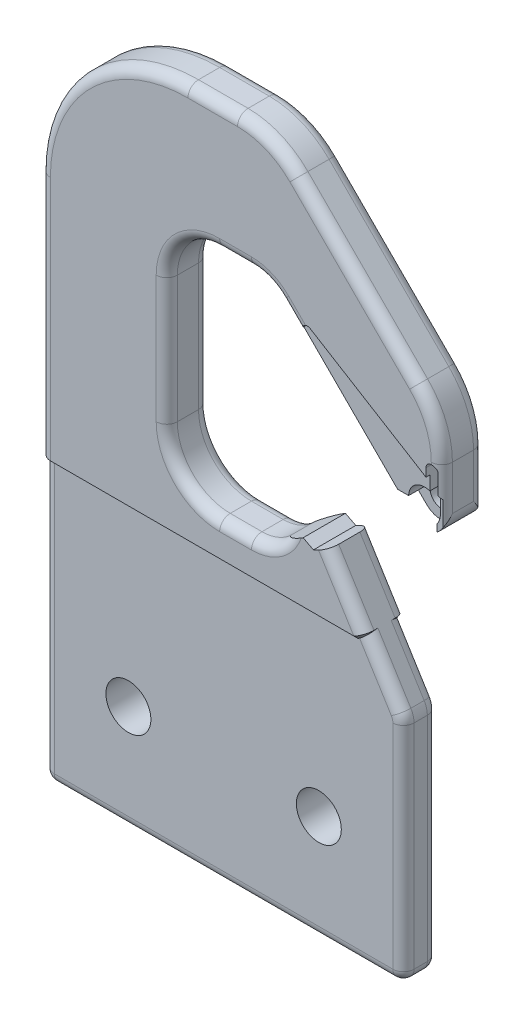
ISO-10303-21;
HEADER;
FILE_DESCRIPTION(('STEP AP214'),'2;1');
FILE_NAME('part.step','',(''),(''),'','','');
FILE_SCHEMA(('AUTOMOTIVE_DESIGN { 1 0 10303 214 1 1 1 1 }'));
ENDSEC;
DATA;
#1=APPLICATION_CONTEXT('core data for automotive mechanical design processes');
#2=APPLICATION_PROTOCOL_DEFINITION('international standard','automotive_design',2000,#1);
#3=PRODUCT_CONTEXT('',#1,'mechanical');
#4=PRODUCT('Part','Part','',(#3));
#5=PRODUCT_RELATED_PRODUCT_CATEGORY('part','',(#4));
#6=PRODUCT_DEFINITION_FORMATION('','',#4);
#7=PRODUCT_DEFINITION_CONTEXT('part definition',#1,'design');
#8=PRODUCT_DEFINITION('design','',#6,#7);
#9=PRODUCT_DEFINITION_SHAPE('','',#8);
#10=(LENGTH_UNIT() NAMED_UNIT(*) SI_UNIT(.MILLI.,.METRE.));
#11=(NAMED_UNIT(*) PLANE_ANGLE_UNIT() SI_UNIT($,.RADIAN.));
#12=(NAMED_UNIT(*) SI_UNIT($,.STERADIAN.) SOLID_ANGLE_UNIT());
#13=UNCERTAINTY_MEASURE_WITH_UNIT(LENGTH_MEASURE(1.E-05),#10,'distance_accuracy_value','');
#14=(GEOMETRIC_REPRESENTATION_CONTEXT(3) GLOBAL_UNCERTAINTY_ASSIGNED_CONTEXT((#13)) GLOBAL_UNIT_ASSIGNED_CONTEXT((#10,
#11,#12)) REPRESENTATION_CONTEXT('',''));
#15=CARTESIAN_POINT('',(0.,0.,0.));
#16=DIRECTION('',(0.,0.,1.));
#17=DIRECTION('',(1.,0.,0.));
#18=AXIS2_PLACEMENT_3D('',#15,#16,#17);
#19=CARTESIAN_POINT('',(0.,177.8,0.));
#20=DIRECTION('',(0.,0.,-1.));
#21=DIRECTION('',(-1.,0.,0.));
#22=AXIS2_PLACEMENT_3D('',#19,#20,#21);
#23=PLANE('',#22);
#24=DIRECTION('',(0.527456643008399,-0.849581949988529,0.));
#25=VECTOR('',#24,1.);
#26=CARTESIAN_POINT('',(96.8298807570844,55.4753251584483,0.));
#27=LINE('',#26,#25);
#28=CARTESIAN_POINT('',(83.629893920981,76.7367325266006,0.));
#29=VERTEX_POINT('',#28);
#30=CARTESIAN_POINT('',(94.2132311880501,59.69,0.));
#31=VERTEX_POINT('',#30);
#32=EDGE_CURVE('E1463',#29,#31,#27,.T.);
#33=ORIENTED_EDGE('',*,*,#32,.T.);
#34=DIRECTION('',(-1.,0.,0.));
#35=VECTOR('',#34,1.);
#36=CARTESIAN_POINT('',(0.,59.69,0.));
#37=LINE('',#36,#35);
#38=CARTESIAN_POINT('',(3.175,59.69,0.));
#39=VERTEX_POINT('',#38);
#40=EDGE_CURVE('E1054',#31,#39,#37,.T.);
#41=ORIENTED_EDGE('',*,*,#40,.T.);
#42=DIRECTION('',(0.,-1.,0.));
#43=VECTOR('',#42,1.);
#44=CARTESIAN_POINT('',(3.175,133.35,0.));
#45=LINE('',#44,#43);
#46=CARTESIAN_POINT('',(3.175,133.35,0.));
#47=VERTEX_POINT('',#46);
#48=EDGE_CURVE('E1441',#39,#47,#45,.F.);
#49=ORIENTED_EDGE('',*,*,#48,.T.);
#50=CARTESIAN_POINT('',(44.45,133.35,0.));
#51=DIRECTION('',(0.,0.,-1.));
#52=DIRECTION('',(-1.,0.,0.));
#53=AXIS2_PLACEMENT_3D('',#50,#51,#52);
#54=CIRCLE('',#53,41.275);
#55=CARTESIAN_POINT('',(44.45,174.625,0.));
#56=VERTEX_POINT('',#55);
#57=EDGE_CURVE('E1438',#47,#56,#54,.T.);
#58=ORIENTED_EDGE('',*,*,#57,.T.);
#59=DIRECTION('',(-1.,0.,0.));
#60=VECTOR('',#59,1.);
#61=CARTESIAN_POINT('',(59.3289755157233,174.625,0.));
#62=LINE('',#61,#60);
#63=CARTESIAN_POINT('',(59.3289755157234,174.625,0.));
#64=VERTEX_POINT('',#63);
#65=EDGE_CURVE('E1435',#56,#64,#62,.F.);
#66=ORIENTED_EDGE('',*,*,#65,.T.);
#67=CARTESIAN_POINT('',(59.3289755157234,152.4,0.));
#68=DIRECTION('',(0.,0.,-1.));
#69=DIRECTION('',(-1.,0.,0.));
#70=AXIS2_PLACEMENT_3D('',#67,#68,#69);
#71=CIRCLE('',#70,22.225);
#72=CARTESIAN_POINT('',(75.0444237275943,168.115448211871,0.));
#73=VERTEX_POINT('',#72);
#74=EDGE_CURVE('E1432',#64,#73,#71,.T.);
#75=ORIENTED_EDGE('',*,*,#74,.T.);
#76=DIRECTION('',(0.707106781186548,-0.707106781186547,0.));
#77=VECTOR('',#76,1.);
#78=CARTESIAN_POINT('',(110.965448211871,132.194423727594,0.));
#79=LINE('',#78,#77);
#80=CARTESIAN_POINT('',(110.965448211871,132.194423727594,0.));
#81=VERTEX_POINT('',#80);
#82=EDGE_CURVE('E1429',#73,#81,#79,.T.);
#83=ORIENTED_EDGE('',*,*,#82,.T.);
#84=CARTESIAN_POINT('',(95.25,116.478975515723,0.));
#85=DIRECTION('',(0.,0.,-1.));
#86=DIRECTION('',(-1.,0.,0.));
#87=AXIS2_PLACEMENT_3D('',#84,#85,#86);
#88=CIRCLE('',#87,22.225);
#89=CARTESIAN_POINT('',(117.475,116.478975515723,0.));
#90=VERTEX_POINT('',#89);
#91=EDGE_CURVE('E1421',#81,#90,#88,.T.);
#92=ORIENTED_EDGE('',*,*,#91,.T.);
#93=DIRECTION('',(0.,1.,0.));
#94=VECTOR('',#93,1.);
#95=CARTESIAN_POINT('',(117.475,106.420895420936,0.));
#96=LINE('',#95,#94);
#97=CARTESIAN_POINT('',(117.475,110.23972588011,0.));
#98=VERTEX_POINT('',#97);
#99=EDGE_CURVE('E1426',#90,#98,#96,.F.);
#100=ORIENTED_EDGE('',*,*,#99,.T.);
#101=DIRECTION('',(0.639309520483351,-0.768949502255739,0.));
#102=VECTOR('',#101,1.);
#103=CARTESIAN_POINT('',(120.65,106.420895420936,0.));
#104=LINE('',#103,#102);
#105=CARTESIAN_POINT('',(116.658208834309,111.222146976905,0.));
#106=VERTEX_POINT('',#105);
#107=EDGE_CURVE('E1625',#106,#98,#104,.T.);
#108=ORIENTED_EDGE('',*,*,#107,.F.);
#109=CARTESIAN_POINT('',(115.437501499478,110.207243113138,0.));
#110=DIRECTION('',(0.,0.,-1.));
#111=DIRECTION('',(-1.,0.,0.));
#112=AXIS2_PLACEMENT_3D('',#109,#110,#111);
#113=CIRCLE('',#112,1.5875);
#114=CARTESIAN_POINT('',(116.265541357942,111.561682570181,0.));
#115=VERTEX_POINT('',#114);
#116=EDGE_CURVE('E1389',#106,#115,#113,.F.);
#117=ORIENTED_EDGE('',*,*,#116,.T.);
#118=DIRECTION('',(0.853190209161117,-0.521599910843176,0.));
#119=VECTOR('',#118,1.);
#120=CARTESIAN_POINT('',(116.490010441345,111.424452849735,0.));
#121=LINE('',#120,#119);
#122=CARTESIAN_POINT('',(81.119347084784,133.048393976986,0.));
#123=VERTEX_POINT('',#122);
#124=EDGE_CURVE('E1630',#123,#115,#121,.T.);
#125=ORIENTED_EDGE('',*,*,#124,.F.);
#126=CARTESIAN_POINT('',(80.2913072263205,131.693954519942,0.));
#127=DIRECTION('',(0.,0.,-1.));
#128=DIRECTION('',(-1.,0.,0.));
#129=AXIS2_PLACEMENT_3D('',#126,#127,#128);
#130=CIRCLE('',#129,1.5875);
#131=CARTESIAN_POINT('',(79.7605424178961,133.190097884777,0.));
#132=VERTEX_POINT('',#131);
#133=EDGE_CURVE('E1392',#123,#132,#130,.F.);
#134=ORIENTED_EDGE('',*,*,#133,.T.);
#135=DIRECTION('',(-0.707106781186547,0.707106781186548,0.));
#136=VECTOR('',#135,1.);
#137=CARTESIAN_POINT('',(74.7253201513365,138.225320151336,0.));
#138=LINE('',#137,#136);
#139=CARTESIAN_POINT('',(74.7253201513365,138.225320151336,0.));
#140=VERTEX_POINT('',#139);
#141=EDGE_CURVE('E1443',#132,#140,#138,.T.);
#142=ORIENTED_EDGE('',*,*,#141,.T.);
#143=CARTESIAN_POINT('',(63.5,127.,0.));
#144=DIRECTION('',(0.,0.,-1.));
#145=DIRECTION('',(-1.,0.,0.));
#146=AXIS2_PLACEMENT_3D('',#143,#144,#145);
#147=CIRCLE('',#146,15.875);
#148=CARTESIAN_POINT('',(63.5,142.875,0.));
#149=VERTEX_POINT('',#148);
#150=EDGE_CURVE('E1446',#140,#149,#147,.F.);
#151=ORIENTED_EDGE('',*,*,#150,.T.);
#152=DIRECTION('',(-1.,0.,0.));
#153=VECTOR('',#152,1.);
#154=CARTESIAN_POINT('',(53.975,142.875,0.));
#155=LINE('',#154,#153);
#156=CARTESIAN_POINT('',(53.975,142.875,0.));
#157=VERTEX_POINT('',#156);
#158=EDGE_CURVE('E1449',#149,#157,#155,.T.);
#159=ORIENTED_EDGE('',*,*,#158,.T.);
#160=CARTESIAN_POINT('',(53.975,123.825,0.));
#161=DIRECTION('',(0.,0.,-1.));
#162=DIRECTION('',(-1.,0.,0.));
#163=AXIS2_PLACEMENT_3D('',#160,#161,#162);
#164=CIRCLE('',#163,19.05);
#165=CARTESIAN_POINT('',(34.925,123.825,0.));
#166=VERTEX_POINT('',#165);
#167=EDGE_CURVE('E1452',#157,#166,#164,.F.);
#168=ORIENTED_EDGE('',*,*,#167,.T.);
#169=DIRECTION('',(0.,-1.,0.));
#170=VECTOR('',#169,1.);
#171=CARTESIAN_POINT('',(34.925,85.725,0.));
#172=LINE('',#171,#170);
#173=CARTESIAN_POINT('',(34.925,85.725,0.));
#174=VERTEX_POINT('',#173);
#175=EDGE_CURVE('E1455',#166,#174,#172,.T.);
#176=ORIENTED_EDGE('',*,*,#175,.T.);
#177=CARTESIAN_POINT('',(53.975,85.725,0.));
#178=DIRECTION('',(0.,0.,-1.));
#179=DIRECTION('',(-1.,0.,0.));
#180=AXIS2_PLACEMENT_3D('',#177,#178,#179);
#181=CIRCLE('',#180,19.05);
#182=CARTESIAN_POINT('',(53.975,66.675,0.));
#183=VERTEX_POINT('',#182);
#184=EDGE_CURVE('E532',#174,#183,#181,.F.);
#185=ORIENTED_EDGE('',*,*,#184,.T.);
#186=DIRECTION('',(1.,0.,0.));
#187=VECTOR('',#186,1.);
#188=CARTESIAN_POINT('',(63.5,66.675,0.));
#189=LINE('',#188,#187);
#190=CARTESIAN_POINT('',(63.5,66.675,0.));
#191=VERTEX_POINT('',#190);
#192=EDGE_CURVE('E1459',#183,#191,#189,.T.);
#193=ORIENTED_EDGE('',*,*,#192,.T.);
#194=CARTESIAN_POINT('',(63.5,82.55,0.));
#195=DIRECTION('',(0.,0.,-1.));
#196=DIRECTION('',(-1.,0.,0.));
#197=AXIS2_PLACEMENT_3D('',#194,#195,#196);
#198=CIRCLE('',#197,15.875);
#199=CARTESIAN_POINT('',(78.4798472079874,77.2945454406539,0.));
#200=VERTEX_POINT('',#199);
#201=EDGE_CURVE('E1461',#191,#200,#198,.F.);
#202=ORIENTED_EDGE('',*,*,#201,.T.);
#203=DIRECTION('',(0.849581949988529,0.527456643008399,0.));
#204=VECTOR('',#203,1.);
#205=CARTESIAN_POINT('',(72.4802561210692,73.5697438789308,0.));
#206=LINE('',#205,#204);
#207=CARTESIAN_POINT('',(79.0132298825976,77.6256921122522,0.));
#208=VERTEX_POINT('',#207);
#209=EDGE_CURVE('E1324',#200,#208,#206,.T.);
#210=ORIENTED_EDGE('',*,*,#209,.T.);
#211=DIRECTION('',(0.888819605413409,-0.458257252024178,0.));
#212=VECTOR('',#211,1.);
#213=CARTESIAN_POINT('',(82.1200884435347,76.0238592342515,0.));
#214=LINE('',#213,#212);
#215=CARTESIAN_POINT('',(82.1200884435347,76.0238592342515,0.));
#216=VERTEX_POINT('',#215);
#217=EDGE_CURVE('E1306',#208,#216,#214,.T.);
#218=ORIENTED_EDGE('',*,*,#217,.T.);
#219=DIRECTION('',(0.90426955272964,0.426962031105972,0.));
#220=VECTOR('',#219,1.);
#221=CARTESIAN_POINT('',(86.5198644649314,78.1012677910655,0.));
#222=LINE('',#221,#220);
#223=EDGE_CURVE('E1309',#216,#29,#222,.T.);
#224=ORIENTED_EDGE('',*,*,#223,.T.);
#225=EDGE_LOOP('',(#33,#41,#49,#58,#66,#75,#83,#92,#100,#108,#117,#125,#134,#142,#151,#159,#168,
#176,#185,#193,#202,#210,#218,#224));
#226=FACE_BOUND('',#225,.T.);
#227=ADVANCED_FACE('F34',(#226),#23,.T.);
#228=CARTESIAN_POINT('',(0.,177.8,12.7));
#229=DIRECTION('',(0.,0.,-1.));
#230=DIRECTION('',(-1.,0.,0.));
#231=AXIS2_PLACEMENT_3D('',#228,#229,#230);
#232=PLANE('',#231);
#233=DIRECTION('',(0.,-1.,0.));
#234=VECTOR('',#233,1.);
#235=CARTESIAN_POINT('',(3.175,177.8,12.7));
#236=LINE('',#235,#234);
#237=CARTESIAN_POINT('',(3.175,133.35,12.7));
#238=VERTEX_POINT('',#237);
#239=CARTESIAN_POINT('',(3.175,59.69,12.7));
#240=VERTEX_POINT('',#239);
#241=EDGE_CURVE('E937',#238,#240,#236,.T.);
#242=ORIENTED_EDGE('',*,*,#241,.T.);
#243=DIRECTION('',(1.,0.,0.));
#244=VECTOR('',#243,1.);
#245=CARTESIAN_POINT('',(95.7901713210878,59.69,12.7));
#246=LINE('',#245,#244);
#247=CARTESIAN_POINT('',(94.2132311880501,59.69,12.7));
#248=VERTEX_POINT('',#247);
#249=EDGE_CURVE('E927',#240,#248,#246,.T.);
#250=ORIENTED_EDGE('',*,*,#249,.T.);
#251=DIRECTION('',(0.527456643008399,-0.849581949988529,0.));
#252=VECTOR('',#251,1.);
#253=CARTESIAN_POINT('',(15.0749452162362,187.159167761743,12.7));
#254=LINE('',#253,#252);
#255=CARTESIAN_POINT('',(83.629893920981,76.7367325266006,12.7));
#256=VERTEX_POINT('',#255);
#257=EDGE_CURVE('E1064',#248,#256,#254,.F.);
#258=ORIENTED_EDGE('',*,*,#257,.T.);
#259=DIRECTION('',(0.90426955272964,0.426962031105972,0.));
#260=VECTOR('',#259,1.);
#261=CARTESIAN_POINT('',(86.5198644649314,78.1012677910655,12.7));
#262=LINE('',#261,#260);
#263=CARTESIAN_POINT('',(82.1200884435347,76.0238592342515,12.7));
#264=VERTEX_POINT('',#263);
#265=EDGE_CURVE('E1310',#264,#256,#262,.T.);
#266=ORIENTED_EDGE('',*,*,#265,.F.);
#267=DIRECTION('',(0.888819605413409,-0.458257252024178,0.));
#268=VECTOR('',#267,1.);
#269=CARTESIAN_POINT('',(82.1200884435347,76.0238592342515,12.7));
#270=LINE('',#269,#268);
#271=CARTESIAN_POINT('',(79.0132298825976,77.6256921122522,12.7));
#272=VERTEX_POINT('',#271);
#273=EDGE_CURVE('E1314',#272,#264,#270,.T.);
#274=ORIENTED_EDGE('',*,*,#273,.F.);
#275=DIRECTION('',(0.849581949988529,0.527456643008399,0.));
#276=VECTOR('',#275,1.);
#277=CARTESIAN_POINT('',(72.4802561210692,73.5697438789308,12.7));
#278=LINE('',#277,#276);
#279=CARTESIAN_POINT('',(78.4798472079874,77.2945454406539,12.7));
#280=VERTEX_POINT('',#279);
#281=EDGE_CURVE('E1146',#280,#272,#278,.T.);
#282=ORIENTED_EDGE('',*,*,#281,.F.);
#283=CARTESIAN_POINT('',(63.5,82.55,12.7));
#284=DIRECTION('',(0.,0.,-1.));
#285=DIRECTION('',(-1.,0.,0.));
#286=AXIS2_PLACEMENT_3D('',#283,#284,#285);
#287=CIRCLE('',#286,15.875);
#288=CARTESIAN_POINT('',(63.5,66.675,12.7));
#289=VERTEX_POINT('',#288);
#290=EDGE_CURVE('E1067',#280,#289,#287,.T.);
#291=ORIENTED_EDGE('',*,*,#290,.T.);
#292=DIRECTION('',(1.,0.,0.));
#293=VECTOR('',#292,1.);
#294=CARTESIAN_POINT('',(0.,66.675,12.7));
#295=LINE('',#294,#293);
#296=CARTESIAN_POINT('',(53.975,66.675,12.7));
#297=VERTEX_POINT('',#296);
#298=EDGE_CURVE('E1134',#289,#297,#295,.F.);
#299=ORIENTED_EDGE('',*,*,#298,.T.);
#300=CARTESIAN_POINT('',(53.975,85.725,12.7));
#301=DIRECTION('',(0.,0.,-1.));
#302=DIRECTION('',(-1.,0.,0.));
#303=AXIS2_PLACEMENT_3D('',#300,#301,#302);
#304=CIRCLE('',#303,19.05);
#305=CARTESIAN_POINT('',(34.925,85.725,12.7));
#306=VERTEX_POINT('',#305);
#307=EDGE_CURVE('E1132',#297,#306,#304,.T.);
#308=ORIENTED_EDGE('',*,*,#307,.T.);
#309=DIRECTION('',(0.,-1.,0.));
#310=VECTOR('',#309,1.);
#311=CARTESIAN_POINT('',(34.925,177.8,12.7));
#312=LINE('',#311,#310);
#313=CARTESIAN_POINT('',(34.925,123.825,12.7));
#314=VERTEX_POINT('',#313);
#315=EDGE_CURVE('E1129',#306,#314,#312,.F.);
#316=ORIENTED_EDGE('',*,*,#315,.T.);
#317=CARTESIAN_POINT('',(53.975,123.825,12.7));
#318=DIRECTION('',(0.,0.,-1.));
#319=DIRECTION('',(-1.,0.,0.));
#320=AXIS2_PLACEMENT_3D('',#317,#318,#319);
#321=CIRCLE('',#320,19.05);
#322=CARTESIAN_POINT('',(53.975,142.875,12.7));
#323=VERTEX_POINT('',#322);
#324=EDGE_CURVE('E1126',#314,#323,#321,.T.);
#325=ORIENTED_EDGE('',*,*,#324,.T.);
#326=DIRECTION('',(-1.,0.,0.));
#327=VECTOR('',#326,1.);
#328=CARTESIAN_POINT('',(0.,142.875,12.7));
#329=LINE('',#328,#327);
#330=CARTESIAN_POINT('',(63.5,142.875,12.7));
#331=VERTEX_POINT('',#330);
#332=EDGE_CURVE('E1123',#323,#331,#329,.F.);
#333=ORIENTED_EDGE('',*,*,#332,.T.);
#334=CARTESIAN_POINT('',(63.5,127.,12.7));
#335=DIRECTION('',(0.,0.,-1.));
#336=DIRECTION('',(-1.,0.,0.));
#337=AXIS2_PLACEMENT_3D('',#334,#335,#336);
#338=CIRCLE('',#337,15.875);
#339=CARTESIAN_POINT('',(74.7253201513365,138.225320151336,12.7));
#340=VERTEX_POINT('',#339);
#341=EDGE_CURVE('E1116',#331,#340,#338,.T.);
#342=ORIENTED_EDGE('',*,*,#341,.T.);
#343=DIRECTION('',(-0.707106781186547,0.707106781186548,0.));
#344=VECTOR('',#343,1.);
#345=CARTESIAN_POINT('',(17.5753201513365,195.375320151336,12.7));
#346=LINE('',#345,#344);
#347=CARTESIAN_POINT('',(79.7605424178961,133.190097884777,12.7));
#348=VERTEX_POINT('',#347);
#349=EDGE_CURVE('E1112',#340,#348,#346,.F.);
#350=ORIENTED_EDGE('',*,*,#349,.T.);
#351=CARTESIAN_POINT('',(80.2913072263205,131.693954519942,12.7));
#352=DIRECTION('',(0.,0.,-1.));
#353=DIRECTION('',(-1.,0.,0.));
#354=AXIS2_PLACEMENT_3D('',#351,#352,#353);
#355=CIRCLE('',#354,1.5875);
#356=CARTESIAN_POINT('',(81.119347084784,133.048393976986,12.7));
#357=VERTEX_POINT('',#356);
#358=EDGE_CURVE('E1395',#348,#357,#355,.T.);
#359=ORIENTED_EDGE('',*,*,#358,.T.);
#360=DIRECTION('',(-0.853190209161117,0.521599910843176,0.));
#361=VECTOR('',#360,1.);
#362=CARTESIAN_POINT('',(79.7950080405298,133.858031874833,12.7));
#363=LINE('',#362,#361);
#364=CARTESIAN_POINT('',(115.8875,111.792799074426,12.7));
#365=VERTEX_POINT('',#364);
#366=EDGE_CURVE('E1285',#365,#357,#363,.T.);
#367=ORIENTED_EDGE('',*,*,#366,.F.);
#368=DIRECTION('',(0.,-1.,0.));
#369=VECTOR('',#368,1.);
#370=CARTESIAN_POINT('',(115.8875,103.140768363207,12.7));
#371=LINE('',#370,#369);
#372=CARTESIAN_POINT('',(115.8875,114.253268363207,12.7));
#373=VERTEX_POINT('',#372);
#374=EDGE_CURVE('E1657',#373,#365,#371,.T.);
#375=ORIENTED_EDGE('',*,*,#374,.F.);
#376=CARTESIAN_POINT('',(117.475,114.253268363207,12.7));
#377=DIRECTION('',(0.,0.,-1.));
#378=DIRECTION('',(-1.,0.,0.));
#379=AXIS2_PLACEMENT_3D('',#376,#377,#378);
#380=CIRCLE('',#379,1.5875);
#381=CARTESIAN_POINT('',(117.475,115.840768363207,12.7));
#382=VERTEX_POINT('',#381);
#383=EDGE_CURVE('E1419',#373,#382,#380,.T.);
#384=ORIENTED_EDGE('',*,*,#383,.T.);
#385=DIRECTION('',(0.,1.,0.));
#386=VECTOR('',#385,1.);
#387=CARTESIAN_POINT('',(117.475,177.8,12.7));
#388=LINE('',#387,#386);
#389=CARTESIAN_POINT('',(117.475,116.478975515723,12.7));
#390=VERTEX_POINT('',#389);
#391=EDGE_CURVE('E1105',#382,#390,#388,.T.);
#392=ORIENTED_EDGE('',*,*,#391,.T.);
#393=CARTESIAN_POINT('',(95.25,116.478975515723,12.7));
#394=DIRECTION('',(0.,0.,-1.));
#395=DIRECTION('',(-1.,0.,0.));
#396=AXIS2_PLACEMENT_3D('',#393,#394,#395);
#397=CIRCLE('',#396,22.225);
#398=CARTESIAN_POINT('',(110.965448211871,132.194423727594,12.7));
#399=VERTEX_POINT('',#398);
#400=EDGE_CURVE('E1113',#390,#399,#397,.F.);
#401=ORIENTED_EDGE('',*,*,#400,.T.);
#402=DIRECTION('',(0.707106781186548,-0.707106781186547,0.));
#403=VECTOR('',#402,1.);
#404=CARTESIAN_POINT('',(32.6799359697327,210.479935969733,12.7));
#405=LINE('',#404,#403);
#406=CARTESIAN_POINT('',(75.0444237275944,168.115448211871,12.7));
#407=VERTEX_POINT('',#406);
#408=EDGE_CURVE('E821',#399,#407,#405,.F.);
#409=ORIENTED_EDGE('',*,*,#408,.T.);
#410=CARTESIAN_POINT('',(59.3289755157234,152.4,12.7));
#411=DIRECTION('',(0.,0.,-1.));
#412=DIRECTION('',(-1.,0.,0.));
#413=AXIS2_PLACEMENT_3D('',#410,#411,#412);
#414=CIRCLE('',#413,22.225);
#415=CARTESIAN_POINT('',(59.3289755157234,174.625,12.7));
#416=VERTEX_POINT('',#415);
#417=EDGE_CURVE('E1870',#407,#416,#414,.F.);
#418=ORIENTED_EDGE('',*,*,#417,.T.);
#419=DIRECTION('',(-1.,0.,0.));
#420=VECTOR('',#419,1.);
#421=CARTESIAN_POINT('',(0.,174.625,12.7));
#422=LINE('',#421,#420);
#423=CARTESIAN_POINT('',(44.45,174.625,12.7));
#424=VERTEX_POINT('',#423);
#425=EDGE_CURVE('E1873',#416,#424,#422,.T.);
#426=ORIENTED_EDGE('',*,*,#425,.T.);
#427=CARTESIAN_POINT('',(44.45,133.35,12.7));
#428=DIRECTION('',(0.,0.,-1.));
#429=DIRECTION('',(-1.,0.,0.));
#430=AXIS2_PLACEMENT_3D('',#427,#428,#429);
#431=CIRCLE('',#430,41.275);
#432=EDGE_CURVE('E945',#424,#238,#431,.F.);
#433=ORIENTED_EDGE('',*,*,#432,.T.);
#434=EDGE_LOOP('',(#242,#250,#258,#266,#274,#282,#291,#299,#308,#316,#325,#333,#342,#350,#359,
#367,#375,#384,#392,#401,#409,#418,#426,#433));
#435=FACE_BOUND('',#434,.T.);
#436=ADVANCED_FACE('F320',(#435),#232,.F.);
#437=CARTESIAN_POINT('',(114.3,103.140768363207,6.477));
#438=DIRECTION('',(0.,0.,1.));
#439=DIRECTION('',(1.,0.,0.));
#440=AXIS2_PLACEMENT_3D('',#437,#438,#439);
#441=CYLINDRICAL_SURFACE('',#440,4.7625);
#442=CARTESIAN_POINT('',(114.3,103.140768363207,6.477));
#443=DIRECTION('',(0.,0.,1.));
#444=DIRECTION('',(1.,0.,0.));
#445=AXIS2_PLACEMENT_3D('',#442,#443,#444);
#446=CIRCLE('',#445,4.7625);
#447=CARTESIAN_POINT('',(118.116722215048,100.292253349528,6.477));
#448=VERTEX_POINT('',#447);
#449=CARTESIAN_POINT('',(119.0625,103.140768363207,6.477));
#450=VERTEX_POINT('',#449);
#451=EDGE_CURVE('E1300',#448,#450,#446,.T.);
#452=ORIENTED_EDGE('',*,*,#451,.F.);
#453=DIRECTION('',(0.,0.,1.));
#454=VECTOR('',#453,1.);
#455=CARTESIAN_POINT('',(118.116722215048,100.292253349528,6.477));
#456=LINE('',#455,#454);
#457=CARTESIAN_POINT('',(118.116722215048,100.292253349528,11.557));
#458=VERTEX_POINT('',#457);
#459=EDGE_CURVE('E1673',#448,#458,#456,.T.);
#460=ORIENTED_EDGE('',*,*,#459,.T.);
#461=CARTESIAN_POINT('',(114.3,103.140768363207,11.557));
#462=DIRECTION('',(0.,0.,-1.));
#463=DIRECTION('',(-1.,0.,0.));
#464=AXIS2_PLACEMENT_3D('',#461,#462,#463);
#465=CIRCLE('',#464,4.7625);
#466=CARTESIAN_POINT('',(119.0625,103.140768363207,11.557));
#467=VERTEX_POINT('',#466);
#468=EDGE_CURVE('E1297',#458,#467,#465,.F.);
#469=ORIENTED_EDGE('',*,*,#468,.T.);
#470=DIRECTION('',(0.,0.,1.));
#471=VECTOR('',#470,1.);
#472=CARTESIAN_POINT('',(119.0625,103.140768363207,6.477));
#473=LINE('',#472,#471);
#474=EDGE_CURVE('E1651',#450,#467,#473,.T.);
#475=ORIENTED_EDGE('',*,*,#474,.F.);
#476=EDGE_LOOP('',(#452,#460,#469,#475));
#477=FACE_BOUND('',#476,.T.);
#478=ADVANCED_FACE('F326',(#477),#441,.F.);
#479=CARTESIAN_POINT('',(77.7635303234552,130.696981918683,11.557));
#480=DIRECTION('',(0.,0.,-1.));
#481=DIRECTION('',(-1.,0.,0.));
#482=AXIS2_PLACEMENT_3D('',#479,#480,#481);
#483=PLANE('',#482);
#484=CARTESIAN_POINT('',(114.3,103.140768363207,11.557));
#485=DIRECTION('',(0.,0.,-1.));
#486=DIRECTION('',(-1.,0.,0.));
#487=AXIS2_PLACEMENT_3D('',#484,#485,#486);
#488=CIRCLE('',#487,6.35);
#489=CARTESIAN_POINT('',(118.001933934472,97.9814869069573,11.557));
#490=VERTEX_POINT('',#489);
#491=CARTESIAN_POINT('',(119.914590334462,100.174478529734,11.557));
#492=VERTEX_POINT('',#491);
#493=EDGE_CURVE('E1282',#490,#492,#488,.F.);
#494=ORIENTED_EDGE('',*,*,#493,.T.);
#495=DIRECTION('',(0.,1.,0.));
#496=VECTOR('',#495,1.);
#497=CARTESIAN_POINT('',(119.914590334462,100.174478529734,11.557));
#498=LINE('',#497,#496);
#499=CARTESIAN_POINT('',(119.914590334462,107.305432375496,11.557));
#500=VERTEX_POINT('',#499);
#501=EDGE_CURVE('E1066',#492,#500,#498,.T.);
#502=ORIENTED_EDGE('',*,*,#501,.T.);
#503=DIRECTION('',(-0.639309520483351,0.768949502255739,0.));
#504=VECTOR('',#503,1.);
#505=CARTESIAN_POINT('',(116.490010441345,111.424452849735,11.557));
#506=LINE('',#505,#504);
#507=CARTESIAN_POINT('',(119.0625,108.330310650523,11.557));
#508=VERTEX_POINT('',#507);
#509=EDGE_CURVE('E1279',#500,#508,#506,.T.);
#510=ORIENTED_EDGE('',*,*,#509,.T.);
#511=DIRECTION('',(0.,-1.,0.));
#512=VECTOR('',#511,1.);
#513=CARTESIAN_POINT('',(119.0625,130.696981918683,11.557));
#514=LINE('',#513,#512);
#515=EDGE_CURVE('E1646',#508,#467,#514,.T.);
#516=ORIENTED_EDGE('',*,*,#515,.T.);
#517=ORIENTED_EDGE('',*,*,#468,.F.);
#518=DIRECTION('',(-0.0496142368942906,-0.998768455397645,0.));
#519=VECTOR('',#518,1.);
#520=CARTESIAN_POINT('',(119.524039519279,128.622511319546,11.557));
#521=LINE('',#520,#519);
#522=EDGE_CURVE('E1405',#458,#490,#521,.T.);
#523=ORIENTED_EDGE('',*,*,#522,.T.);
#524=EDGE_LOOP('',(#494,#502,#510,#516,#517,#523));
#525=FACE_BOUND('',#524,.T.);
#526=ADVANCED_FACE('F1276',(#525),#483,.F.);
#527=CARTESIAN_POINT('',(114.3,103.140768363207,12.7));
#528=DIRECTION('',(0.,0.,1.));
#529=DIRECTION('',(1.,0.,0.));
#530=AXIS2_PLACEMENT_3D('',#527,#528,#529);
#531=CYLINDRICAL_SURFACE('',#530,3.3782);
#532=CARTESIAN_POINT('',(114.3,103.140768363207,1.143));
#533=DIRECTION('',(0.,0.,1.));
#534=DIRECTION('',(1.,0.,0.));
#535=AXIS2_PLACEMENT_3D('',#532,#533,#534);
#536=CIRCLE('',#535,3.3782);
#537=CARTESIAN_POINT('',(117.6782,103.140768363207,1.143));
#538=VERTEX_POINT('',#537);
#539=EDGE_CURVE('E1291',#538,#538,#536,.F.);
#540=ORIENTED_EDGE('',*,*,#539,.T.);
#541=EDGE_LOOP('',(#540));
#542=FACE_BOUND('',#541,.T.);
#543=CARTESIAN_POINT('',(114.3,103.140768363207,6.477));
#544=DIRECTION('',(0.,0.,1.));
#545=DIRECTION('',(1.,0.,0.));
#546=AXIS2_PLACEMENT_3D('',#543,#544,#545);
#547=CIRCLE('',#546,3.3782);
#548=CARTESIAN_POINT('',(117.6782,103.140768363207,6.477));
#549=VERTEX_POINT('',#548);
#550=EDGE_CURVE('E1305',#549,#549,#547,.F.);
#551=ORIENTED_EDGE('',*,*,#550,.F.);
#552=EDGE_LOOP('',(#551));
#553=FACE_BOUND('',#552,.T.);
#554=ADVANCED_FACE('F341',(#542,#553),#531,.F.);
#555=CARTESIAN_POINT('',(120.65,0.,12.7));
#556=DIRECTION('',(-1.,0.,0.));
#557=DIRECTION('',(0.,0.,1.));
#558=AXIS2_PLACEMENT_3D('',#555,#556,#557);
#559=PLANE('',#558);
#560=DIRECTION('',(0.,0.,1.));
#561=VECTOR('',#560,1.);
#562=CARTESIAN_POINT('',(120.65,103.140768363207,12.7));
#563=LINE('',#562,#561);
#564=CARTESIAN_POINT('',(120.65,103.140768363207,9.525));
#565=VERTEX_POINT('',#564);
#566=CARTESIAN_POINT('',(120.65,103.140768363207,3.175));
#567=VERTEX_POINT('',#566);
#568=EDGE_CURVE('E1352',#565,#567,#563,.F.);
#569=ORIENTED_EDGE('',*,*,#568,.T.);
#570=DIRECTION('',(0.,1.,0.));
#571=VECTOR('',#570,1.);
#572=CARTESIAN_POINT('',(120.65,116.478975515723,3.175));
#573=LINE('',#572,#571);
#574=CARTESIAN_POINT('',(120.65,116.478975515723,3.175));
#575=VERTEX_POINT('',#574);
#576=EDGE_CURVE('E1819',#567,#575,#573,.T.);
#577=ORIENTED_EDGE('',*,*,#576,.T.);
#578=DIRECTION('',(0.,0.,1.));
#579=VECTOR('',#578,1.);
#580=CARTESIAN_POINT('',(120.65,116.478975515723,12.7));
#581=LINE('',#580,#579);
#582=CARTESIAN_POINT('',(120.65,116.478975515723,9.525));
#583=VERTEX_POINT('',#582);
#584=EDGE_CURVE('E1407',#575,#583,#581,.T.);
#585=ORIENTED_EDGE('',*,*,#584,.T.);
#586=DIRECTION('',(0.,1.,0.));
#587=VECTOR('',#586,1.);
#588=CARTESIAN_POINT('',(120.65,0.,9.525));
#589=LINE('',#588,#587);
#590=EDGE_CURVE('E1818',#583,#565,#589,.F.);
#591=ORIENTED_EDGE('',*,*,#590,.T.);
#592=EDGE_LOOP('',(#569,#577,#585,#591));
#593=FACE_BOUND('',#592,.T.);
#594=ADVANCED_FACE('F338',(#593),#559,.F.);
#595=CARTESIAN_POINT('',(0.,0.,12.7));
#596=DIRECTION('',(1.,0.,0.));
#597=DIRECTION('',(0.,0.,-1.));
#598=AXIS2_PLACEMENT_3D('',#595,#596,#597);
#599=PLANE('',#598);
#600=DIRECTION('',(0.,-1.,0.));
#601=VECTOR('',#600,1.);
#602=CARTESIAN_POINT('',(0.,57.15,3.175));
#603=LINE('',#602,#601);
#604=CARTESIAN_POINT('',(0.,133.35,3.175));
#605=VERTEX_POINT('',#604);
#606=CARTESIAN_POINT('',(0.,59.69,3.175));
#607=VERTEX_POINT('',#606);
#608=EDGE_CURVE('E1024',#605,#607,#603,.T.);
#609=ORIENTED_EDGE('',*,*,#608,.T.);
#610=DIRECTION('',(0.,0.,1.));
#611=VECTOR('',#610,1.);
#612=CARTESIAN_POINT('',(0.,59.69,4.35609999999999));
#613=LINE('',#612,#611);
#614=CARTESIAN_POINT('',(0.,59.69,4.35609999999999));
#615=VERTEX_POINT('',#614);
#616=EDGE_CURVE('E725',#607,#615,#613,.T.);
#617=ORIENTED_EDGE('',*,*,#616,.T.);
#618=DIRECTION('',(0.,1.,0.));
#619=VECTOR('',#618,1.);
#620=CARTESIAN_POINT('',(0.,0.,4.35609999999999));
#621=LINE('',#620,#619);
#622=CARTESIAN_POINT('',(0.,-22.225,4.35609999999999));
#623=VERTEX_POINT('',#622);
#624=EDGE_CURVE('E664',#615,#623,#621,.F.);
#625=ORIENTED_EDGE('',*,*,#624,.T.);
#626=DIRECTION('',(0.,0.,1.));
#627=VECTOR('',#626,1.);
#628=CARTESIAN_POINT('',(0.,-22.225,9.525));
#629=LINE('',#628,#627);
#630=CARTESIAN_POINT('',(0.,-22.225,8.3439));
#631=VERTEX_POINT('',#630);
#632=EDGE_CURVE('E618',#623,#631,#629,.T.);
#633=ORIENTED_EDGE('',*,*,#632,.T.);
#634=DIRECTION('',(0.,1.,0.));
#635=VECTOR('',#634,1.);
#636=CARTESIAN_POINT('',(0.,0.,8.3439));
#637=LINE('',#636,#635);
#638=CARTESIAN_POINT('',(0.,59.69,8.3439));
#639=VERTEX_POINT('',#638);
#640=EDGE_CURVE('E661',#631,#639,#637,.T.);
#641=ORIENTED_EDGE('',*,*,#640,.T.);
#642=DIRECTION('',(0.,0.,1.));
#643=VECTOR('',#642,1.);
#644=CARTESIAN_POINT('',(0.,59.69,9.525));
#645=LINE('',#644,#643);
#646=CARTESIAN_POINT('',(0.,59.69,9.525));
#647=VERTEX_POINT('',#646);
#648=EDGE_CURVE('E688',#639,#647,#645,.T.);
#649=ORIENTED_EDGE('',*,*,#648,.T.);
#650=DIRECTION('',(0.,-1.,0.));
#651=VECTOR('',#650,1.);
#652=CARTESIAN_POINT('',(0.,0.,9.525));
#653=LINE('',#652,#651);
#654=CARTESIAN_POINT('',(0.,133.35,9.525));
#655=VERTEX_POINT('',#654);
#656=EDGE_CURVE('E939',#647,#655,#653,.F.);
#657=ORIENTED_EDGE('',*,*,#656,.T.);
#658=DIRECTION('',(0.,0.,-1.));
#659=VECTOR('',#658,1.);
#660=CARTESIAN_POINT('',(0.,133.35,12.7));
#661=LINE('',#660,#659);
#662=EDGE_CURVE('E1027',#655,#605,#661,.T.);
#663=ORIENTED_EDGE('',*,*,#662,.T.);
#664=EDGE_LOOP('',(#609,#617,#625,#633,#641,#649,#657,#663));
#665=FACE_BOUND('',#664,.T.);
#666=ADVANCED_FACE('F336',(#665),#599,.F.);
#667=CARTESIAN_POINT('',(0.,177.8,12.7));
#668=DIRECTION('',(0.,-1.,0.));
#669=DIRECTION('',(0.,0.,-1.));
#670=AXIS2_PLACEMENT_3D('',#667,#668,#669);
#671=PLANE('',#670);
#672=DIRECTION('',(0.,0.,-1.));
#673=VECTOR('',#672,1.);
#674=CARTESIAN_POINT('',(59.3289755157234,177.8,12.7));
#675=LINE('',#674,#673);
#676=CARTESIAN_POINT('',(59.3289755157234,177.8,9.525));
#677=VERTEX_POINT('',#676);
#678=CARTESIAN_POINT('',(59.3289755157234,177.8,3.175));
#679=VERTEX_POINT('',#678);
#680=EDGE_CURVE('E811',#677,#679,#675,.T.);
#681=ORIENTED_EDGE('',*,*,#680,.T.);
#682=DIRECTION('',(-1.,0.,0.));
#683=VECTOR('',#682,1.);
#684=CARTESIAN_POINT('',(44.45,177.8,3.175));
#685=LINE('',#684,#683);
#686=CARTESIAN_POINT('',(44.45,177.8,3.175));
#687=VERTEX_POINT('',#686);
#688=EDGE_CURVE('E1857',#679,#687,#685,.T.);
#689=ORIENTED_EDGE('',*,*,#688,.T.);
#690=DIRECTION('',(0.,0.,-1.));
#691=VECTOR('',#690,1.);
#692=CARTESIAN_POINT('',(44.45,177.8,12.7));
#693=LINE('',#692,#691);
#694=CARTESIAN_POINT('',(44.45,177.8,9.525));
#695=VERTEX_POINT('',#694);
#696=EDGE_CURVE('E1334',#687,#695,#693,.F.);
#697=ORIENTED_EDGE('',*,*,#696,.T.);
#698=DIRECTION('',(-1.,0.,0.));
#699=VECTOR('',#698,1.);
#700=CARTESIAN_POINT('',(0.,177.8,9.525));
#701=LINE('',#700,#699);
#702=EDGE_CURVE('E1855',#695,#677,#701,.F.);
#703=ORIENTED_EDGE('',*,*,#702,.T.);
#704=EDGE_LOOP('',(#681,#689,#697,#703));
#705=FACE_BOUND('',#704,.T.);
#706=ADVANCED_FACE('F332',(#705),#671,.F.);
#707=CARTESIAN_POINT('',(44.45,133.35,12.7));
#708=DIRECTION('',(0.,0.,-1.));
#709=DIRECTION('',(-1.,0.,0.));
#710=AXIS2_PLACEMENT_3D('',#707,#708,#709);
#711=CYLINDRICAL_SURFACE('',#710,44.45);
#712=ORIENTED_EDGE('',*,*,#696,.F.);
#713=CARTESIAN_POINT('',(44.45,133.35,3.175));
#714=DIRECTION('',(0.,0.,-1.));
#715=DIRECTION('',(-1.,0.,0.));
#716=AXIS2_PLACEMENT_3D('',#713,#714,#715);
#717=CIRCLE('',#716,44.45);
#718=EDGE_CURVE('E1853',#687,#605,#717,.F.);
#719=ORIENTED_EDGE('',*,*,#718,.T.);
#720=ORIENTED_EDGE('',*,*,#662,.F.);
#721=CARTESIAN_POINT('',(44.45,133.35,9.525));
#722=DIRECTION('',(0.,0.,-1.));
#723=DIRECTION('',(-1.,0.,0.));
#724=AXIS2_PLACEMENT_3D('',#721,#722,#723);
#725=CIRCLE('',#724,44.45);
#726=EDGE_CURVE('E1030',#655,#695,#725,.T.);
#727=ORIENTED_EDGE('',*,*,#726,.T.);
#728=EDGE_LOOP('',(#712,#719,#720,#727));
#729=FACE_BOUND('',#728,.T.);
#730=ADVANCED_FACE('F335',(#729),#711,.T.);
#731=CARTESIAN_POINT('',(38.1,139.7,0.));
#732=DIRECTION('',(-1.,0.,0.));
#733=DIRECTION('',(0.,-1.,0.));
#734=AXIS2_PLACEMENT_3D('',#731,#732,#733);
#735=PLANE('',#734);
#736=DIRECTION('',(0.,0.,1.));
#737=VECTOR('',#736,1.);
#738=CARTESIAN_POINT('',(38.1,85.725,0.));
#739=LINE('',#738,#737);
#740=CARTESIAN_POINT('',(38.1,85.725,9.525));
#741=VERTEX_POINT('',#740);
#742=CARTESIAN_POINT('',(38.1,85.725,3.175));
#743=VERTEX_POINT('',#742);
#744=EDGE_CURVE('E495',#741,#743,#739,.F.);
#745=ORIENTED_EDGE('',*,*,#744,.T.);
#746=DIRECTION('',(0.,-1.,0.));
#747=VECTOR('',#746,1.);
#748=CARTESIAN_POINT('',(38.1,123.825,3.175));
#749=LINE('',#748,#747);
#750=CARTESIAN_POINT('',(38.1,123.825,3.175));
#751=VERTEX_POINT('',#750);
#752=EDGE_CURVE('E499',#743,#751,#749,.F.);
#753=ORIENTED_EDGE('',*,*,#752,.T.);
#754=DIRECTION('',(0.,0.,1.));
#755=VECTOR('',#754,1.);
#756=CARTESIAN_POINT('',(38.1,123.825,12.7));
#757=LINE('',#756,#755);
#758=CARTESIAN_POINT('',(38.1,123.825,9.525));
#759=VERTEX_POINT('',#758);
#760=EDGE_CURVE('E509',#751,#759,#757,.T.);
#761=ORIENTED_EDGE('',*,*,#760,.T.);
#762=DIRECTION('',(0.,-1.,0.));
#763=VECTOR('',#762,1.);
#764=CARTESIAN_POINT('',(38.1,139.7,9.525));
#765=LINE('',#764,#763);
#766=EDGE_CURVE('E503',#759,#741,#765,.T.);
#767=ORIENTED_EDGE('',*,*,#766,.T.);
#768=EDGE_LOOP('',(#745,#753,#761,#767));
#769=FACE_BOUND('',#768,.T.);
#770=ADVANCED_FACE('F348',(#769),#735,.F.);
#771=CARTESIAN_POINT('',(38.1,139.7,0.));
#772=DIRECTION('',(0.,1.,0.));
#773=DIRECTION('',(0.,0.,1.));
#774=AXIS2_PLACEMENT_3D('',#771,#772,#773);
#775=PLANE('',#774);
#776=DIRECTION('',(0.,0.,1.));
#777=VECTOR('',#776,1.);
#778=CARTESIAN_POINT('',(53.975,139.7,0.));
#779=LINE('',#778,#777);
#780=CARTESIAN_POINT('',(53.975,139.7,9.525));
#781=VERTEX_POINT('',#780);
#782=CARTESIAN_POINT('',(53.975,139.7,3.175));
#783=VERTEX_POINT('',#782);
#784=EDGE_CURVE('E508',#781,#783,#779,.F.);
#785=ORIENTED_EDGE('',*,*,#784,.T.);
#786=DIRECTION('',(-1.,0.,0.));
#787=VECTOR('',#786,1.);
#788=CARTESIAN_POINT('',(63.5,139.7,3.175));
#789=LINE('',#788,#787);
#790=CARTESIAN_POINT('',(63.5,139.7,3.175));
#791=VERTEX_POINT('',#790);
#792=EDGE_CURVE('E1844',#783,#791,#789,.F.);
#793=ORIENTED_EDGE('',*,*,#792,.T.);
#794=DIRECTION('',(0.,0.,1.));
#795=VECTOR('',#794,1.);
#796=CARTESIAN_POINT('',(63.5,139.7,12.7));
#797=LINE('',#796,#795);
#798=CARTESIAN_POINT('',(63.5,139.7,9.525));
#799=VERTEX_POINT('',#798);
#800=EDGE_CURVE('E1340',#791,#799,#797,.T.);
#801=ORIENTED_EDGE('',*,*,#800,.T.);
#802=DIRECTION('',(-1.,0.,0.));
#803=VECTOR('',#802,1.);
#804=CARTESIAN_POINT('',(38.1,139.7,9.525));
#805=LINE('',#804,#803);
#806=EDGE_CURVE('E1847',#799,#781,#805,.T.);
#807=ORIENTED_EDGE('',*,*,#806,.T.);
#808=EDGE_LOOP('',(#785,#793,#801,#807));
#809=FACE_BOUND('',#808,.T.);
#810=ADVANCED_FACE('F479',(#809),#775,.F.);
#811=CARTESIAN_POINT('',(38.1,69.85,0.));
#812=DIRECTION('',(0.,-1.,0.));
#813=DIRECTION('',(0.,0.,-1.));
#814=AXIS2_PLACEMENT_3D('',#811,#812,#813);
#815=PLANE('',#814);
#816=DIRECTION('',(0.,0.,1.));
#817=VECTOR('',#816,1.);
#818=CARTESIAN_POINT('',(63.5,69.85,0.));
#819=LINE('',#818,#817);
#820=CARTESIAN_POINT('',(63.5,69.85,9.525));
#821=VERTEX_POINT('',#820);
#822=CARTESIAN_POINT('',(63.5,69.85,3.175));
#823=VERTEX_POINT('',#822);
#824=EDGE_CURVE('E1337',#821,#823,#819,.F.);
#825=ORIENTED_EDGE('',*,*,#824,.T.);
#826=DIRECTION('',(1.,0.,0.));
#827=VECTOR('',#826,1.);
#828=CARTESIAN_POINT('',(53.975,69.85,3.175));
#829=LINE('',#828,#827);
#830=CARTESIAN_POINT('',(53.975,69.85,3.175));
#831=VERTEX_POINT('',#830);
#832=EDGE_CURVE('E1554',#823,#831,#829,.F.);
#833=ORIENTED_EDGE('',*,*,#832,.T.);
#834=DIRECTION('',(0.,0.,1.));
#835=VECTOR('',#834,1.);
#836=CARTESIAN_POINT('',(53.975,69.85,12.7));
#837=LINE('',#836,#835);
#838=CARTESIAN_POINT('',(53.975,69.85,9.525));
#839=VERTEX_POINT('',#838);
#840=EDGE_CURVE('E1343',#831,#839,#837,.T.);
#841=ORIENTED_EDGE('',*,*,#840,.T.);
#842=DIRECTION('',(1.,0.,0.));
#843=VECTOR('',#842,1.);
#844=CARTESIAN_POINT('',(38.1,69.85,9.525));
#845=LINE('',#844,#843);
#846=EDGE_CURVE('E2662',#839,#821,#845,.T.);
#847=ORIENTED_EDGE('',*,*,#846,.T.);
#848=EDGE_LOOP('',(#825,#833,#841,#847));
#849=FACE_BOUND('',#848,.T.);
#850=ADVANCED_FACE('F354',(#849),#815,.F.);
#851=CARTESIAN_POINT('',(63.5,82.55,0.));
#852=DIRECTION('',(0.,0.,-1.));
#853=DIRECTION('',(-1.,0.,0.));
#854=AXIS2_PLACEMENT_3D('',#851,#852,#853);
#855=CYLINDRICAL_SURFACE('',#854,12.7);
#856=DIRECTION('',(0.,0.,1.));
#857=VECTOR('',#856,1.);
#858=CARTESIAN_POINT('',(72.4802561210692,73.5697438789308,0.));
#859=LINE('',#858,#857);
#860=CARTESIAN_POINT('',(72.4802561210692,73.5697438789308,3.175));
#861=VERTEX_POINT('',#860);
#862=CARTESIAN_POINT('',(72.4802561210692,73.5697438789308,9.525));
#863=VERTEX_POINT('',#862);
#864=EDGE_CURVE('E1327',#861,#863,#859,.T.);
#865=ORIENTED_EDGE('',*,*,#864,.F.);
#866=CARTESIAN_POINT('',(63.5,82.55,3.175));
#867=DIRECTION('',(0.,0.,-1.));
#868=DIRECTION('',(-1.,0.,0.));
#869=AXIS2_PLACEMENT_3D('',#866,#867,#868);
#870=CIRCLE('',#869,12.7);
#871=EDGE_CURVE('E2663',#861,#823,#870,.T.);
#872=ORIENTED_EDGE('',*,*,#871,.T.);
#873=ORIENTED_EDGE('',*,*,#824,.F.);
#874=CARTESIAN_POINT('',(63.5,82.55,9.525));
#875=DIRECTION('',(0.,0.,-1.));
#876=DIRECTION('',(-1.,0.,0.));
#877=AXIS2_PLACEMENT_3D('',#874,#875,#876);
#878=CIRCLE('',#877,12.7);
#879=EDGE_CURVE('E461',#821,#863,#878,.F.);
#880=ORIENTED_EDGE('',*,*,#879,.T.);
#881=EDGE_LOOP('',(#865,#872,#873,#880));
#882=FACE_BOUND('',#881,.T.);
#883=ADVANCED_FACE('F350',(#882),#855,.F.);
#884=CARTESIAN_POINT('',(63.5,127.,0.));
#885=DIRECTION('',(0.,0.,-1.));
#886=DIRECTION('',(-1.,0.,0.));
#887=AXIS2_PLACEMENT_3D('',#884,#885,#886);
#888=CYLINDRICAL_SURFACE('',#887,12.7);
#889=ORIENTED_EDGE('',*,*,#800,.F.);
#890=CARTESIAN_POINT('',(63.5,127.,3.175));
#891=DIRECTION('',(0.,0.,-1.));
#892=DIRECTION('',(-1.,0.,0.));
#893=AXIS2_PLACEMENT_3D('',#890,#891,#892);
#894=CIRCLE('',#893,12.7);
#895=CARTESIAN_POINT('',(72.4802561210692,135.980256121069,3.175));
#896=VERTEX_POINT('',#895);
#897=EDGE_CURVE('E1603',#791,#896,#894,.T.);
#898=ORIENTED_EDGE('',*,*,#897,.T.);
#899=DIRECTION('',(0.,0.,1.));
#900=VECTOR('',#899,1.);
#901=CARTESIAN_POINT('',(72.4802561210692,135.980256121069,0.));
#902=LINE('',#901,#900);
#903=CARTESIAN_POINT('',(72.4802561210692,135.980256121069,9.525));
#904=VERTEX_POINT('',#903);
#905=EDGE_CURVE('E1329',#896,#904,#902,.T.);
#906=ORIENTED_EDGE('',*,*,#905,.T.);
#907=CARTESIAN_POINT('',(63.5,127.,9.525));
#908=DIRECTION('',(0.,0.,-1.));
#909=DIRECTION('',(-1.,0.,0.));
#910=AXIS2_PLACEMENT_3D('',#907,#908,#909);
#911=CIRCLE('',#910,12.7);
#912=EDGE_CURVE('E1840',#904,#799,#911,.F.);
#913=ORIENTED_EDGE('',*,*,#912,.T.);
#914=EDGE_LOOP('',(#889,#898,#906,#913));
#915=FACE_BOUND('',#914,.T.);
#916=ADVANCED_FACE('F353',(#915),#888,.F.);
#917=CARTESIAN_POINT('',(53.975,85.725,0.));
#918=DIRECTION('',(0.,0.,-1.));
#919=DIRECTION('',(-1.,0.,0.));
#920=AXIS2_PLACEMENT_3D('',#917,#918,#919);
#921=CYLINDRICAL_SURFACE('',#920,15.875);
#922=ORIENTED_EDGE('',*,*,#840,.F.);
#923=CARTESIAN_POINT('',(53.975,85.725,3.175));
#924=DIRECTION('',(0.,0.,-1.));
#925=DIRECTION('',(-1.,0.,0.));
#926=AXIS2_PLACEMENT_3D('',#923,#924,#925);
#927=CIRCLE('',#926,15.875);
#928=EDGE_CURVE('E529',#831,#743,#927,.T.);
#929=ORIENTED_EDGE('',*,*,#928,.T.);
#930=ORIENTED_EDGE('',*,*,#744,.F.);
#931=CARTESIAN_POINT('',(53.975,85.725,9.525));
#932=DIRECTION('',(0.,0.,-1.));
#933=DIRECTION('',(-1.,0.,0.));
#934=AXIS2_PLACEMENT_3D('',#931,#932,#933);
#935=CIRCLE('',#934,15.875);
#936=EDGE_CURVE('E2659',#741,#839,#935,.F.);
#937=ORIENTED_EDGE('',*,*,#936,.T.);
#938=EDGE_LOOP('',(#922,#929,#930,#937));
#939=FACE_BOUND('',#938,.T.);
#940=ADVANCED_FACE('F358',(#939),#921,.F.);
#941=CARTESIAN_POINT('',(53.975,123.825,0.));
#942=DIRECTION('',(0.,0.,-1.));
#943=DIRECTION('',(-1.,0.,0.));
#944=AXIS2_PLACEMENT_3D('',#941,#942,#943);
#945=CYLINDRICAL_SURFACE('',#944,15.875);
#946=ORIENTED_EDGE('',*,*,#760,.F.);
#947=CARTESIAN_POINT('',(53.975,123.825,3.175));
#948=DIRECTION('',(0.,0.,-1.));
#949=DIRECTION('',(-1.,0.,0.));
#950=AXIS2_PLACEMENT_3D('',#947,#948,#949);
#951=CIRCLE('',#950,15.875);
#952=EDGE_CURVE('E2652',#751,#783,#951,.T.);
#953=ORIENTED_EDGE('',*,*,#952,.T.);
#954=ORIENTED_EDGE('',*,*,#784,.F.);
#955=CARTESIAN_POINT('',(53.975,123.825,9.525));
#956=DIRECTION('',(0.,0.,-1.));
#957=DIRECTION('',(-1.,0.,0.));
#958=AXIS2_PLACEMENT_3D('',#955,#956,#957);
#959=CIRCLE('',#958,15.875);
#960=EDGE_CURVE('E522',#781,#759,#959,.F.);
#961=ORIENTED_EDGE('',*,*,#960,.T.);
#962=EDGE_LOOP('',(#946,#953,#954,#961));
#963=FACE_BOUND('',#962,.T.);
#964=ADVANCED_FACE('F362',(#963),#945,.F.);
#965=CARTESIAN_POINT('',(72.4802561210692,135.980256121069,0.));
#966=DIRECTION('',(0.707106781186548,0.707106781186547,0.));
#967=DIRECTION('',(-0.707106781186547,0.707106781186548,0.));
#968=AXIS2_PLACEMENT_3D('',#965,#966,#967);
#969=PLANE('',#968);
#970=ORIENTED_EDGE('',*,*,#905,.F.);
#971=DIRECTION('',(-0.707106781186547,0.707106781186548,0.));
#972=VECTOR('',#971,1.);
#973=CARTESIAN_POINT('',(77.7635303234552,130.696981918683,3.175));
#974=LINE('',#973,#972);
#975=CARTESIAN_POINT('',(109.809871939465,98.6506403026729,3.175));
#976=VERTEX_POINT('',#975);
#977=EDGE_CURVE('E748',#896,#976,#974,.F.);
#978=ORIENTED_EDGE('',*,*,#977,.T.);
#979=DIRECTION('',(0.,0.,1.));
#980=VECTOR('',#979,1.);
#981=CARTESIAN_POINT('',(109.809871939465,98.6506403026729,0.));
#982=LINE('',#981,#980);
#983=CARTESIAN_POINT('',(109.809871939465,98.6506403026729,6.477));
#984=VERTEX_POINT('',#983);
#985=EDGE_CURVE('E1349',#976,#984,#982,.T.);
#986=ORIENTED_EDGE('',*,*,#985,.T.);
#987=DIRECTION('',(-0.707106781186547,0.707106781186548,0.));
#988=VECTOR('',#987,1.);
#989=CARTESIAN_POINT('',(72.4802561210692,135.980256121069,6.477));
#990=LINE('',#989,#988);
#991=CARTESIAN_POINT('',(105.193516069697,103.266996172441,6.477));
#992=VERTEX_POINT('',#991);
#993=EDGE_CURVE('E1661',#984,#992,#990,.T.);
#994=ORIENTED_EDGE('',*,*,#993,.T.);
#995=DIRECTION('',(0.,0.,1.));
#996=VECTOR('',#995,1.);
#997=CARTESIAN_POINT('',(105.193516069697,103.266996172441,6.477));
#998=LINE('',#997,#996);
#999=CARTESIAN_POINT('',(105.193516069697,103.266996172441,9.525));
#1000=VERTEX_POINT('',#999);
#1001=EDGE_CURVE('E1677',#992,#1000,#998,.T.);
#1002=ORIENTED_EDGE('',*,*,#1001,.T.);
#1003=DIRECTION('',(-0.707106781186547,0.707106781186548,0.));
#1004=VECTOR('',#1003,1.);
#1005=CARTESIAN_POINT('',(72.4802561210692,135.980256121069,9.525));
#1006=LINE('',#1005,#1004);
#1007=EDGE_CURVE('E745',#1000,#904,#1006,.T.);
#1008=ORIENTED_EDGE('',*,*,#1007,.T.);
#1009=EDGE_LOOP('',(#970,#978,#986,#994,#1002,#1008));
#1010=FACE_BOUND('',#1009,.T.);
#1011=ADVANCED_FACE('F366',(#1010),#969,.F.);
#1012=CARTESIAN_POINT('',(84.6445536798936,81.1218576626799,0.));
#1013=DIRECTION('',(-0.849581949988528,-0.527456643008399,0.));
#1014=DIRECTION('',(0.527456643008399,-0.849581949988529,0.));
#1015=AXIS2_PLACEMENT_3D('',#1012,#1013,#1014);
#1016=PLANE('',#1015);
#1017=DIRECTION('',(-0.527456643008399,0.849581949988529,0.));
#1018=VECTOR('',#1017,1.);
#1019=CARTESIAN_POINT('',(84.6445536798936,81.1218576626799,4.3561));
#1020=LINE('',#1019,#1018);
#1021=CARTESIAN_POINT('',(106.994845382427,45.1219235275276,4.3561));
#1022=VERTEX_POINT('',#1021);
#1023=CARTESIAN_POINT('',(97.1185957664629,61.0297398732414,4.3561));
#1024=VERTEX_POINT('',#1023);
#1025=EDGE_CURVE('E640',#1022,#1024,#1020,.T.);
#1026=ORIENTED_EDGE('',*,*,#1025,.T.);
#1027=DIRECTION('',(0.,0.,-1.));
#1028=VECTOR('',#1027,1.);
#1029=CARTESIAN_POINT('',(97.1185957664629,61.0297398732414,3.175));
#1030=LINE('',#1029,#1028);
#1031=CARTESIAN_POINT('',(97.1185957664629,61.0297398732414,3.175));
#1032=VERTEX_POINT('',#1031);
#1033=EDGE_CURVE('E2230',#1024,#1032,#1030,.T.);
#1034=ORIENTED_EDGE('',*,*,#1033,.T.);
#1035=DIRECTION('',(0.527456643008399,-0.849581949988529,0.));
#1036=VECTOR('',#1035,1.);
#1037=CARTESIAN_POINT('',(86.5198644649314,78.1012677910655,3.175));
#1038=LINE('',#1037,#1036);
#1039=CARTESIAN_POINT('',(86.5198644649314,78.1012677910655,3.175));
#1040=VERTEX_POINT('',#1039);
#1041=EDGE_CURVE('E729',#1032,#1040,#1038,.F.);
#1042=ORIENTED_EDGE('',*,*,#1041,.T.);
#1043=DIRECTION('',(0.,0.,1.));
#1044=VECTOR('',#1043,1.);
#1045=CARTESIAN_POINT('',(86.5198644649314,78.1012677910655,0.));
#1046=LINE('',#1045,#1044);
#1047=CARTESIAN_POINT('',(86.5198644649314,78.1012677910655,9.525));
#1048=VERTEX_POINT('',#1047);
#1049=EDGE_CURVE('E833',#1040,#1048,#1046,.T.);
#1050=ORIENTED_EDGE('',*,*,#1049,.T.);
#1051=DIRECTION('',(0.527456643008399,-0.849581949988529,0.));
#1052=VECTOR('',#1051,1.);
#1053=CARTESIAN_POINT('',(84.6445536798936,81.1218576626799,9.525));
#1054=LINE('',#1053,#1052);
#1055=CARTESIAN_POINT('',(97.118595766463,61.0297398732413,9.525));
#1056=VERTEX_POINT('',#1055);
#1057=EDGE_CURVE('E734',#1048,#1056,#1054,.T.);
#1058=ORIENTED_EDGE('',*,*,#1057,.T.);
#1059=DIRECTION('',(0.,0.,-1.));
#1060=VECTOR('',#1059,1.);
#1061=CARTESIAN_POINT('',(97.1185957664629,61.0297398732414,8.3439));
#1062=LINE('',#1061,#1060);
#1063=CARTESIAN_POINT('',(97.1185957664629,61.0297398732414,8.3439));
#1064=VERTEX_POINT('',#1063);
#1065=EDGE_CURVE('E728',#1056,#1064,#1062,.T.);
#1066=ORIENTED_EDGE('',*,*,#1065,.T.);
#1067=DIRECTION('',(-0.527456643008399,0.849581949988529,0.));
#1068=VECTOR('',#1067,1.);
#1069=CARTESIAN_POINT('',(84.6445536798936,81.1218576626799,8.3439));
#1070=LINE('',#1069,#1068);
#1071=CARTESIAN_POINT('',(106.994845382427,45.1219235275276,8.3439));
#1072=VERTEX_POINT('',#1071);
#1073=EDGE_CURVE('E637',#1064,#1072,#1070,.F.);
#1074=ORIENTED_EDGE('',*,*,#1073,.T.);
#1075=DIRECTION('',(0.,0.,-1.));
#1076=VECTOR('',#1075,1.);
#1077=CARTESIAN_POINT('',(106.994845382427,45.1219235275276,0.));
#1078=LINE('',#1077,#1076);
#1079=EDGE_CURVE('E621',#1072,#1022,#1078,.T.);
#1080=ORIENTED_EDGE('',*,*,#1079,.T.);
#1081=EDGE_LOOP('',(#1026,#1034,#1042,#1050,#1058,#1066,#1074,#1080));
#1082=FACE_BOUND('',#1081,.T.);
#1083=ADVANCED_FACE('F476',(#1082),#1016,.F.);
#1084=CARTESIAN_POINT('',(72.4802561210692,73.5697438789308,0.));
#1085=DIRECTION('',(0.527456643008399,-0.849581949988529,0.));
#1086=DIRECTION('',(0.849581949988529,0.527456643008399,0.));
#1087=AXIS2_PLACEMENT_3D('',#1084,#1085,#1086);
#1088=PLANE('',#1087);
#1089=ORIENTED_EDGE('',*,*,#209,.F.);
#1090=CARTESIAN_POINT('',(78.4798472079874,77.2945454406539,0.));
#1091=CARTESIAN_POINT('',(78.3704882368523,77.2266507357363,5.93565182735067E-06));
#1092=CARTESIAN_POINT('',(78.2611552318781,77.1587721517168,0.00307725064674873));
#1093=CARTESIAN_POINT('',(78.042745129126,77.0231738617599,0.0149578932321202));
#1094=CARTESIAN_POINT('',(77.9336679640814,76.9554541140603,0.0237654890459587));
#1095=CARTESIAN_POINT('',(77.607317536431,76.7528418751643,0.058176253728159));
#1096=CARTESIAN_POINT('',(77.3906326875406,76.6183146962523,0.0917695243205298));
#1097=CARTESIAN_POINT('',(76.9567319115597,76.3489306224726,0.17826363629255));
#1098=CARTESIAN_POINT('',(76.7395584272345,76.2141000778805,0.231451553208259));
#1099=CARTESIAN_POINT('',(76.3087231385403,75.9466191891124,0.354839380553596));
#1100=CARTESIAN_POINT('',(76.0950619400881,75.8139692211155,0.425042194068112));
#1101=CARTESIAN_POINT('',(75.6504171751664,75.5379148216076,0.588658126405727));
#1102=CARTESIAN_POINT('',(75.419865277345,75.3947783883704,0.683699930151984));
#1103=CARTESIAN_POINT('',(75.0782497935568,75.1826889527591,0.83932460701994));
#1104=CARTESIAN_POINT('',(74.9650154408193,75.1123882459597,0.893411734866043));
#1105=CARTESIAN_POINT('',(74.740119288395,74.9727631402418,1.00593365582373));
#1106=CARTESIAN_POINT('',(74.6284573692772,74.9034386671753,1.06436811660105));
#1107=CARTESIAN_POINT('',(74.4077226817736,74.7663971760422,1.18524223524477));
#1108=CARTESIAN_POINT('',(74.2986368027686,74.6986720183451,1.24764871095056));
#1109=CARTESIAN_POINT('',(74.0825033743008,74.5644871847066,1.37715043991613));
#1110=CARTESIAN_POINT('',(73.9754555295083,74.4980273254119,1.44424500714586));
#1111=CARTESIAN_POINT('',(73.764059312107,74.3667835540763,1.58362053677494));
#1112=CARTESIAN_POINT('',(73.6597066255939,74.3019969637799,1.65589240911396));
#1113=CARTESIAN_POINT('',(73.4544011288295,74.1745345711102,1.80680055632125));
#1114=CARTESIAN_POINT('',(73.3534463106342,74.1118575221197,1.88543297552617));
#1115=CARTESIAN_POINT('',(73.2212064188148,74.0297573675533,1.9968509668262));
#1116=CARTESIAN_POINT('',(73.1876417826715,74.0089190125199,2.02589261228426));
#1117=CARTESIAN_POINT('',(73.1212579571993,73.9677051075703,2.08513318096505));
#1118=CARTESIAN_POINT('',(73.0884388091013,73.9473295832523,2.11533216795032));
#1119=CARTESIAN_POINT('',(72.991088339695,73.8868902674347,2.20812336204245));
#1120=CARTESIAN_POINT('',(72.9278945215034,73.8476568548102,2.27271936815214));
#1121=CARTESIAN_POINT('',(72.8064421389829,73.772254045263,2.40989877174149));
#1122=CARTESIAN_POINT('',(72.7482588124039,73.7361313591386,2.48257547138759));
#1123=CARTESIAN_POINT('',(72.642572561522,73.6705168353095,2.63807368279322));
#1124=CARTESIAN_POINT('',(72.5950021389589,73.6409830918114,2.72082558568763));
#1125=CARTESIAN_POINT('',(72.5402119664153,73.6069670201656,2.85151975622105));
#1126=CARTESIAN_POINT('',(72.5249616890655,73.5974989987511,2.89470403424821));
#1127=CARTESIAN_POINT('',(72.500643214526,73.5824010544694,2.98336569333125));
#1128=CARTESIAN_POINT('',(72.4915520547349,73.5767568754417,3.02883387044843));
#1129=CARTESIAN_POINT('',(72.4841931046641,73.5721881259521,3.09143098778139));
#1130=CARTESIAN_POINT('',(72.4827218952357,73.5712747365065,3.10808069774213));
#1131=CARTESIAN_POINT('',(72.4807522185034,73.5700518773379,3.14148422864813));
#1132=CARTESIAN_POINT('',(72.4802551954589,73.5697433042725,3.15823816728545));
#1133=CARTESIAN_POINT('',(72.4802561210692,73.5697438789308,3.175));
#1134=B_SPLINE_CURVE_WITH_KNOTS('',3,(#1090,#1091,#1092,#1093,#1094,#1095,#1096,#1097,#1098,
#1099,#1100,#1101,#1102,#1103,#1104,#1105,#1106,#1107,#1108,#1109,#1110,#1111,#1112,#1113,#1114,
#1115,#1116,#1117,#1118,#1119,#1120,#1121,#1122,#1123,#1124,#1125,#1126,#1127,#1128,#1129,#1130,
#1131,#1132,#1133),.UNSPECIFIED.,.F.,.F.,(4,2,2,2,2,2,2,2,2,2,2,2,2,2,2,2,2,2,2,2,2,4),(0.,
0.386075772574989,0.772035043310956,1.54292362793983,2.32558713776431,3.10838427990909,
3.97029450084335,4.40175143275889,4.83317541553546,5.26137642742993,5.68951490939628,
6.11691928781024,6.5440664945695,6.69114606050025,6.83823374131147,7.13340207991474,
7.43242553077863,7.72948923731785,7.86932229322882,8.00863110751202,8.05881692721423,
8.10907709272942),.UNSPECIFIED.);
#1135=EDGE_CURVE('E452',#200,#861,#1134,.T.);
#1136=ORIENTED_EDGE('',*,*,#1135,.T.);
#1137=ORIENTED_EDGE('',*,*,#864,.T.);
#1138=CARTESIAN_POINT('',(72.4802561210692,73.5697438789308,9.525));
#1139=CARTESIAN_POINT('',(72.4801235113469,73.5696615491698,9.57085718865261));
#1140=CARTESIAN_POINT('',(72.4839578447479,73.5720420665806,9.61648272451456));
#1141=CARTESIAN_POINT('',(72.4982505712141,73.5809155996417,9.70554127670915));
#1142=CARTESIAN_POINT('',(72.5086005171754,73.5873412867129,9.74899785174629));
#1143=CARTESIAN_POINT('',(72.539771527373,73.6066935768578,9.85001276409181));
#1144=CARTESIAN_POINT('',(72.5631013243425,73.621177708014,9.90646744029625));
#1145=CARTESIAN_POINT('',(72.6168173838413,73.6545269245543,10.0148693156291));
#1146=CARTESIAN_POINT('',(72.6472579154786,73.6734257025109,10.0667773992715));
#1147=CARTESIAN_POINT('',(72.7228053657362,73.7203287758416,10.1817752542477));
#1148=CARTESIAN_POINT('',(72.7695367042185,73.7493415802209,10.2433588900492));
#1149=CARTESIAN_POINT('',(72.867751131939,73.8103172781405,10.3611046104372));
#1150=CARTESIAN_POINT('',(72.9192440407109,73.8422862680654,10.4172549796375));
#1151=CARTESIAN_POINT('',(73.0255835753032,73.9083063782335,10.5256092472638));
#1152=CARTESIAN_POINT('',(73.0804462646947,73.9423674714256,10.577791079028));
#1153=CARTESIAN_POINT('',(73.1922934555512,74.0118069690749,10.6787311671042));
#1154=CARTESIAN_POINT('',(73.2492759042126,74.0471840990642,10.7274926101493));
#1155=CARTESIAN_POINT('',(73.4059618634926,74.1444614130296,10.8560114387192));
#1156=CARTESIAN_POINT('',(73.5072180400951,74.2073255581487,10.9331408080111));
#1157=CARTESIAN_POINT('',(73.7129117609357,74.3350289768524,11.0813244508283));
#1158=CARTESIAN_POINT('',(73.8173508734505,74.3998692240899,11.1523756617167));
#1159=CARTESIAN_POINT('',(74.0287988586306,74.5311451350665,11.2894764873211));
#1160=CARTESIAN_POINT('',(74.1358118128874,74.5975833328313,11.355517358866));
#1161=CARTESIAN_POINT('',(74.3518006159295,74.7316783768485,11.4830039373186));
#1162=CARTESIAN_POINT('',(74.4607767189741,74.7993353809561,11.5444490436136));
#1163=CARTESIAN_POINT('',(74.789854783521,75.0036410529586,11.7221206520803));
#1164=CARTESIAN_POINT('',(75.0124835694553,75.1418584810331,11.8319239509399));
#1165=CARTESIAN_POINT('',(75.4630183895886,75.4215696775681,12.0344795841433));
#1166=CARTESIAN_POINT('',(75.6909193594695,75.5630603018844,12.1272475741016));
#1167=CARTESIAN_POINT('',(76.1288001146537,75.8349153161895,12.2863003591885));
#1168=CARTESIAN_POINT('',(76.338329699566,75.9650002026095,12.3542949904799));
#1169=CARTESIAN_POINT('',(76.7607282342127,76.2272431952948,12.4738722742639));
#1170=CARTESIAN_POINT('',(76.9735965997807,76.3594009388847,12.5254577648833));
#1171=CARTESIAN_POINT('',(77.4010986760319,76.6248124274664,12.6099373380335));
#1172=CARTESIAN_POINT('',(77.6157203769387,76.7580587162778,12.6429132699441));
#1173=CARTESIAN_POINT('',(77.9389412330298,76.9587279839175,12.6766841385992));
#1174=CARTESIAN_POINT('',(78.0469683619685,77.0257958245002,12.6853261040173));
#1175=CARTESIAN_POINT('',(78.2632709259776,77.1600856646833,12.6969820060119));
#1176=CARTESIAN_POINT('',(78.3715464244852,77.227307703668,12.6999942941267));
#1177=CARTESIAN_POINT('',(78.4798472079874,77.2945454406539,12.7));
#1178=B_SPLINE_CURVE_WITH_KNOTS('',3,(#1138,#1139,#1140,#1141,#1142,#1143,#1144,#1145,#1146,
#1147,#1148,#1149,#1150,#1151,#1152,#1153,#1154,#1155,#1156,#1157,#1158,#1159,#1160,#1161,#1162,
#1163,#1164,#1165,#1166,#1167,#1168,#1169,#1170,#1171,#1172,#1173,#1174,#1175,#1176,#1177),
.UNSPECIFIED.,.F.,.F.,(4,2,2,2,2,2,2,2,2,2,2,2,2,2,2,2,2,2,2,4),(0.,0.136978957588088,
0.271736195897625,0.459005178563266,0.647752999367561,0.894869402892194,1.14250729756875,
1.39143436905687,1.64012635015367,2.0657433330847,2.49157352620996,2.9181304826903,
3.34474308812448,4.19645700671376,5.04738423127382,5.81436013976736,6.58120331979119,
7.34464691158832,7.72687641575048,8.10921782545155),.UNSPECIFIED.);
#1179=EDGE_CURVE('E462',#863,#280,#1178,.T.);
#1180=ORIENTED_EDGE('',*,*,#1179,.T.);
#1181=ORIENTED_EDGE('',*,*,#281,.T.);
#1182=DIRECTION('',(0.,0.,1.));
#1183=VECTOR('',#1182,1.);
#1184=CARTESIAN_POINT('',(79.0132298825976,77.6256921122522,0.));
#1185=LINE('',#1184,#1183);
#1186=EDGE_CURVE('E1313',#208,#272,#1185,.T.);
#1187=ORIENTED_EDGE('',*,*,#1186,.F.);
#1188=EDGE_LOOP('',(#1089,#1136,#1137,#1180,#1181,#1187));
#1189=FACE_BOUND('',#1188,.T.);
#1190=ADVANCED_FACE('F470',(#1189),#1088,.F.);
#1191=CARTESIAN_POINT('',(0.,-25.4,0.));
#1192=DIRECTION('',(0.,-1.,0.));
#1193=DIRECTION('',(0.,0.,-1.));
#1194=AXIS2_PLACEMENT_3D('',#1191,#1192,#1193);
#1195=PLANE('',#1194);
#1196=DIRECTION('',(0.,0.,1.));
#1197=VECTOR('',#1196,1.);
#1198=CARTESIAN_POINT('',(3.175,-25.4,3.175));
#1199=LINE('',#1198,#1197);
#1200=CARTESIAN_POINT('',(3.175,-25.4,8.3439));
#1201=VERTEX_POINT('',#1200);
#1202=CARTESIAN_POINT('',(3.175,-25.4,4.35609999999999));
#1203=VERTEX_POINT('',#1202);
#1204=EDGE_CURVE('E611',#1201,#1203,#1199,.F.);
#1205=ORIENTED_EDGE('',*,*,#1204,.T.);
#1206=DIRECTION('',(-1.,0.,0.));
#1207=VECTOR('',#1206,1.);
#1208=CARTESIAN_POINT('',(104.775,-25.4,4.3561));
#1209=LINE('',#1208,#1207);
#1210=CARTESIAN_POINT('',(104.775,-25.4,4.3561));
#1211=VERTEX_POINT('',#1210);
#1212=EDGE_CURVE('E685',#1203,#1211,#1209,.F.);
#1213=ORIENTED_EDGE('',*,*,#1212,.T.);
#1214=DIRECTION('',(0.,0.,-1.));
#1215=VECTOR('',#1214,1.);
#1216=CARTESIAN_POINT('',(104.775,-25.4,11.5189));
#1217=LINE('',#1216,#1215);
#1218=CARTESIAN_POINT('',(104.775,-25.4,8.3439));
#1219=VERTEX_POINT('',#1218);
#1220=EDGE_CURVE('E615',#1211,#1219,#1217,.F.);
#1221=ORIENTED_EDGE('',*,*,#1220,.T.);
#1222=DIRECTION('',(1.,0.,0.));
#1223=VECTOR('',#1222,1.);
#1224=CARTESIAN_POINT('',(3.175,-25.4,8.3439));
#1225=LINE('',#1224,#1223);
#1226=EDGE_CURVE('E682',#1219,#1201,#1225,.F.);
#1227=ORIENTED_EDGE('',*,*,#1226,.T.);
#1228=EDGE_LOOP('',(#1205,#1213,#1221,#1227));
#1229=FACE_BOUND('',#1228,.T.);
#1230=ADVANCED_FACE('F475',(#1229),#1195,.T.);
#1231=CARTESIAN_POINT('',(82.55,6.35,12.7));
#1232=DIRECTION('',(0.,0.,1.));
#1233=DIRECTION('',(1.,0.,0.));
#1234=AXIS2_PLACEMENT_3D('',#1231,#1232,#1233);
#1235=CYLINDRICAL_SURFACE('',#1234,6.74623999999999);
#1236=CARTESIAN_POINT('',(82.55,6.35,1.1811));
#1237=DIRECTION('',(0.,0.,1.));
#1238=DIRECTION('',(1.,0.,0.));
#1239=AXIS2_PLACEMENT_3D('',#1236,#1237,#1238);
#1240=CIRCLE('',#1239,6.74623999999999);
#1241=CARTESIAN_POINT('',(89.29624,6.35,1.1811));
#1242=VERTEX_POINT('',#1241);
#1243=EDGE_CURVE('E1693',#1242,#1242,#1240,.F.);
#1244=ORIENTED_EDGE('',*,*,#1243,.T.);
#1245=EDGE_LOOP('',(#1244));
#1246=FACE_BOUND('',#1245,.T.);
#1247=CARTESIAN_POINT('',(82.55,6.35,11.5189));
#1248=DIRECTION('',(0.,0.,-1.));
#1249=DIRECTION('',(-1.,0.,0.));
#1250=AXIS2_PLACEMENT_3D('',#1247,#1248,#1249);
#1251=CIRCLE('',#1250,6.74623999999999);
#1252=CARTESIAN_POINT('',(75.80376,6.35,11.5189));
#1253=VERTEX_POINT('',#1252);
#1254=EDGE_CURVE('E1687',#1253,#1253,#1251,.F.);
#1255=ORIENTED_EDGE('',*,*,#1254,.T.);
#1256=EDGE_LOOP('',(#1255));
#1257=FACE_BOUND('',#1256,.T.);
#1258=ADVANCED_FACE('F1575',(#1246,#1257),#1235,.F.);
#1259=CARTESIAN_POINT('',(25.4,6.35,12.7));
#1260=DIRECTION('',(0.,0.,1.));
#1261=DIRECTION('',(1.,0.,0.));
#1262=AXIS2_PLACEMENT_3D('',#1259,#1260,#1261);
#1263=CYLINDRICAL_SURFACE('',#1262,6.74623999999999);
#1264=CARTESIAN_POINT('',(25.4,6.35,1.18109999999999));
#1265=DIRECTION('',(0.,0.,1.));
#1266=DIRECTION('',(1.,0.,0.));
#1267=AXIS2_PLACEMENT_3D('',#1264,#1265,#1266);
#1268=CIRCLE('',#1267,6.74623999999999);
#1269=CARTESIAN_POINT('',(32.14624,6.35,1.18109999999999));
#1270=VERTEX_POINT('',#1269);
#1271=EDGE_CURVE('E1423',#1270,#1270,#1268,.F.);
#1272=ORIENTED_EDGE('',*,*,#1271,.T.);
#1273=EDGE_LOOP('',(#1272));
#1274=FACE_BOUND('',#1273,.T.);
#1275=CARTESIAN_POINT('',(25.4,6.35,11.5189));
#1276=DIRECTION('',(0.,0.,-1.));
#1277=DIRECTION('',(-1.,0.,0.));
#1278=AXIS2_PLACEMENT_3D('',#1275,#1276,#1277);
#1279=CIRCLE('',#1278,6.74623999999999);
#1280=CARTESIAN_POINT('',(18.65376,6.35,11.5189));
#1281=VERTEX_POINT('',#1280);
#1282=EDGE_CURVE('E1690',#1281,#1281,#1279,.F.);
#1283=ORIENTED_EDGE('',*,*,#1282,.T.);
#1284=EDGE_LOOP('',(#1283));
#1285=FACE_BOUND('',#1284,.T.);
#1286=ADVANCED_FACE('F1571',(#1274,#1285),#1263,.F.);
#1287=CARTESIAN_POINT('',(107.95,63.3788101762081,-4.99999999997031E-05));
#1288=DIRECTION('',(-1.,0.,0.));
#1289=DIRECTION('',(0.,-1.,0.));
#1290=AXIS2_PLACEMENT_3D('',#1287,#1288,#1289);
#1291=PLANE('',#1290);
#1292=DIRECTION('',(0.,0.,-1.));
#1293=VECTOR('',#1292,1.);
#1294=CARTESIAN_POINT('',(107.95,-22.225,1.1811));
#1295=LINE('',#1294,#1293);
#1296=CARTESIAN_POINT('',(107.95,-22.225,8.3439));
#1297=VERTEX_POINT('',#1296);
#1298=CARTESIAN_POINT('',(107.95,-22.225,4.3561));
#1299=VERTEX_POINT('',#1298);
#1300=EDGE_CURVE('E608',#1297,#1299,#1295,.T.);
#1301=ORIENTED_EDGE('',*,*,#1300,.T.);
#1302=DIRECTION('',(0.,1.,0.));
#1303=VECTOR('',#1302,1.);
#1304=CARTESIAN_POINT('',(107.95,63.3788101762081,4.3561));
#1305=LINE('',#1304,#1303);
#1306=CARTESIAN_POINT('',(107.95,41.7725738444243,4.3561));
#1307=VERTEX_POINT('',#1306);
#1308=EDGE_CURVE('E646',#1299,#1307,#1305,.T.);
#1309=ORIENTED_EDGE('',*,*,#1308,.T.);
#1310=DIRECTION('',(0.,0.,-1.));
#1311=VECTOR('',#1310,1.);
#1312=CARTESIAN_POINT('',(107.95,41.7725738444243,-4.99999999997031E-05));
#1313=LINE('',#1312,#1311);
#1314=CARTESIAN_POINT('',(107.95,41.7725738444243,8.3439));
#1315=VERTEX_POINT('',#1314);
#1316=EDGE_CURVE('E624',#1307,#1315,#1313,.F.);
#1317=ORIENTED_EDGE('',*,*,#1316,.T.);
#1318=DIRECTION('',(0.,-1.,0.));
#1319=VECTOR('',#1318,1.);
#1320=CARTESIAN_POINT('',(107.95,63.3788101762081,8.3439));
#1321=LINE('',#1320,#1319);
#1322=EDGE_CURVE('E643',#1315,#1297,#1321,.T.);
#1323=ORIENTED_EDGE('',*,*,#1322,.T.);
#1324=EDGE_LOOP('',(#1301,#1309,#1317,#1323));
#1325=FACE_BOUND('',#1324,.T.);
#1326=ADVANCED_FACE('F1565',(#1325),#1291,.F.);
#1327=CARTESIAN_POINT('',(86.5198644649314,78.1012677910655,0.));
#1328=DIRECTION('',(0.426962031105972,-0.90426955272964,0.));
#1329=DIRECTION('',(0.90426955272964,0.426962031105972,0.));
#1330=AXIS2_PLACEMENT_3D('',#1327,#1328,#1329);
#1331=PLANE('',#1330);
#1332=ORIENTED_EDGE('',*,*,#1049,.F.);
#1333=CARTESIAN_POINT('',(83.629893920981,76.7367325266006,3.175));
#1334=DIRECTION('',(0.426962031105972,-0.90426955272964,0.));
#1335=DIRECTION('',(-0.90426955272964,-0.426962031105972,0.));
#1336=AXIS2_PLACEMENT_3D('',#1333,#1334,#1335);
#1337=ELLIPSE('',#1336,3.1959171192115,3.175);
#1338=EDGE_CURVE('E742',#1040,#29,#1337,.F.);
#1339=ORIENTED_EDGE('',*,*,#1338,.T.);
#1340=ORIENTED_EDGE('',*,*,#223,.F.);
#1341=DIRECTION('',(0.,0.,1.));
#1342=VECTOR('',#1341,1.);
#1343=CARTESIAN_POINT('',(82.1200884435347,76.0238592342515,0.));
#1344=LINE('',#1343,#1342);
#1345=EDGE_CURVE('E1319',#216,#264,#1344,.T.);
#1346=ORIENTED_EDGE('',*,*,#1345,.T.);
#1347=ORIENTED_EDGE('',*,*,#265,.T.);
#1348=CARTESIAN_POINT('',(83.629893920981,76.7367325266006,9.525));
#1349=DIRECTION('',(0.426962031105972,-0.90426955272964,0.));
#1350=DIRECTION('',(0.90426955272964,0.426962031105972,0.));
#1351=AXIS2_PLACEMENT_3D('',#1348,#1349,#1350);
#1352=ELLIPSE('',#1351,3.1959171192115,3.175);
#1353=EDGE_CURVE('E733',#256,#1048,#1352,.F.);
#1354=ORIENTED_EDGE('',*,*,#1353,.T.);
#1355=EDGE_LOOP('',(#1332,#1339,#1340,#1346,#1347,#1354));
#1356=FACE_BOUND('',#1355,.T.);
#1357=ADVANCED_FACE('F1479',(#1356),#1331,.F.);
#1358=CARTESIAN_POINT('',(82.1200884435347,76.0238592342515,0.));
#1359=DIRECTION('',(-0.458257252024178,-0.888819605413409,0.));
#1360=DIRECTION('',(0.888819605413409,-0.458257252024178,0.));
#1361=AXIS2_PLACEMENT_3D('',#1358,#1359,#1360);
#1362=PLANE('',#1361);
#1363=ORIENTED_EDGE('',*,*,#273,.T.);
#1364=ORIENTED_EDGE('',*,*,#1345,.F.);
#1365=ORIENTED_EDGE('',*,*,#217,.F.);
#1366=ORIENTED_EDGE('',*,*,#1186,.T.);
#1367=EDGE_LOOP('',(#1363,#1364,#1365,#1366));
#1368=FACE_BOUND('',#1367,.T.);
#1369=ADVANCED_FACE('F373',(#1368),#1362,.F.);
#1370=CARTESIAN_POINT('',(114.3,103.140768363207,0.));
#1371=DIRECTION('',(0.,0.,1.));
#1372=DIRECTION('',(1.,0.,0.));
#1373=AXIS2_PLACEMENT_3D('',#1370,#1371,#1372);
#1374=CYLINDRICAL_SURFACE('',#1373,6.35);
#1375=CARTESIAN_POINT('',(114.3,103.140768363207,1.143));
#1376=DIRECTION('',(0.,0.,1.));
#1377=DIRECTION('',(1.,0.,0.));
#1378=AXIS2_PLACEMENT_3D('',#1375,#1376,#1377);
#1379=CIRCLE('',#1378,6.35);
#1380=CARTESIAN_POINT('',(119.914590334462,100.174478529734,1.143));
#1381=VERTEX_POINT('',#1380);
#1382=CARTESIAN_POINT('',(112.427368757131,97.0731698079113,1.143));
#1383=VERTEX_POINT('',#1382);
#1384=EDGE_CURVE('E1355',#1381,#1383,#1379,.F.);
#1385=ORIENTED_EDGE('',*,*,#1384,.F.);
#1386=CARTESIAN_POINT('',(119.914590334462,100.174478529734,1.143));
#1387=CARTESIAN_POINT('',(119.961168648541,100.262648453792,1.19892869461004));
#1388=CARTESIAN_POINT('',(120.005385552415,100.351363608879,1.25591740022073));
#1389=CARTESIAN_POINT('',(120.08919349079,100.52974233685,1.37174375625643));
#1390=CARTESIAN_POINT('',(120.128785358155,100.619405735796,1.43058107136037));
#1391=CARTESIAN_POINT('',(120.240746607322,100.889542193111,1.60941678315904));
#1392=CARTESIAN_POINT('',(120.306358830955,101.071270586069,1.73180858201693));
#1393=CARTESIAN_POINT('',(120.419902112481,101.436170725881,1.98052012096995));
#1394=CARTESIAN_POINT('',(120.467912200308,101.619332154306,2.10681947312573));
#1395=CARTESIAN_POINT('',(120.547162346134,101.987148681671,2.36239059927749));
#1396=CARTESIAN_POINT('',(120.578406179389,102.171803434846,2.4916616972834));
#1397=CARTESIAN_POINT('',(120.617380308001,102.485097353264,2.71191022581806));
#1398=CARTESIAN_POINT('',(120.629384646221,102.613528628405,2.80245931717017));
#1399=CARTESIAN_POINT('',(120.64555459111,102.870565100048,2.98394184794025));
#1400=CARTESIAN_POINT('',(120.649723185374,102.999170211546,3.07487512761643));
#1401=CARTESIAN_POINT('',(120.649995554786,103.132093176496,3.16886571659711));
#1402=CARTESIAN_POINT('',(120.649999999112,103.136430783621,3.17193286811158));
#1403=CARTESIAN_POINT('',(120.65,103.140768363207,3.175));
#1404=B_SPLINE_CURVE_WITH_KNOTS('',3,(#1386,#1387,#1388,#1389,#1390,#1391,#1392,#1393,#1394,
#1395,#1396,#1397,#1398,#1399,#1400,#1401,#1402,#1403),.UNSPECIFIED.,.F.,.F.,(4,2,2,2,2,2,2,2,
4),(0.,0.342921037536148,0.685780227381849,1.37107559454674,2.05325531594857,2.73528136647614,
3.20791174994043,3.68036189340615,3.69629927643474),.UNSPECIFIED.);
#1405=EDGE_CURVE('E396',#1381,#567,#1404,.T.);
#1406=ORIENTED_EDGE('',*,*,#1405,.T.);
#1407=ORIENTED_EDGE('',*,*,#568,.F.);
#1408=CARTESIAN_POINT('',(119.914590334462,100.174478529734,11.557));
#1409=CARTESIAN_POINT('',(119.961168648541,100.262648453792,11.50107130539));
#1410=CARTESIAN_POINT('',(120.005385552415,100.351363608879,11.4440825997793));
#1411=CARTESIAN_POINT('',(120.08919349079,100.52974233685,11.3282562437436));
#1412=CARTESIAN_POINT('',(120.128785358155,100.619405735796,11.2694189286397));
#1413=CARTESIAN_POINT('',(120.240746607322,100.889542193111,11.0905832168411));
#1414=CARTESIAN_POINT('',(120.306358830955,101.071270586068,10.9681914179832));
#1415=CARTESIAN_POINT('',(120.419902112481,101.436170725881,10.7194798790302));
#1416=CARTESIAN_POINT('',(120.467912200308,101.619332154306,10.5931805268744));
#1417=CARTESIAN_POINT('',(120.547162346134,101.987148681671,10.3376094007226));
#1418=CARTESIAN_POINT('',(120.578406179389,102.171803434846,10.2083383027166));
#1419=CARTESIAN_POINT('',(120.617380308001,102.485097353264,9.98808977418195));
#1420=CARTESIAN_POINT('',(120.629384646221,102.613528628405,9.89754068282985));
#1421=CARTESIAN_POINT('',(120.64555459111,102.870565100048,9.71605815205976));
#1422=CARTESIAN_POINT('',(120.649723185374,102.999170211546,9.62512487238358));
#1423=CARTESIAN_POINT('',(120.649995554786,103.132093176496,9.53113428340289));
#1424=CARTESIAN_POINT('',(120.649999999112,103.136430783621,9.52806713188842));
#1425=CARTESIAN_POINT('',(120.65,103.140768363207,9.525));
#1426=B_SPLINE_CURVE_WITH_KNOTS('',3,(#1408,#1409,#1410,#1411,#1412,#1413,#1414,#1415,#1416,
#1417,#1418,#1419,#1420,#1421,#1422,#1423,#1424,#1425),.UNSPECIFIED.,.F.,.F.,(4,2,2,2,2,2,2,2,
4),(0.,0.342921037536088,0.685780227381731,1.37107559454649,2.05325531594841,2.73528136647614,
3.20791174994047,3.68036189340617,3.69629927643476),.UNSPECIFIED.);
#1427=EDGE_CURVE('E389',#565,#492,#1426,.F.);
#1428=ORIENTED_EDGE('',*,*,#1427,.T.);
#1429=ORIENTED_EDGE('',*,*,#493,.F.);
#1430=DIRECTION('',(0.,0.,1.));
#1431=VECTOR('',#1430,1.);
#1432=CARTESIAN_POINT('',(118.001933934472,97.9814869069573,0.));
#1433=LINE('',#1432,#1431);
#1434=CARTESIAN_POINT('',(118.001933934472,97.9814869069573,6.477));
#1435=VERTEX_POINT('',#1434);
#1436=EDGE_CURVE('E1670',#1435,#490,#1433,.T.);
#1437=ORIENTED_EDGE('',*,*,#1436,.F.);
#1438=CARTESIAN_POINT('',(114.3,103.140768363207,6.477));
#1439=DIRECTION('',(0.,0.,-1.));
#1440=DIRECTION('',(-1.,0.,0.));
#1441=AXIS2_PLACEMENT_3D('',#1438,#1439,#1440);
#1442=CIRCLE('',#1441,6.35);
#1443=EDGE_CURVE('E1667',#984,#1435,#1442,.F.);
#1444=ORIENTED_EDGE('',*,*,#1443,.F.);
#1445=ORIENTED_EDGE('',*,*,#985,.F.);
#1446=CARTESIAN_POINT('',(112.427368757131,97.0731698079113,1.143));
#1447=CARTESIAN_POINT('',(112.332087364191,97.1025795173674,1.19892869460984));
#1448=CARTESIAN_POINT('',(112.238090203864,97.1340445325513,1.25591740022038));
#1449=CARTESIAN_POINT('',(112.052696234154,97.2009161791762,1.37174375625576));
#1450=CARTESIAN_POINT('',(111.961298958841,97.2363220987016,1.43058107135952));
#1451=CARTESIAN_POINT('',(111.691115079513,97.3481688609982,1.60941678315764));
#1452=CARTESIAN_POINT('',(111.516218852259,97.4302753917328,1.73180858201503));
#1453=CARTESIAN_POINT('',(111.177908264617,97.608011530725,1.98052012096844));
#1454=CARTESIAN_POINT('',(111.014445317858,97.7035779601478,2.10681947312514));
#1455=CARTESIAN_POINT('',(110.698321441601,97.9076252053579,2.36239059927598));
#1456=CARTESIAN_POINT('',(110.545658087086,98.0161031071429,2.49166169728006));
#1457=CARTESIAN_POINT('',(110.296566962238,98.2100764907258,2.71191022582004));
#1458=CARTESIAN_POINT('',(110.197263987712,98.2924027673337,2.80245931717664));
#1459=CARTESIAN_POINT('',(110.004077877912,98.4627211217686,2.98394184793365));
#1460=CARTESIAN_POINT('',(109.910192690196,98.5507110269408,3.07487512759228));
#1461=CARTESIAN_POINT('',(109.816009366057,98.6445091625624,3.1688657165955));
#1462=CARTESIAN_POINT('',(109.812939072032,98.6475731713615,3.17193286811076));
#1463=CARTESIAN_POINT('',(109.809871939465,98.6506403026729,3.175));
#1464=B_SPLINE_CURVE_WITH_KNOTS('',3,(#1446,#1447,#1448,#1449,#1450,#1451,#1452,#1453,#1454,
#1455,#1456,#1457,#1458,#1459,#1460,#1461,#1462,#1463),.UNSPECIFIED.,.F.,.F.,(4,2,2,2,2,2,2,2,
4),(0.,0.342921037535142,0.685780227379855,1.37107559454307,2.05325531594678,2.73528136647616,
3.20791174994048,3.68036189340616,3.69629927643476),.UNSPECIFIED.);
#1465=EDGE_CURVE('E380',#976,#1383,#1464,.F.);
#1466=ORIENTED_EDGE('',*,*,#1465,.T.);
#1467=EDGE_LOOP('',(#1385,#1406,#1407,#1428,#1429,#1437,#1444,#1445,#1466));
#1468=FACE_BOUND('',#1467,.T.);
#1469=ADVANCED_FACE('F368',(#1468),#1374,.T.);
#1470=CARTESIAN_POINT('',(114.3,103.140768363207,6.477));
#1471=DIRECTION('',(0.,0.,1.));
#1472=DIRECTION('',(1.,0.,0.));
#1473=AXIS2_PLACEMENT_3D('',#1470,#1471,#1472);
#1474=PLANE('',#1473);
#1475=ORIENTED_EDGE('',*,*,#550,.T.);
#1476=EDGE_LOOP('',(#1475));
#1477=FACE_BOUND('',#1476,.T.);
#1478=DIRECTION('',(0.,1.,0.));
#1479=VECTOR('',#1478,1.);
#1480=CARTESIAN_POINT('',(119.0625,103.140768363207,6.477));
#1481=LINE('',#1480,#1479);
#1482=CARTESIAN_POINT('',(119.0625,114.253268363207,6.477));
#1483=VERTEX_POINT('',#1482);
#1484=EDGE_CURVE('E1660',#450,#1483,#1481,.T.);
#1485=ORIENTED_EDGE('',*,*,#1484,.T.);
#1486=CARTESIAN_POINT('',(117.475,114.253268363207,6.477));
#1487=DIRECTION('',(0.,0.,1.));
#1488=DIRECTION('',(1.,0.,0.));
#1489=AXIS2_PLACEMENT_3D('',#1486,#1487,#1488);
#1490=CIRCLE('',#1489,1.5875);
#1491=CARTESIAN_POINT('',(117.475,115.840768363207,6.477));
#1492=VERTEX_POINT('',#1491);
#1493=EDGE_CURVE('E1098',#1483,#1492,#1490,.T.);
#1494=ORIENTED_EDGE('',*,*,#1493,.T.);
#1495=CARTESIAN_POINT('',(117.475,114.253268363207,6.477));
#1496=DIRECTION('',(0.,0.,1.));
#1497=DIRECTION('',(1.,0.,0.));
#1498=AXIS2_PLACEMENT_3D('',#1495,#1496,#1497);
#1499=CIRCLE('',#1498,1.5875);
#1500=CARTESIAN_POINT('',(115.8875,114.253268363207,6.477));
#1501=VERTEX_POINT('',#1500);
#1502=EDGE_CURVE('E1100',#1492,#1501,#1499,.T.);
#1503=ORIENTED_EDGE('',*,*,#1502,.T.);
#1504=DIRECTION('',(0.,-1.,0.));
#1505=VECTOR('',#1504,1.);
#1506=CARTESIAN_POINT('',(115.8875,103.140768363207,6.477));
#1507=LINE('',#1506,#1505);
#1508=CARTESIAN_POINT('',(115.8875,107.630896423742,6.477));
#1509=VERTEX_POINT('',#1508);
#1510=EDGE_CURVE('E1656',#1501,#1509,#1507,.T.);
#1511=ORIENTED_EDGE('',*,*,#1510,.T.);
#1512=CARTESIAN_POINT('',(109.539173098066,103.266996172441,6.477));
#1513=VERTEX_POINT('',#1512);
#1514=EDGE_CURVE('E1302',#1509,#1513,#446,.T.);
#1515=ORIENTED_EDGE('',*,*,#1514,.T.);
#1516=DIRECTION('',(-1.,0.,0.));
#1517=VECTOR('',#1516,1.);
#1518=CARTESIAN_POINT('',(105.193516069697,103.266996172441,6.477));
#1519=LINE('',#1518,#1517);
#1520=EDGE_CURVE('E1684',#1513,#992,#1519,.T.);
#1521=ORIENTED_EDGE('',*,*,#1520,.T.);
#1522=ORIENTED_EDGE('',*,*,#993,.F.);
#1523=ORIENTED_EDGE('',*,*,#1443,.T.);
#1524=DIRECTION('',(0.0496142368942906,0.998768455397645,0.));
#1525=VECTOR('',#1524,1.);
#1526=CARTESIAN_POINT('',(117.422714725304,86.3214088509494,6.477));
#1527=LINE('',#1526,#1525);
#1528=EDGE_CURVE('E1678',#1435,#448,#1527,.T.);
#1529=ORIENTED_EDGE('',*,*,#1528,.T.);
#1530=ORIENTED_EDGE('',*,*,#451,.T.);
#1531=EDGE_LOOP('',(#1485,#1494,#1503,#1511,#1515,#1521,#1522,#1523,#1529,#1530));
#1532=FACE_BOUND('',#1531,.T.);
#1533=ADVANCED_FACE('F372',(#1477,#1532),#1474,.T.);
#1534=CARTESIAN_POINT('',(115.8875,107.630896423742,11.557));
#1535=VERTEX_POINT('',#1534);
#1536=CARTESIAN_POINT('',(109.539173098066,103.266996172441,11.557));
#1537=VERTEX_POINT('',#1536);
#1538=EDGE_CURVE('E1301',#1535,#1537,#465,.F.);
#1539=ORIENTED_EDGE('',*,*,#1538,.T.);
#1540=DIRECTION('',(0.,0.,1.));
#1541=VECTOR('',#1540,1.);
#1542=CARTESIAN_POINT('',(109.539173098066,103.266996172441,6.477));
#1543=LINE('',#1542,#1541);
#1544=EDGE_CURVE('E1674',#1513,#1537,#1543,.T.);
#1545=ORIENTED_EDGE('',*,*,#1544,.F.);
#1546=ORIENTED_EDGE('',*,*,#1514,.F.);
#1547=DIRECTION('',(0.,0.,1.));
#1548=VECTOR('',#1547,1.);
#1549=CARTESIAN_POINT('',(115.8875,107.630896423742,6.477));
#1550=LINE('',#1549,#1548);
#1551=EDGE_CURVE('E1632',#1509,#1535,#1550,.T.);
#1552=ORIENTED_EDGE('',*,*,#1551,.T.);
#1553=EDGE_LOOP('',(#1539,#1545,#1546,#1552));
#1554=FACE_BOUND('',#1553,.T.);
#1555=ADVANCED_FACE('F1751',(#1554),#441,.F.);
#1556=DIRECTION('',(-0.540639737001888,-0.841254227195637,0.));
#1557=VECTOR('',#1556,1.);
#1558=CARTESIAN_POINT('',(77.7635303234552,130.696981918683,11.557));
#1559=LINE('',#1558,#1557);
#1560=CARTESIAN_POINT('',(78.9558161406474,132.552220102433,11.557));
#1561=VERTEX_POINT('',#1560);
#1562=CARTESIAN_POINT('',(78.170420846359,131.330117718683,11.557));
#1563=VERTEX_POINT('',#1562);
#1564=EDGE_CURVE('E1288',#1561,#1563,#1559,.T.);
#1565=ORIENTED_EDGE('',*,*,#1564,.T.);
#1566=DIRECTION('',(-0.707106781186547,0.707106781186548,0.));
#1567=VECTOR('',#1566,1.);
#1568=CARTESIAN_POINT('',(78.170420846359,131.330117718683,11.557));
#1569=LINE('',#1568,#1567);
#1570=CARTESIAN_POINT('',(106.233542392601,103.266996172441,11.557));
#1571=VERTEX_POINT('',#1570);
#1572=EDGE_CURVE('E2681',#1563,#1571,#1569,.F.);
#1573=ORIENTED_EDGE('',*,*,#1572,.T.);
#1574=DIRECTION('',(1.,0.,0.));
#1575=VECTOR('',#1574,1.);
#1576=CARTESIAN_POINT('',(77.7635303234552,103.266996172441,11.557));
#1577=LINE('',#1576,#1575);
#1578=EDGE_CURVE('E1402',#1571,#1537,#1577,.T.);
#1579=ORIENTED_EDGE('',*,*,#1578,.T.);
#1580=ORIENTED_EDGE('',*,*,#1538,.F.);
#1581=DIRECTION('',(0.,1.,0.));
#1582=VECTOR('',#1581,1.);
#1583=CARTESIAN_POINT('',(115.8875,130.696981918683,11.557));
#1584=LINE('',#1583,#1582);
#1585=CARTESIAN_POINT('',(115.8875,111.792799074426,11.557));
#1586=VERTEX_POINT('',#1585);
#1587=EDGE_CURVE('E1640',#1535,#1586,#1584,.T.);
#1588=ORIENTED_EDGE('',*,*,#1587,.T.);
#1589=DIRECTION('',(-0.853190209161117,0.521599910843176,0.));
#1590=VECTOR('',#1589,1.);
#1591=CARTESIAN_POINT('',(79.7950080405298,133.858031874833,11.557));
#1592=LINE('',#1591,#1590);
#1593=CARTESIAN_POINT('',(81.119347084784,133.048393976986,11.557));
#1594=VERTEX_POINT('',#1593);
#1595=EDGE_CURVE('E1284',#1586,#1594,#1592,.T.);
#1596=ORIENTED_EDGE('',*,*,#1595,.T.);
#1597=CARTESIAN_POINT('',(80.2913072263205,131.693954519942,11.557));
#1598=DIRECTION('',(0.,0.,-1.));
#1599=DIRECTION('',(-1.,0.,0.));
#1600=AXIS2_PLACEMENT_3D('',#1597,#1598,#1599);
#1601=CIRCLE('',#1600,1.5875);
#1602=EDGE_CURVE('E1365',#1594,#1561,#1601,.F.);
#1603=ORIENTED_EDGE('',*,*,#1602,.T.);
#1604=EDGE_LOOP('',(#1565,#1573,#1579,#1580,#1588,#1596,#1603));
#1605=FACE_BOUND('',#1604,.T.);
#1606=ADVANCED_FACE('F1747',(#1605),#483,.F.);
#1607=CARTESIAN_POINT('',(77.7635303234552,130.696981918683,11.557));
#1608=DIRECTION('',(-0.841254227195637,0.540639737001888,0.));
#1609=DIRECTION('',(-0.540639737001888,-0.841254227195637,0.));
#1610=AXIS2_PLACEMENT_3D('',#1607,#1608,#1609);
#1611=PLANE('',#1610);
#1612=DIRECTION('',(0.,0.,1.));
#1613=VECTOR('',#1612,1.);
#1614=CARTESIAN_POINT('',(78.9558161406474,132.552220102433,12.7));
#1615=LINE('',#1614,#1613);
#1616=CARTESIAN_POINT('',(78.9558161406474,132.552220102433,12.5316712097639));
#1617=VERTEX_POINT('',#1616);
#1618=EDGE_CURVE('E1386',#1561,#1617,#1615,.T.);
#1619=ORIENTED_EDGE('',*,*,#1618,.T.);
#1620=CARTESIAN_POINT('',(79.52020754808,133.430432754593,9.525));
#1621=DIRECTION('',(-0.841254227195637,0.540639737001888,0.));
#1622=DIRECTION('',(0.540639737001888,0.841254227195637,0.));
#1623=AXIS2_PLACEMENT_3D('',#1620,#1621,#1622);
#1624=ELLIPSE('',#1623,3.24925658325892,3.175);
#1625=EDGE_CURVE('E2680',#1617,#1563,#1624,.F.);
#1626=ORIENTED_EDGE('',*,*,#1625,.T.);
#1627=ORIENTED_EDGE('',*,*,#1564,.F.);
#1628=EDGE_LOOP('',(#1619,#1626,#1627));
#1629=FACE_BOUND('',#1628,.T.);
#1630=ADVANCED_FACE('F1750',(#1629),#1611,.F.);
#1631=CARTESIAN_POINT('',(79.7950080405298,133.858031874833,11.557));
#1632=DIRECTION('',(0.521599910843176,0.853190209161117,0.));
#1633=DIRECTION('',(-0.853190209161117,0.521599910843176,0.));
#1634=AXIS2_PLACEMENT_3D('',#1631,#1632,#1633);
#1635=PLANE('',#1634);
#1636=ORIENTED_EDGE('',*,*,#1595,.F.);
#1637=DIRECTION('',(0.,0.,1.));
#1638=VECTOR('',#1637,1.);
#1639=CARTESIAN_POINT('',(115.8875,111.792799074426,11.557));
#1640=LINE('',#1639,#1638);
#1641=EDGE_CURVE('E1399',#1586,#365,#1640,.T.);
#1642=ORIENTED_EDGE('',*,*,#1641,.T.);
#1643=ORIENTED_EDGE('',*,*,#366,.T.);
#1644=DIRECTION('',(0.,0.,1.));
#1645=VECTOR('',#1644,1.);
#1646=CARTESIAN_POINT('',(81.119347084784,133.048393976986,11.557));
#1647=LINE('',#1646,#1645);
#1648=EDGE_CURVE('E1362',#357,#1594,#1647,.F.);
#1649=ORIENTED_EDGE('',*,*,#1648,.T.);
#1650=EDGE_LOOP('',(#1636,#1642,#1643,#1649));
#1651=FACE_BOUND('',#1650,.T.);
#1652=ADVANCED_FACE('F1754',(#1651),#1635,.F.);
#1653=CARTESIAN_POINT('',(116.490010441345,111.424452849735,11.557));
#1654=DIRECTION('',(0.768949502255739,0.639309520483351,0.));
#1655=DIRECTION('',(-0.639309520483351,0.768949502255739,0.));
#1656=AXIS2_PLACEMENT_3D('',#1653,#1654,#1655);
#1657=PLANE('',#1656);
#1658=ORIENTED_EDGE('',*,*,#509,.F.);
#1659=CARTESIAN_POINT('',(117.475,110.23972588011,9.525));
#1660=DIRECTION('',(0.768949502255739,0.639309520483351,0.));
#1661=DIRECTION('',(-0.639309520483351,0.768949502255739,0.));
#1662=AXIS2_PLACEMENT_3D('',#1659,#1660,#1661);
#1663=ELLIPSE('',#1662,4.96629550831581,3.175);
#1664=CARTESIAN_POINT('',(119.0625,108.330310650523,12.2746306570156));
#1665=VERTEX_POINT('',#1664);
#1666=EDGE_CURVE('E1073',#500,#1665,#1663,.F.);
#1667=ORIENTED_EDGE('',*,*,#1666,.T.);
#1668=DIRECTION('',(0.,0.,-1.));
#1669=VECTOR('',#1668,1.);
#1670=CARTESIAN_POINT('',(119.0625,108.330310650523,11.557));
#1671=LINE('',#1670,#1669);
#1672=EDGE_CURVE('E1092',#1665,#508,#1671,.T.);
#1673=ORIENTED_EDGE('',*,*,#1672,.T.);
#1674=EDGE_LOOP('',(#1658,#1667,#1673));
#1675=FACE_BOUND('',#1674,.T.);
#1676=ADVANCED_FACE('F1283',(#1675),#1657,.F.);
#1677=CARTESIAN_POINT('',(120.65,108.881233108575,1.143));
#1678=DIRECTION('',(0.,0.,1.));
#1679=DIRECTION('',(1.,0.,0.));
#1680=AXIS2_PLACEMENT_3D('',#1677,#1678,#1679);
#1681=PLANE('',#1680);
#1682=DIRECTION('',(0.639309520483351,-0.768949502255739,0.));
#1683=VECTOR('',#1682,1.);
#1684=CARTESIAN_POINT('',(120.65,106.420895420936,1.143));
#1685=LINE('',#1684,#1683);
#1686=CARTESIAN_POINT('',(116.658208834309,111.222146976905,1.143));
#1687=VERTEX_POINT('',#1686);
#1688=CARTESIAN_POINT('',(119.914590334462,107.305432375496,1.143));
#1689=VERTEX_POINT('',#1688);
#1690=EDGE_CURVE('E1627',#1687,#1689,#1685,.T.);
#1691=ORIENTED_EDGE('',*,*,#1690,.T.);
#1692=DIRECTION('',(0.,-1.,0.));
#1693=VECTOR('',#1692,1.);
#1694=CARTESIAN_POINT('',(119.914590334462,107.305432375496,1.143));
#1695=LINE('',#1694,#1693);
#1696=EDGE_CURVE('E1828',#1689,#1381,#1695,.T.);
#1697=ORIENTED_EDGE('',*,*,#1696,.T.);
#1698=ORIENTED_EDGE('',*,*,#1384,.T.);
#1699=DIRECTION('',(0.707106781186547,-0.707106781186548,0.));
#1700=VECTOR('',#1699,1.);
#1701=CARTESIAN_POINT('',(112.427368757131,97.0731698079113,1.143));
#1702=LINE('',#1701,#1700);
#1703=CARTESIAN_POINT('',(78.170420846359,131.330117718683,1.143));
#1704=VERTEX_POINT('',#1703);
#1705=EDGE_CURVE('E1623',#1383,#1704,#1702,.F.);
#1706=ORIENTED_EDGE('',*,*,#1705,.T.);
#1707=DIRECTION('',(0.540639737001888,0.841254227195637,0.));
#1708=VECTOR('',#1707,1.);
#1709=CARTESIAN_POINT('',(79.7950080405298,133.858031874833,1.143));
#1710=LINE('',#1709,#1708);
#1711=CARTESIAN_POINT('',(78.9558161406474,132.552220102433,1.143));
#1712=VERTEX_POINT('',#1711);
#1713=EDGE_CURVE('E1616',#1704,#1712,#1710,.T.);
#1714=ORIENTED_EDGE('',*,*,#1713,.T.);
#1715=CARTESIAN_POINT('',(80.2913072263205,131.693954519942,1.143));
#1716=DIRECTION('',(0.,0.,1.));
#1717=DIRECTION('',(1.,0.,0.));
#1718=AXIS2_PLACEMENT_3D('',#1715,#1716,#1717);
#1719=CIRCLE('',#1718,1.5875);
#1720=CARTESIAN_POINT('',(81.119347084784,133.048393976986,1.143));
#1721=VERTEX_POINT('',#1720);
#1722=EDGE_CURVE('E1377',#1712,#1721,#1719,.F.);
#1723=ORIENTED_EDGE('',*,*,#1722,.T.);
#1724=DIRECTION('',(0.853190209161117,-0.521599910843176,0.));
#1725=VECTOR('',#1724,1.);
#1726=CARTESIAN_POINT('',(116.490010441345,111.424452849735,1.143));
#1727=LINE('',#1726,#1725);
#1728=CARTESIAN_POINT('',(116.265541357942,111.561682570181,1.143));
#1729=VERTEX_POINT('',#1728);
#1730=EDGE_CURVE('E1624',#1721,#1729,#1727,.T.);
#1731=ORIENTED_EDGE('',*,*,#1730,.T.);
#1732=CARTESIAN_POINT('',(115.437501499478,110.207243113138,1.143));
#1733=DIRECTION('',(0.,0.,1.));
#1734=DIRECTION('',(1.,0.,0.));
#1735=AXIS2_PLACEMENT_3D('',#1732,#1733,#1734);
#1736=CIRCLE('',#1735,1.5875);
#1737=EDGE_CURVE('E1380',#1729,#1687,#1736,.F.);
#1738=ORIENTED_EDGE('',*,*,#1737,.T.);
#1739=EDGE_LOOP('',(#1691,#1697,#1698,#1706,#1714,#1723,#1731,#1738));
#1740=FACE_BOUND('',#1739,.T.);
#1741=ORIENTED_EDGE('',*,*,#539,.F.);
#1742=EDGE_LOOP('',(#1741));
#1743=FACE_BOUND('',#1742,.T.);
#1744=ADVANCED_FACE('F1619',(#1740,#1743),#1681,.F.);
#1745=CARTESIAN_POINT('',(120.65,106.420895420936,1.143));
#1746=DIRECTION('',(0.768949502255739,0.639309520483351,0.));
#1747=DIRECTION('',(-0.639309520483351,0.768949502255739,0.));
#1748=AXIS2_PLACEMENT_3D('',#1745,#1746,#1747);
#1749=PLANE('',#1748);
#1750=ORIENTED_EDGE('',*,*,#107,.T.);
#1751=CARTESIAN_POINT('',(117.475,110.23972588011,3.175));
#1752=DIRECTION('',(0.768949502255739,0.639309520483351,0.));
#1753=DIRECTION('',(0.639309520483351,-0.768949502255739,0.));
#1754=AXIS2_PLACEMENT_3D('',#1751,#1752,#1753);
#1755=ELLIPSE('',#1754,4.96629550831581,3.175);
#1756=EDGE_CURVE('E1822',#98,#1689,#1755,.F.);
#1757=ORIENTED_EDGE('',*,*,#1756,.T.);
#1758=ORIENTED_EDGE('',*,*,#1690,.F.);
#1759=DIRECTION('',(0.,0.,-1.));
#1760=VECTOR('',#1759,1.);
#1761=CARTESIAN_POINT('',(116.658208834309,111.222146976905,0.));
#1762=LINE('',#1761,#1760);
#1763=EDGE_CURVE('E1368',#1687,#106,#1762,.T.);
#1764=ORIENTED_EDGE('',*,*,#1763,.T.);
#1765=EDGE_LOOP('',(#1750,#1757,#1758,#1764));
#1766=FACE_BOUND('',#1765,.T.);
#1767=ADVANCED_FACE('F1738',(#1766),#1749,.F.);
#1768=CARTESIAN_POINT('',(116.490010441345,111.424452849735,1.143));
#1769=DIRECTION('',(0.521599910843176,0.853190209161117,0.));
#1770=DIRECTION('',(-0.853190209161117,0.521599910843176,0.));
#1771=AXIS2_PLACEMENT_3D('',#1768,#1769,#1770);
#1772=PLANE('',#1771);
#1773=ORIENTED_EDGE('',*,*,#124,.T.);
#1774=DIRECTION('',(0.,0.,-1.));
#1775=VECTOR('',#1774,1.);
#1776=CARTESIAN_POINT('',(116.265541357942,111.561682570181,1.143));
#1777=LINE('',#1776,#1775);
#1778=EDGE_CURVE('E1374',#115,#1729,#1777,.F.);
#1779=ORIENTED_EDGE('',*,*,#1778,.T.);
#1780=ORIENTED_EDGE('',*,*,#1730,.F.);
#1781=DIRECTION('',(0.,0.,-1.));
#1782=VECTOR('',#1781,1.);
#1783=CARTESIAN_POINT('',(81.119347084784,133.048393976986,0.));
#1784=LINE('',#1783,#1782);
#1785=EDGE_CURVE('E1371',#1721,#123,#1784,.T.);
#1786=ORIENTED_EDGE('',*,*,#1785,.T.);
#1787=EDGE_LOOP('',(#1773,#1779,#1780,#1786));
#1788=FACE_BOUND('',#1787,.T.);
#1789=ADVANCED_FACE('F1741',(#1788),#1772,.F.);
#1790=CARTESIAN_POINT('',(79.7950080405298,133.858031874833,1.143));
#1791=DIRECTION('',(-0.841254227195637,0.540639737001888,0.));
#1792=DIRECTION('',(-0.540639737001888,-0.841254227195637,0.));
#1793=AXIS2_PLACEMENT_3D('',#1790,#1791,#1792);
#1794=PLANE('',#1793);
#1795=ORIENTED_EDGE('',*,*,#1713,.F.);
#1796=CARTESIAN_POINT('',(79.52020754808,133.430432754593,3.175));
#1797=DIRECTION('',(-0.841254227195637,0.540639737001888,0.));
#1798=DIRECTION('',(-0.540639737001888,-0.841254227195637,0.));
#1799=AXIS2_PLACEMENT_3D('',#1796,#1797,#1798);
#1800=ELLIPSE('',#1799,3.24925658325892,3.175);
#1801=CARTESIAN_POINT('',(78.9558161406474,132.552220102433,0.168328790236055));
#1802=VERTEX_POINT('',#1801);
#1803=EDGE_CURVE('E751',#1704,#1802,#1800,.F.);
#1804=ORIENTED_EDGE('',*,*,#1803,.T.);
#1805=DIRECTION('',(0.,0.,-1.));
#1806=VECTOR('',#1805,1.);
#1807=CARTESIAN_POINT('',(78.9558161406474,132.552220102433,1.143));
#1808=LINE('',#1807,#1806);
#1809=EDGE_CURVE('E1383',#1802,#1712,#1808,.F.);
#1810=ORIENTED_EDGE('',*,*,#1809,.T.);
#1811=EDGE_LOOP('',(#1795,#1804,#1810));
#1812=FACE_BOUND('',#1811,.T.);
#1813=ADVANCED_FACE('F1615',(#1812),#1794,.F.);
#1814=CARTESIAN_POINT('',(115.437501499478,110.207243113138,1.143));
#1815=DIRECTION('',(0.,0.,1.));
#1816=DIRECTION('',(1.,0.,0.));
#1817=AXIS2_PLACEMENT_3D('',#1814,#1815,#1816);
#1818=CYLINDRICAL_SURFACE('',#1817,1.5875);
#1819=ORIENTED_EDGE('',*,*,#1737,.F.);
#1820=ORIENTED_EDGE('',*,*,#1778,.F.);
#1821=ORIENTED_EDGE('',*,*,#116,.F.);
#1822=ORIENTED_EDGE('',*,*,#1763,.F.);
#1823=EDGE_LOOP('',(#1819,#1820,#1821,#1822));
#1824=FACE_BOUND('',#1823,.T.);
#1825=ADVANCED_FACE('F375',(#1824),#1818,.F.);
#1826=CARTESIAN_POINT('',(80.2913072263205,131.693954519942,1.143));
#1827=DIRECTION('',(0.,0.,1.));
#1828=DIRECTION('',(1.,0.,0.));
#1829=AXIS2_PLACEMENT_3D('',#1826,#1827,#1828);
#1830=CYLINDRICAL_SURFACE('',#1829,1.5875);
#1831=ORIENTED_EDGE('',*,*,#1809,.F.);
#1832=CARTESIAN_POINT('',(78.9558161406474,132.552220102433,0.168328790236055));
#1833=CARTESIAN_POINT('',(78.9771231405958,132.585372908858,0.155261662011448));
#1834=CARTESIAN_POINT('',(78.9997752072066,132.617904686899,0.142851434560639));
#1835=CARTESIAN_POINT('',(79.0477318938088,132.681510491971,0.119445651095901));
#1836=CARTESIAN_POINT('',(79.0730376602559,132.712583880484,0.108450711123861));
#1837=CARTESIAN_POINT('',(79.1529148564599,132.8033243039,0.0777313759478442));
#1838=CARTESIAN_POINT('',(79.2113936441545,132.860429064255,0.060305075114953));
#1839=CARTESIAN_POINT('',(79.3375631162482,132.96568864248,0.032071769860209));
#1840=CARTESIAN_POINT('',(79.4052788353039,133.013818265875,0.0212832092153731));
#1841=CARTESIAN_POINT('',(79.5477714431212,133.099002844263,0.00625319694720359));
#1842=CARTESIAN_POINT('',(79.6225246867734,133.136093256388,0.00199059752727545));
#1843=CARTESIAN_POINT('',(79.7197968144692,133.175174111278,0.000179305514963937));
#1844=CARTESIAN_POINT('',(79.7400996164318,133.18284996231,-3.01906985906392E-06));
#1845=CARTESIAN_POINT('',(79.7605424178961,133.190097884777,0.));
#1846=B_SPLINE_CURVE_WITH_KNOTS('',3,(#1832,#1833,#1834,#1835,#1836,#1837,#1838,#1839,#1840,
#1841,#1842,#1843,#1844,#1845),.UNSPECIFIED.,.F.,.F.,(4,2,2,2,2,2,4),(0.,0.124496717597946,
0.249047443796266,0.498454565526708,0.748551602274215,0.997836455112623,1.06292994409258),.UNSPECIFIED.);
#1847=EDGE_CURVE('E754',#1802,#132,#1846,.T.);
#1848=ORIENTED_EDGE('',*,*,#1847,.T.);
#1849=ORIENTED_EDGE('',*,*,#133,.F.);
#1850=ORIENTED_EDGE('',*,*,#1785,.F.);
#1851=ORIENTED_EDGE('',*,*,#1722,.F.);
#1852=EDGE_LOOP('',(#1831,#1848,#1849,#1850,#1851));
#1853=FACE_BOUND('',#1852,.T.);
#1854=ADVANCED_FACE('F771',(#1853),#1830,.F.);
#1855=CARTESIAN_POINT('',(80.2913072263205,131.693954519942,11.557));
#1856=DIRECTION('',(0.,0.,-1.));
#1857=DIRECTION('',(-1.,0.,0.));
#1858=AXIS2_PLACEMENT_3D('',#1855,#1856,#1857);
#1859=CYLINDRICAL_SURFACE('',#1858,1.5875);
#1860=ORIENTED_EDGE('',*,*,#358,.F.);
#1861=CARTESIAN_POINT('',(79.7605424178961,133.190097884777,12.7));
#1862=CARTESIAN_POINT('',(79.7220092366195,133.176429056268,12.7000020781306));
#1863=CARTESIAN_POINT('',(79.684021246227,133.16127411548,12.6993552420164));
#1864=CARTESIAN_POINT('',(79.6093656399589,133.128103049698,12.6966492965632));
#1865=CARTESIAN_POINT('',(79.5726981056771,133.110086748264,12.6945901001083));
#1866=CARTESIAN_POINT('',(79.4651730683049,133.05199343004,12.6861337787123));
#1867=CARTESIAN_POINT('',(79.3966357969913,133.007815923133,12.6774588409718));
#1868=CARTESIAN_POINT('',(79.2677977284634,132.910153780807,12.6536860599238));
#1869=CARTESIAN_POINT('',(79.2075042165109,132.856661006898,12.6385825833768));
#1870=CARTESIAN_POINT('',(79.0966135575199,132.742373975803,12.6022366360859));
#1871=CARTESIAN_POINT('',(79.0459993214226,132.681592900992,12.5810051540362));
#1872=CARTESIAN_POINT('',(78.9928460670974,132.607373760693,12.5530357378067));
#1873=CARTESIAN_POINT('',(78.985222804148,132.596438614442,12.5488656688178));
#1874=CARTESIAN_POINT('',(78.9702887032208,132.574432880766,12.5403786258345));
#1875=CARTESIAN_POINT('',(78.9629775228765,132.563362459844,12.53606182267));
#1876=CARTESIAN_POINT('',(78.9558161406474,132.552220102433,12.5316712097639));
#1877=B_SPLINE_CURVE_WITH_KNOTS('',3,(#1861,#1862,#1863,#1864,#1865,#1866,#1867,#1868,#1869,
#1870,#1871,#1872,#1873,#1874,#1875,#1876),.UNSPECIFIED.,.F.,.F.,(4,2,2,2,2,2,2,4),(0.,
0.122585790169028,0.245179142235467,0.489871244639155,0.73477821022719,0.979248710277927,
1.02114916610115,1.06300240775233),.UNSPECIFIED.);
#1878=EDGE_CURVE('E761',#348,#1617,#1877,.T.);
#1879=ORIENTED_EDGE('',*,*,#1878,.T.);
#1880=ORIENTED_EDGE('',*,*,#1618,.F.);
#1881=ORIENTED_EDGE('',*,*,#1602,.F.);
#1882=ORIENTED_EDGE('',*,*,#1648,.F.);
#1883=EDGE_LOOP('',(#1860,#1879,#1880,#1881,#1882));
#1884=FACE_BOUND('',#1883,.T.);
#1885=ADVANCED_FACE('F774',(#1884),#1859,.F.);
#1886=CARTESIAN_POINT('',(115.8875,103.140768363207,6.477));
#1887=DIRECTION('',(-1.,0.,0.));
#1888=DIRECTION('',(0.,0.,1.));
#1889=AXIS2_PLACEMENT_3D('',#1886,#1887,#1888);
#1890=PLANE('',#1889);
#1891=ORIENTED_EDGE('',*,*,#1510,.F.);
#1892=DIRECTION('',(0.,0.,1.));
#1893=VECTOR('',#1892,1.);
#1894=CARTESIAN_POINT('',(115.8875,114.253268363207,12.7));
#1895=LINE('',#1894,#1893);
#1896=EDGE_CURVE('E1416',#1501,#373,#1895,.T.);
#1897=ORIENTED_EDGE('',*,*,#1896,.T.);
#1898=ORIENTED_EDGE('',*,*,#374,.T.);
#1899=ORIENTED_EDGE('',*,*,#1641,.F.);
#1900=ORIENTED_EDGE('',*,*,#1587,.F.);
#1901=ORIENTED_EDGE('',*,*,#1551,.F.);
#1902=EDGE_LOOP('',(#1891,#1897,#1898,#1899,#1900,#1901));
#1903=FACE_BOUND('',#1902,.T.);
#1904=ADVANCED_FACE('F778',(#1903),#1890,.F.);
#1905=CARTESIAN_POINT('',(119.0625,103.140768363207,6.477));
#1906=DIRECTION('',(1.,0.,0.));
#1907=DIRECTION('',(0.,0.,-1.));
#1908=AXIS2_PLACEMENT_3D('',#1905,#1906,#1907);
#1909=PLANE('',#1908);
#1910=ORIENTED_EDGE('',*,*,#1672,.F.);
#1911=DIRECTION('',(0.,1.,0.));
#1912=VECTOR('',#1911,1.);
#1913=CARTESIAN_POINT('',(119.0625,108.330310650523,12.2746306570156));
#1914=LINE('',#1913,#1912);
#1915=CARTESIAN_POINT('',(119.0625,114.253268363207,12.2746306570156));
#1916=VERTEX_POINT('',#1915);
#1917=EDGE_CURVE('E427',#1665,#1916,#1914,.T.);
#1918=ORIENTED_EDGE('',*,*,#1917,.T.);
#1919=DIRECTION('',(0.,0.,1.));
#1920=VECTOR('',#1919,1.);
#1921=CARTESIAN_POINT('',(119.0625,114.253268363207,6.477));
#1922=LINE('',#1921,#1920);
#1923=EDGE_CURVE('E1089',#1916,#1483,#1922,.F.);
#1924=ORIENTED_EDGE('',*,*,#1923,.T.);
#1925=ORIENTED_EDGE('',*,*,#1484,.F.);
#1926=ORIENTED_EDGE('',*,*,#474,.T.);
#1927=ORIENTED_EDGE('',*,*,#515,.F.);
#1928=EDGE_LOOP('',(#1910,#1918,#1924,#1925,#1926,#1927));
#1929=FACE_BOUND('',#1928,.T.);
#1930=ADVANCED_FACE('F1086',(#1929),#1909,.F.);
#1931=CARTESIAN_POINT('',(105.193516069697,103.266996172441,6.477));
#1932=DIRECTION('',(0.,1.,0.));
#1933=DIRECTION('',(0.,0.,1.));
#1934=AXIS2_PLACEMENT_3D('',#1931,#1932,#1933);
#1935=PLANE('',#1934);
#1936=ORIENTED_EDGE('',*,*,#1578,.F.);
#1937=CARTESIAN_POINT('',(109.683644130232,103.266996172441,9.525));
#1938=DIRECTION('',(0.,1.,0.));
#1939=DIRECTION('',(-1.,0.,0.));
#1940=AXIS2_PLACEMENT_3D('',#1937,#1938,#1939);
#1941=ELLIPSE('',#1940,4.49012806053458,3.175);
#1942=EDGE_CURVE('E612',#1571,#1000,#1941,.F.);
#1943=ORIENTED_EDGE('',*,*,#1942,.T.);
#1944=ORIENTED_EDGE('',*,*,#1001,.F.);
#1945=ORIENTED_EDGE('',*,*,#1520,.F.);
#1946=ORIENTED_EDGE('',*,*,#1544,.T.);
#1947=EDGE_LOOP('',(#1936,#1943,#1944,#1945,#1946));
#1948=FACE_BOUND('',#1947,.T.);
#1949=ADVANCED_FACE('F1714',(#1948),#1935,.F.);
#1950=CARTESIAN_POINT('',(117.422714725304,86.3214088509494,6.477));
#1951=DIRECTION('',(0.998768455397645,-0.0496142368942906,0.));
#1952=DIRECTION('',(0.0496142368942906,0.998768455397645,0.));
#1953=AXIS2_PLACEMENT_3D('',#1950,#1951,#1952);
#1954=PLANE('',#1953);
#1955=ORIENTED_EDGE('',*,*,#1436,.T.);
#1956=ORIENTED_EDGE('',*,*,#522,.F.);
#1957=ORIENTED_EDGE('',*,*,#459,.F.);
#1958=ORIENTED_EDGE('',*,*,#1528,.F.);
#1959=EDGE_LOOP('',(#1955,#1956,#1957,#1958));
#1960=FACE_BOUND('',#1959,.T.);
#1961=ADVANCED_FACE('F1708',(#1960),#1954,.F.);
#1962=CARTESIAN_POINT('',(0.,57.15,11.5189));
#1963=DIRECTION('',(0.,0.,-1.));
#1964=DIRECTION('',(-1.,0.,0.));
#1965=AXIS2_PLACEMENT_3D('',#1962,#1963,#1964);
#1966=PLANE('',#1965);
#1967=ORIENTED_EDGE('',*,*,#1282,.F.);
#1968=EDGE_LOOP('',(#1967));
#1969=FACE_BOUND('',#1968,.T.);
#1970=ORIENTED_EDGE('',*,*,#1254,.F.);
#1971=EDGE_LOOP('',(#1970));
#1972=FACE_BOUND('',#1971,.T.);
#1973=CARTESIAN_POINT('',(101.6,41.7725738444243,11.5189));
#1974=DIRECTION('',(0.,0.,-1.));
#1975=DIRECTION('',(-1.,0.,0.));
#1976=AXIS2_PLACEMENT_3D('',#1973,#1974,#1975);
#1977=CIRCLE('',#1976,3.175);
#1978=CARTESIAN_POINT('',(104.775,41.7725738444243,11.5189));
#1979=VERTEX_POINT('',#1978);
#1980=CARTESIAN_POINT('',(104.297422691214,43.4472486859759,11.5189));
#1981=VERTEX_POINT('',#1980);
#1982=EDGE_CURVE('E674',#1979,#1981,#1977,.F.);
#1983=ORIENTED_EDGE('',*,*,#1982,.T.);
#1984=DIRECTION('',(-0.527456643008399,0.849581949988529,0.));
#1985=VECTOR('',#1984,1.);
#1986=CARTESIAN_POINT('',(69.1403388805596,100.075265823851,11.5189));
#1987=LINE('',#1986,#1985);
#1988=CARTESIAN_POINT('',(94.7656365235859,58.8002328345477,11.5189));
#1989=VERTEX_POINT('',#1988);
#1990=EDGE_CURVE('E59',#1981,#1989,#1987,.T.);
#1991=ORIENTED_EDGE('',*,*,#1990,.T.);
#1992=CARTESIAN_POINT('',(94.2132311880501,58.5088999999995,11.5188999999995));
#1993=CARTESIAN_POINT('',(94.2363885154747,58.5169965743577,11.5188982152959));
#1994=CARTESIAN_POINT('',(94.2593930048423,58.5255290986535,11.51887820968));
#1995=CARTESIAN_POINT('',(94.3052731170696,58.5435243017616,11.5188233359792));
#1996=CARTESIAN_POINT('',(94.3281457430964,58.552994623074,11.5187883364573));
#1997=CARTESIAN_POINT('',(94.373832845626,58.5729129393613,11.5187254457));
#1998=CARTESIAN_POINT('',(94.3966422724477,58.583372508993,11.5186976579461));
#1999=CARTESIAN_POINT('',(94.4422744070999,58.6053118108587,11.5186598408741));
#2000=CARTESIAN_POINT('',(94.4650898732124,58.6168065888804,11.5186501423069));
#2001=CARTESIAN_POINT('',(94.5108034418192,58.6408593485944,11.5186517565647));
#2002=CARTESIAN_POINT('',(94.5336920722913,58.6534353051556,11.5186635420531));
#2003=CARTESIAN_POINT('',(94.5796196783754,58.6796925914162,11.5187035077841));
#2004=CARTESIAN_POINT('',(94.6026470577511,58.6933941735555,11.5187321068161));
#2005=CARTESIAN_POINT('',(94.6489172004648,58.7219439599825,11.5187941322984));
#2006=CARTESIAN_POINT('',(94.6721464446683,58.7368140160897,11.5188276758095));
#2007=CARTESIAN_POINT('',(94.7188843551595,58.7677423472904,11.5188806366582));
#2008=CARTESIAN_POINT('',(94.7423779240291,58.7838234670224,11.5188995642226));
#2009=CARTESIAN_POINT('',(94.7656365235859,58.8002328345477,11.5189));
#2010=B_SPLINE_CURVE_WITH_KNOTS('',3,(#1992,#1993,#1994,#1995,#1996,#1997,#1998,#1999,#2000,
#2001,#2002,#2003,#2004,#2005,#2006,#2007,#2008,#2009),.UNSPECIFIED.,.F.,.F.,(4,2,2,2,2,2,2,2,
4),(0.,0.0735909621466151,0.147840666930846,0.22310325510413,0.299728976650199,
0.378060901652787,0.458431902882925,0.54116210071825,0.626556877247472),.UNSPECIFIED.);
#2011=CARTESIAN_POINT('',(94.2132311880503,58.5088999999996,11.518899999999));
#2012=VERTEX_POINT('',#2011);
#2013=EDGE_CURVE('E96',#1989,#2012,#2010,.F.);
#2014=ORIENTED_EDGE('',*,*,#2013,.T.);
#2015=DIRECTION('',(-1.,0.,0.));
#2016=VECTOR('',#2015,1.);
#2017=CARTESIAN_POINT('',(0.,58.5089,11.5189));
#2018=LINE('',#2017,#2016);
#2019=CARTESIAN_POINT('',(3.175,58.5089,11.5189));
#2020=VERTEX_POINT('',#2019);
#2021=EDGE_CURVE('E11',#2012,#2020,#2018,.T.);
#2022=ORIENTED_EDGE('',*,*,#2021,.T.);
#2023=DIRECTION('',(0.,1.,0.));
#2024=VECTOR('',#2023,1.);
#2025=CARTESIAN_POINT('',(3.175,57.15,11.5189));
#2026=LINE('',#2025,#2024);
#2027=CARTESIAN_POINT('',(3.175,-22.225,11.5189));
#2028=VERTEX_POINT('',#2027);
#2029=EDGE_CURVE('E51',#2020,#2028,#2026,.F.);
#2030=ORIENTED_EDGE('',*,*,#2029,.T.);
#2031=DIRECTION('',(1.,0.,0.));
#2032=VECTOR('',#2031,1.);
#2033=CARTESIAN_POINT('',(104.775,-22.225,11.5189));
#2034=LINE('',#2033,#2032);
#2035=CARTESIAN_POINT('',(104.775,-22.225,11.5189));
#2036=VERTEX_POINT('',#2035);
#2037=EDGE_CURVE('E667',#2028,#2036,#2034,.T.);
#2038=ORIENTED_EDGE('',*,*,#2037,.T.);
#2039=DIRECTION('',(0.,-1.,0.));
#2040=VECTOR('',#2039,1.);
#2041=CARTESIAN_POINT('',(104.775,57.15,11.5189));
#2042=LINE('',#2041,#2040);
#2043=EDGE_CURVE('E670',#2036,#1979,#2042,.F.);
#2044=ORIENTED_EDGE('',*,*,#2043,.T.);
#2045=EDGE_LOOP('',(#1983,#1991,#2014,#2022,#2030,#2038,#2044));
#2046=FACE_BOUND('',#2045,.T.);
#2047=ADVANCED_FACE('F99',(#1969,#1972,#2046),#1966,.F.);
#2048=CARTESIAN_POINT('',(107.95,57.15,1.1811));
#2049=DIRECTION('',(0.,0.,1.));
#2050=DIRECTION('',(1.,0.,0.));
#2051=AXIS2_PLACEMENT_3D('',#2048,#2049,#2050);
#2052=PLANE('',#2051);
#2053=DIRECTION('',(0.,1.,0.));
#2054=VECTOR('',#2053,1.);
#2055=CARTESIAN_POINT('',(3.175,57.15,1.18109999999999));
#2056=LINE('',#2055,#2054);
#2057=CARTESIAN_POINT('',(3.175,-22.225,1.18109999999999));
#2058=VERTEX_POINT('',#2057);
#2059=CARTESIAN_POINT('',(3.175,58.5089,1.18109999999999));
#2060=VERTEX_POINT('',#2059);
#2061=EDGE_CURVE('E73',#2058,#2060,#2056,.T.);
#2062=ORIENTED_EDGE('',*,*,#2061,.T.);
#2063=DIRECTION('',(-1.,0.,0.));
#2064=VECTOR('',#2063,1.);
#2065=CARTESIAN_POINT('',(107.95,58.5089,1.1811));
#2066=LINE('',#2065,#2064);
#2067=CARTESIAN_POINT('',(94.2132311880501,58.5089000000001,1.1811));
#2068=VERTEX_POINT('',#2067);
#2069=EDGE_CURVE('E264',#2060,#2068,#2066,.F.);
#2070=ORIENTED_EDGE('',*,*,#2069,.T.);
#2071=CARTESIAN_POINT('',(94.7656365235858,58.8002328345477,1.1811));
#2072=CARTESIAN_POINT('',(94.7423779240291,58.7838234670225,1.18110043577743));
#2073=CARTESIAN_POINT('',(94.7188843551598,58.7677423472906,1.1811193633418));
#2074=CARTESIAN_POINT('',(94.6721464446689,58.7368140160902,1.18117232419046));
#2075=CARTESIAN_POINT('',(94.6489172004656,58.7219439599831,1.18120586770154));
#2076=CARTESIAN_POINT('',(94.6026470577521,58.6933941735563,1.1812678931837));
#2077=CARTESIAN_POINT('',(94.5796196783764,58.6796925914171,1.18129649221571));
#2078=CARTESIAN_POINT('',(94.5336920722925,58.6534353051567,1.18133645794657));
#2079=CARTESIAN_POINT('',(94.5108034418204,58.6408593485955,1.18134824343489));
#2080=CARTESIAN_POINT('',(94.4650898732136,58.6168065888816,1.18134985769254));
#2081=CARTESIAN_POINT('',(94.4422744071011,58.60531181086,1.18134015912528));
#2082=CARTESIAN_POINT('',(94.3966422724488,58.5833725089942,1.18130234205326));
#2083=CARTESIAN_POINT('',(94.3738328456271,58.5729129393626,1.18127455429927));
#2084=CARTESIAN_POINT('',(94.3281457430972,58.5529946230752,1.18121166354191));
#2085=CARTESIAN_POINT('',(94.3052731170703,58.5435243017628,1.18117666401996));
#2086=CARTESIAN_POINT('',(94.2593930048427,58.5255290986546,1.18112179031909));
#2087=CARTESIAN_POINT('',(94.2363885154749,58.5169965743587,1.18110178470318));
#2088=CARTESIAN_POINT('',(94.2132311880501,58.5089000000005,1.18109999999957));
#2089=B_SPLINE_CURVE_WITH_KNOTS('',3,(#2071,#2072,#2073,#2074,#2075,#2076,#2077,#2078,#2079,
#2080,#2081,#2082,#2083,#2084,#2085,#2086,#2087,#2088),.UNSPECIFIED.,.F.,.F.,(4,2,2,2,2,2,2,2,
4),(0.,0.0853947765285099,0.168124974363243,0.248495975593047,0.326827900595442,
0.403453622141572,0.478716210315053,0.552965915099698,0.626556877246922),.UNSPECIFIED.);
#2090=CARTESIAN_POINT('',(94.7656365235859,58.8002328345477,1.1811));
#2091=VERTEX_POINT('',#2090);
#2092=EDGE_CURVE('E262',#2068,#2091,#2089,.F.);
#2093=ORIENTED_EDGE('',*,*,#2092,.T.);
#2094=DIRECTION('',(-0.527456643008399,0.849581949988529,0.));
#2095=VECTOR('',#2094,1.);
#2096=CARTESIAN_POINT('',(99.1731634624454,51.7009662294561,1.1811));
#2097=LINE('',#2096,#2095);
#2098=CARTESIAN_POINT('',(104.297422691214,43.4472486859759,1.1811));
#2099=VERTEX_POINT('',#2098);
#2100=EDGE_CURVE('E636',#2091,#2099,#2097,.F.);
#2101=ORIENTED_EDGE('',*,*,#2100,.T.);
#2102=CARTESIAN_POINT('',(101.6,41.7725738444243,1.1811));
#2103=DIRECTION('',(0.,0.,1.));
#2104=DIRECTION('',(1.,0.,0.));
#2105=AXIS2_PLACEMENT_3D('',#2102,#2103,#2104);
#2106=CIRCLE('',#2105,3.175);
#2107=CARTESIAN_POINT('',(104.775,41.7725738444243,1.1811));
#2108=VERTEX_POINT('',#2107);
#2109=EDGE_CURVE('E633',#2099,#2108,#2106,.F.);
#2110=ORIENTED_EDGE('',*,*,#2109,.T.);
#2111=DIRECTION('',(0.,1.,0.));
#2112=VECTOR('',#2111,1.);
#2113=CARTESIAN_POINT('',(104.775,57.15,1.1811));
#2114=LINE('',#2113,#2112);
#2115=CARTESIAN_POINT('',(104.775,-22.225,1.1811));
#2116=VERTEX_POINT('',#2115);
#2117=EDGE_CURVE('E630',#2108,#2116,#2114,.F.);
#2118=ORIENTED_EDGE('',*,*,#2117,.T.);
#2119=DIRECTION('',(-1.,0.,0.));
#2120=VECTOR('',#2119,1.);
#2121=CARTESIAN_POINT('',(3.175,-22.225,1.18109999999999));
#2122=LINE('',#2121,#2120);
#2123=EDGE_CURVE('E627',#2116,#2058,#2122,.T.);
#2124=ORIENTED_EDGE('',*,*,#2123,.T.);
#2125=EDGE_LOOP('',(#2062,#2070,#2093,#2101,#2110,#2118,#2124));
#2126=FACE_BOUND('',#2125,.T.);
#2127=ORIENTED_EDGE('',*,*,#1271,.F.);
#2128=EDGE_LOOP('',(#2127));
#2129=FACE_BOUND('',#2128,.T.);
#2130=ORIENTED_EDGE('',*,*,#1243,.F.);
#2131=EDGE_LOOP('',(#2130));
#2132=FACE_BOUND('',#2131,.T.);
#2133=ADVANCED_FACE('F789',(#2126,#2129,#2132),#2052,.F.);
#2134=CARTESIAN_POINT('',(120.65,127.,0.));
#2135=DIRECTION('',(-0.707106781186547,-0.707106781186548,0.));
#2136=DIRECTION('',(0.707106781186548,-0.707106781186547,0.));
#2137=AXIS2_PLACEMENT_3D('',#2134,#2135,#2136);
#2138=PLANE('',#2137);
#2139=DIRECTION('',(0.,0.,1.));
#2140=VECTOR('',#2139,1.);
#2141=CARTESIAN_POINT('',(113.210512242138,134.439487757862,0.));
#2142=LINE('',#2141,#2140);
#2143=CARTESIAN_POINT('',(113.210512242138,134.439487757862,9.525));
#2144=VERTEX_POINT('',#2143);
#2145=CARTESIAN_POINT('',(113.210512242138,134.439487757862,3.175));
#2146=VERTEX_POINT('',#2145);
#2147=EDGE_CURVE('E797',#2144,#2146,#2142,.F.);
#2148=ORIENTED_EDGE('',*,*,#2147,.T.);
#2149=DIRECTION('',(0.707106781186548,-0.707106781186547,0.));
#2150=VECTOR('',#2149,1.);
#2151=CARTESIAN_POINT('',(77.2894877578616,170.360512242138,3.175));
#2152=LINE('',#2151,#2150);
#2153=CARTESIAN_POINT('',(77.2894877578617,170.360512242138,3.175));
#2154=VERTEX_POINT('',#2153);
#2155=EDGE_CURVE('E1820',#2146,#2154,#2152,.F.);
#2156=ORIENTED_EDGE('',*,*,#2155,.T.);
#2157=DIRECTION('',(0.,0.,-1.));
#2158=VECTOR('',#2157,1.);
#2159=CARTESIAN_POINT('',(77.2894877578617,170.360512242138,0.));
#2160=LINE('',#2159,#2158);
#2161=CARTESIAN_POINT('',(77.2894877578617,170.360512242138,9.525));
#2162=VERTEX_POINT('',#2161);
#2163=EDGE_CURVE('E812',#2154,#2162,#2160,.F.);
#2164=ORIENTED_EDGE('',*,*,#2163,.T.);
#2165=DIRECTION('',(0.707106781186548,-0.707106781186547,0.));
#2166=VECTOR('',#2165,1.);
#2167=CARTESIAN_POINT('',(120.65,127.,9.525));
#2168=LINE('',#2167,#2166);
#2169=EDGE_CURVE('E818',#2162,#2144,#2168,.T.);
#2170=ORIENTED_EDGE('',*,*,#2169,.T.);
#2171=EDGE_LOOP('',(#2148,#2156,#2164,#2170));
#2172=FACE_BOUND('',#2171,.T.);
#2173=ADVANCED_FACE('F782',(#2172),#2138,.F.);
#2174=CARTESIAN_POINT('',(95.25,116.478975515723,12.7));
#2175=DIRECTION('',(0.,0.,1.));
#2176=DIRECTION('',(1.,0.,0.));
#2177=AXIS2_PLACEMENT_3D('',#2174,#2175,#2176);
#2178=CYLINDRICAL_SURFACE('',#2177,25.4);
#2179=ORIENTED_EDGE('',*,*,#2147,.F.);
#2180=CARTESIAN_POINT('',(95.25,116.478975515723,9.525));
#2181=DIRECTION('',(0.,0.,-1.));
#2182=DIRECTION('',(-1.,0.,0.));
#2183=AXIS2_PLACEMENT_3D('',#2180,#2181,#2182);
#2184=CIRCLE('',#2183,25.4);
#2185=EDGE_CURVE('E802',#2144,#583,#2184,.T.);
#2186=ORIENTED_EDGE('',*,*,#2185,.T.);
#2187=ORIENTED_EDGE('',*,*,#584,.F.);
#2188=CARTESIAN_POINT('',(95.25,116.478975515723,3.175));
#2189=DIRECTION('',(0.,0.,-1.));
#2190=DIRECTION('',(-1.,0.,0.));
#2191=AXIS2_PLACEMENT_3D('',#2188,#2189,#2190);
#2192=CIRCLE('',#2191,25.4);
#2193=EDGE_CURVE('E426',#575,#2146,#2192,.F.);
#2194=ORIENTED_EDGE('',*,*,#2193,.T.);
#2195=EDGE_LOOP('',(#2179,#2186,#2187,#2194));
#2196=FACE_BOUND('',#2195,.T.);
#2197=ADVANCED_FACE('F780',(#2196),#2178,.T.);
#2198=CARTESIAN_POINT('',(59.3289755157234,152.4,12.7));
#2199=DIRECTION('',(0.,0.,-1.));
#2200=DIRECTION('',(-1.,0.,0.));
#2201=AXIS2_PLACEMENT_3D('',#2198,#2199,#2200);
#2202=CYLINDRICAL_SURFACE('',#2201,25.4);
#2203=ORIENTED_EDGE('',*,*,#2163,.F.);
#2204=CARTESIAN_POINT('',(59.3289755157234,152.4,3.175));
#2205=DIRECTION('',(0.,0.,-1.));
#2206=DIRECTION('',(-1.,0.,0.));
#2207=AXIS2_PLACEMENT_3D('',#2204,#2205,#2206);
#2208=CIRCLE('',#2207,25.4);
#2209=EDGE_CURVE('E1861',#2154,#679,#2208,.F.);
#2210=ORIENTED_EDGE('',*,*,#2209,.T.);
#2211=ORIENTED_EDGE('',*,*,#680,.F.);
#2212=CARTESIAN_POINT('',(59.3289755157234,152.4,9.525));
#2213=DIRECTION('',(0.,0.,-1.));
#2214=DIRECTION('',(-1.,0.,0.));
#2215=AXIS2_PLACEMENT_3D('',#2212,#2213,#2214);
#2216=CIRCLE('',#2215,25.4);
#2217=EDGE_CURVE('E1859',#677,#2162,#2216,.T.);
#2218=ORIENTED_EDGE('',*,*,#2217,.T.);
#2219=EDGE_LOOP('',(#2203,#2210,#2211,#2218));
#2220=FACE_BOUND('',#2219,.T.);
#2221=ADVANCED_FACE('F438',(#2220),#2202,.T.);
#2222=CARTESIAN_POINT('',(117.475,114.253268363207,6.477));
#2223=DIRECTION('',(0.,0.,-1.));
#2224=DIRECTION('',(-1.,0.,0.));
#2225=AXIS2_PLACEMENT_3D('',#2222,#2223,#2224);
#2226=CYLINDRICAL_SURFACE('',#2225,1.5875);
#2227=ORIENTED_EDGE('',*,*,#1896,.F.);
#2228=ORIENTED_EDGE('',*,*,#1502,.F.);
#2229=DIRECTION('',(0.,0.,1.));
#2230=VECTOR('',#2229,1.);
#2231=CARTESIAN_POINT('',(117.475,115.840768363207,6.477));
#2232=LINE('',#2231,#2230);
#2233=EDGE_CURVE('E549',#382,#1492,#2232,.F.);
#2234=ORIENTED_EDGE('',*,*,#2233,.F.);
#2235=ORIENTED_EDGE('',*,*,#383,.F.);
#2236=EDGE_LOOP('',(#2227,#2228,#2234,#2235));
#2237=FACE_BOUND('',#2236,.T.);
#2238=ADVANCED_FACE('F436',(#2237),#2226,.F.);
#2239=CARTESIAN_POINT('',(117.475,114.253268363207,6.477));
#2240=DIRECTION('',(0.,0.,-1.));
#2241=DIRECTION('',(-1.,0.,0.));
#2242=AXIS2_PLACEMENT_3D('',#2239,#2240,#2241);
#2243=CYLINDRICAL_SURFACE('',#2242,1.5875);
#2244=ORIENTED_EDGE('',*,*,#1923,.F.);
#2245=CARTESIAN_POINT('',(119.0625,114.253268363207,12.2746306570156));
#2246=CARTESIAN_POINT('',(119.06250309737,114.29485632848,12.274622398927));
#2247=CARTESIAN_POINT('',(119.060864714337,114.336420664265,12.275575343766));
#2248=CARTESIAN_POINT('',(119.054350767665,114.419186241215,12.2793234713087));
#2249=CARTESIAN_POINT('',(119.049477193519,114.46038768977,12.2821175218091));
#2250=CARTESIAN_POINT('',(119.030155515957,114.582505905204,12.2930940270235));
#2251=CARTESIAN_POINT('',(119.011005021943,114.662498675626,12.3038730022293));
#2252=CARTESIAN_POINT('',(118.961077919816,114.817505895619,12.33088435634));
#2253=CARTESIAN_POINT('',(118.930324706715,114.892530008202,12.3471057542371));
#2254=CARTESIAN_POINT('',(118.858201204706,115.036467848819,12.3831469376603));
#2255=CARTESIAN_POINT('',(118.816814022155,115.105371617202,12.4029724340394));
#2256=CARTESIAN_POINT('',(118.720653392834,115.24118693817,12.4459523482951));
#2257=CARTESIAN_POINT('',(118.665062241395,115.307475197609,12.4692464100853));
#2258=CARTESIAN_POINT('',(118.543777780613,115.430264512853,12.5154095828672));
#2259=CARTESIAN_POINT('',(118.478081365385,115.486762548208,12.5382785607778));
#2260=CARTESIAN_POINT('',(118.332993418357,115.592138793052,12.5828765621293));
#2261=CARTESIAN_POINT('',(118.252974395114,115.640237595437,12.6044223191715));
#2262=CARTESIAN_POINT('',(118.084764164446,115.721961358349,12.6420832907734));
#2263=CARTESIAN_POINT('',(117.99658585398,115.755608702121,12.658206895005));
#2264=CARTESIAN_POINT('',(117.836154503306,115.800827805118,12.6801738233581));
#2265=CARTESIAN_POINT('',(117.765045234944,115.81573319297,12.6875443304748));
#2266=CARTESIAN_POINT('',(117.65706028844,115.830715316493,12.6949827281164));
#2267=CARTESIAN_POINT('',(117.620789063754,115.834480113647,12.6968593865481));
#2268=CARTESIAN_POINT('',(117.548016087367,115.83950816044,12.6993697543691));
#2269=CARTESIAN_POINT('',(117.511514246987,115.840770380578,12.700002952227));
#2270=CARTESIAN_POINT('',(117.475,115.840768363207,12.7));
#2271=B_SPLINE_CURVE_WITH_KNOTS('',3,(#2245,#2246,#2247,#2248,#2249,#2250,#2251,#2252,#2253,
#2254,#2255,#2256,#2257,#2258,#2259,#2260,#2261,#2262,#2263,#2264,#2265,#2266,#2267,#2268,#2269,
#2270),.UNSPECIFIED.,.F.,.F.,(4,2,2,2,2,2,2,2,2,2,2,2,4),(0.,0.124675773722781,
0.249274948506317,0.496811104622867,0.743850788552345,0.991285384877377,1.25894666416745,
1.52669037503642,1.81264086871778,2.09814685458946,2.31637403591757,2.4258204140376,
2.53531180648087),.UNSPECIFIED.);
#2272=EDGE_CURVE('E417',#1916,#382,#2271,.T.);
#2273=ORIENTED_EDGE('',*,*,#2272,.T.);
#2274=ORIENTED_EDGE('',*,*,#2233,.T.);
#2275=ORIENTED_EDGE('',*,*,#1493,.F.);
#2276=EDGE_LOOP('',(#2244,#2273,#2274,#2275));
#2277=FACE_BOUND('',#2276,.T.);
#2278=ADVANCED_FACE('F430',(#2277),#2243,.F.);
#2279=CARTESIAN_POINT('',(17.5753201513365,195.375320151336,3.175));
#2280=DIRECTION('',(0.707106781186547,-0.707106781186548,0.));
#2281=DIRECTION('',(0.707106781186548,0.707106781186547,0.));
#2282=AXIS2_PLACEMENT_3D('',#2279,#2280,#2281);
#2283=CYLINDRICAL_SURFACE('',#2282,3.175);
#2284=ORIENTED_EDGE('',*,*,#1465,.F.);
#2285=ORIENTED_EDGE('',*,*,#977,.F.);
#2286=CARTESIAN_POINT('',(74.7253201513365,138.225320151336,3.175));
#2287=DIRECTION('',(-0.707106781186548,0.707106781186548,0.));
#2288=DIRECTION('',(-0.707106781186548,-0.707106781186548,0.));
#2289=AXIS2_PLACEMENT_3D('',#2286,#2287,#2288);
#2290=CIRCLE('',#2289,3.175);
#2291=EDGE_CURVE('E546',#140,#896,#2290,.T.);
#2292=ORIENTED_EDGE('',*,*,#2291,.F.);
#2293=ORIENTED_EDGE('',*,*,#141,.F.);
#2294=ORIENTED_EDGE('',*,*,#1847,.F.);
#2295=ORIENTED_EDGE('',*,*,#1803,.F.);
#2296=ORIENTED_EDGE('',*,*,#1705,.F.);
#2297=EDGE_LOOP('',(#2284,#2285,#2292,#2293,#2294,#2295,#2296));
#2298=FACE_BOUND('',#2297,.T.);
#2299=ADVANCED_FACE('F435',(#2298),#2283,.T.);
#2300=CARTESIAN_POINT('',(63.5,127.,3.175));
#2301=DIRECTION('',(0.,0.,-1.));
#2302=DIRECTION('',(-1.,0.,0.));
#2303=AXIS2_PLACEMENT_3D('',#2300,#2301,#2302);
#2304=TOROIDAL_SURFACE('',#2303,15.875,3.175);
#2305=ORIENTED_EDGE('',*,*,#2291,.T.);
#2306=ORIENTED_EDGE('',*,*,#897,.F.);
#2307=CARTESIAN_POINT('',(63.5,142.875,3.175));
#2308=DIRECTION('',(-1.,0.,0.));
#2309=DIRECTION('',(0.,0.,1.));
#2310=AXIS2_PLACEMENT_3D('',#2307,#2308,#2309);
#2311=CIRCLE('',#2310,3.175);
#2312=EDGE_CURVE('E543',#149,#791,#2311,.T.);
#2313=ORIENTED_EDGE('',*,*,#2312,.F.);
#2314=ORIENTED_EDGE('',*,*,#150,.F.);
#2315=EDGE_LOOP('',(#2305,#2306,#2313,#2314));
#2316=FACE_BOUND('',#2315,.T.);
#2317=ADVANCED_FACE('F1601',(#2316),#2304,.T.);
#2318=CARTESIAN_POINT('',(0.,142.875,3.175));
#2319=DIRECTION('',(1.,0.,0.));
#2320=DIRECTION('',(0.,0.,-1.));
#2321=AXIS2_PLACEMENT_3D('',#2318,#2319,#2320);
#2322=CYLINDRICAL_SURFACE('',#2321,3.175);
#2323=ORIENTED_EDGE('',*,*,#2312,.T.);
#2324=ORIENTED_EDGE('',*,*,#792,.F.);
#2325=CARTESIAN_POINT('',(53.975,142.875,3.175));
#2326=DIRECTION('',(-1.,0.,0.));
#2327=DIRECTION('',(0.,0.,1.));
#2328=AXIS2_PLACEMENT_3D('',#2325,#2326,#2327);
#2329=CIRCLE('',#2328,3.175);
#2330=EDGE_CURVE('E535',#157,#783,#2329,.T.);
#2331=ORIENTED_EDGE('',*,*,#2330,.F.);
#2332=ORIENTED_EDGE('',*,*,#158,.F.);
#2333=EDGE_LOOP('',(#2323,#2324,#2331,#2332));
#2334=FACE_BOUND('',#2333,.T.);
#2335=ADVANCED_FACE('F2584',(#2334),#2322,.T.);
#2336=CARTESIAN_POINT('',(53.975,123.825,3.175));
#2337=DIRECTION('',(0.,0.,-1.));
#2338=DIRECTION('',(-1.,0.,0.));
#2339=AXIS2_PLACEMENT_3D('',#2336,#2337,#2338);
#2340=TOROIDAL_SURFACE('',#2339,19.05,3.175);
#2341=ORIENTED_EDGE('',*,*,#2330,.T.);
#2342=ORIENTED_EDGE('',*,*,#952,.F.);
#2343=CARTESIAN_POINT('',(34.925,123.825,3.175));
#2344=DIRECTION('',(0.,-1.,0.));
#2345=DIRECTION('',(0.,0.,-1.));
#2346=AXIS2_PLACEMENT_3D('',#2343,#2344,#2345);
#2347=CIRCLE('',#2346,3.175);
#2348=EDGE_CURVE('E521',#166,#751,#2347,.T.);
#2349=ORIENTED_EDGE('',*,*,#2348,.F.);
#2350=ORIENTED_EDGE('',*,*,#167,.F.);
#2351=EDGE_LOOP('',(#2341,#2342,#2349,#2350));
#2352=FACE_BOUND('',#2351,.T.);
#2353=ADVANCED_FACE('F2575',(#2352),#2340,.T.);
#2354=CARTESIAN_POINT('',(34.925,177.8,3.175));
#2355=DIRECTION('',(0.,1.,0.));
#2356=DIRECTION('',(-1.,0.,0.));
#2357=AXIS2_PLACEMENT_3D('',#2354,#2355,#2356);
#2358=CYLINDRICAL_SURFACE('',#2357,3.175);
#2359=ORIENTED_EDGE('',*,*,#2348,.T.);
#2360=ORIENTED_EDGE('',*,*,#752,.F.);
#2361=CARTESIAN_POINT('',(34.925,85.725,3.175));
#2362=DIRECTION('',(0.,-1.,0.));
#2363=DIRECTION('',(0.,0.,-1.));
#2364=AXIS2_PLACEMENT_3D('',#2361,#2362,#2363);
#2365=CIRCLE('',#2364,3.175);
#2366=EDGE_CURVE('E518',#174,#743,#2365,.T.);
#2367=ORIENTED_EDGE('',*,*,#2366,.F.);
#2368=ORIENTED_EDGE('',*,*,#175,.F.);
#2369=EDGE_LOOP('',(#2359,#2360,#2367,#2368));
#2370=FACE_BOUND('',#2369,.T.);
#2371=ADVANCED_FACE('F515',(#2370),#2358,.T.);
#2372=CARTESIAN_POINT('',(53.975,85.725,3.175));
#2373=DIRECTION('',(0.,0.,-1.));
#2374=DIRECTION('',(-1.,0.,0.));
#2375=AXIS2_PLACEMENT_3D('',#2372,#2373,#2374);
#2376=TOROIDAL_SURFACE('',#2375,19.05,3.175);
#2377=ORIENTED_EDGE('',*,*,#2366,.T.);
#2378=ORIENTED_EDGE('',*,*,#928,.F.);
#2379=CARTESIAN_POINT('',(53.975,66.675,3.175));
#2380=DIRECTION('',(1.,0.,0.));
#2381=DIRECTION('',(0.,0.,-1.));
#2382=AXIS2_PLACEMENT_3D('',#2379,#2380,#2381);
#2383=CIRCLE('',#2382,3.175);
#2384=EDGE_CURVE('E533',#183,#831,#2383,.T.);
#2385=ORIENTED_EDGE('',*,*,#2384,.F.);
#2386=ORIENTED_EDGE('',*,*,#184,.F.);
#2387=EDGE_LOOP('',(#2377,#2378,#2385,#2386));
#2388=FACE_BOUND('',#2387,.T.);
#2389=ADVANCED_FACE('F526',(#2388),#2376,.T.);
#2390=CARTESIAN_POINT('',(0.,66.675,3.175));
#2391=DIRECTION('',(-1.,0.,0.));
#2392=DIRECTION('',(0.,0.,1.));
#2393=AXIS2_PLACEMENT_3D('',#2390,#2391,#2392);
#2394=CYLINDRICAL_SURFACE('',#2393,3.175);
#2395=ORIENTED_EDGE('',*,*,#2384,.T.);
#2396=ORIENTED_EDGE('',*,*,#832,.F.);
#2397=CARTESIAN_POINT('',(63.5,66.675,3.175));
#2398=DIRECTION('',(1.,0.,0.));
#2399=DIRECTION('',(0.,0.,-1.));
#2400=AXIS2_PLACEMENT_3D('',#2397,#2398,#2399);
#2401=CIRCLE('',#2400,3.175);
#2402=EDGE_CURVE('E537',#191,#823,#2401,.T.);
#2403=ORIENTED_EDGE('',*,*,#2402,.F.);
#2404=ORIENTED_EDGE('',*,*,#192,.F.);
#2405=EDGE_LOOP('',(#2395,#2396,#2403,#2404));
#2406=FACE_BOUND('',#2405,.T.);
#2407=ADVANCED_FACE('F448',(#2406),#2394,.T.);
#2408=CARTESIAN_POINT('',(63.5,82.55,3.175));
#2409=DIRECTION('',(0.,0.,-1.));
#2410=DIRECTION('',(-1.,0.,0.));
#2411=AXIS2_PLACEMENT_3D('',#2408,#2409,#2410);
#2412=TOROIDAL_SURFACE('',#2411,15.875,3.175);
#2413=ORIENTED_EDGE('',*,*,#2402,.T.);
#2414=ORIENTED_EDGE('',*,*,#871,.F.);
#2415=ORIENTED_EDGE('',*,*,#1135,.F.);
#2416=ORIENTED_EDGE('',*,*,#201,.F.);
#2417=EDGE_LOOP('',(#2413,#2414,#2415,#2416));
#2418=FACE_BOUND('',#2417,.T.);
#2419=ADVANCED_FACE('F443',(#2418),#2412,.T.);
#2420=CARTESIAN_POINT('',(117.475,0.,3.175));
#2421=DIRECTION('',(0.,-1.,0.));
#2422=DIRECTION('',(0.,0.,-1.));
#2423=AXIS2_PLACEMENT_3D('',#2420,#2421,#2422);
#2424=CYLINDRICAL_SURFACE('',#2423,3.175);
#2425=ORIENTED_EDGE('',*,*,#1756,.F.);
#2426=ORIENTED_EDGE('',*,*,#99,.F.);
#2427=CARTESIAN_POINT('',(117.475,116.478975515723,3.175));
#2428=DIRECTION('',(0.,1.,0.));
#2429=DIRECTION('',(0.,0.,1.));
#2430=AXIS2_PLACEMENT_3D('',#2427,#2428,#2429);
#2431=CIRCLE('',#2430,3.175);
#2432=EDGE_CURVE('E566',#575,#90,#2431,.T.);
#2433=ORIENTED_EDGE('',*,*,#2432,.F.);
#2434=ORIENTED_EDGE('',*,*,#576,.F.);
#2435=ORIENTED_EDGE('',*,*,#1405,.F.);
#2436=ORIENTED_EDGE('',*,*,#1696,.F.);
#2437=EDGE_LOOP('',(#2425,#2426,#2433,#2434,#2435,#2436));
#2438=FACE_BOUND('',#2437,.T.);
#2439=ADVANCED_FACE('F447',(#2438),#2424,.T.);
#2440=CARTESIAN_POINT('',(95.25,116.478975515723,3.175));
#2441=DIRECTION('',(0.,0.,-1.));
#2442=DIRECTION('',(-1.,0.,0.));
#2443=AXIS2_PLACEMENT_3D('',#2440,#2441,#2442);
#2444=TOROIDAL_SURFACE('',#2443,22.225,3.175);
#2445=ORIENTED_EDGE('',*,*,#2432,.T.);
#2446=ORIENTED_EDGE('',*,*,#91,.F.);
#2447=CARTESIAN_POINT('',(110.965448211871,132.194423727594,3.175));
#2448=DIRECTION('',(-0.707106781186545,0.70710678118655,0.));
#2449=DIRECTION('',(-0.70710678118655,-0.707106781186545,0.));
#2450=AXIS2_PLACEMENT_3D('',#2447,#2448,#2449);
#2451=CIRCLE('',#2450,3.175);
#2452=EDGE_CURVE('E563',#2146,#81,#2451,.T.);
#2453=ORIENTED_EDGE('',*,*,#2452,.F.);
#2454=ORIENTED_EDGE('',*,*,#2193,.F.);
#2455=EDGE_LOOP('',(#2445,#2446,#2453,#2454));
#2456=FACE_BOUND('',#2455,.T.);
#2457=ADVANCED_FACE('F1906',(#2456),#2444,.T.);
#2458=CARTESIAN_POINT('',(32.6799359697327,210.479935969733,3.175));
#2459=DIRECTION('',(-0.707106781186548,0.707106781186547,0.));
#2460=DIRECTION('',(-0.707106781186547,-0.707106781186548,0.));
#2461=AXIS2_PLACEMENT_3D('',#2458,#2459,#2460);
#2462=CYLINDRICAL_SURFACE('',#2461,3.175);
#2463=ORIENTED_EDGE('',*,*,#2452,.T.);
#2464=ORIENTED_EDGE('',*,*,#82,.F.);
#2465=CARTESIAN_POINT('',(75.0444237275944,168.115448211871,3.175));
#2466=DIRECTION('',(-0.707106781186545,0.70710678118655,0.));
#2467=DIRECTION('',(-0.70710678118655,-0.707106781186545,0.));
#2468=AXIS2_PLACEMENT_3D('',#2465,#2466,#2467);
#2469=CIRCLE('',#2468,3.175);
#2470=EDGE_CURVE('E560',#2154,#73,#2469,.T.);
#2471=ORIENTED_EDGE('',*,*,#2470,.F.);
#2472=ORIENTED_EDGE('',*,*,#2155,.F.);
#2473=EDGE_LOOP('',(#2463,#2464,#2471,#2472));
#2474=FACE_BOUND('',#2473,.T.);
#2475=ADVANCED_FACE('F1904',(#2474),#2462,.T.);
#2476=CARTESIAN_POINT('',(59.3289755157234,152.4,3.175));
#2477=DIRECTION('',(0.,0.,-1.));
#2478=DIRECTION('',(-1.,0.,0.));
#2479=AXIS2_PLACEMENT_3D('',#2476,#2477,#2478);
#2480=TOROIDAL_SURFACE('',#2479,22.225,3.175);
#2481=ORIENTED_EDGE('',*,*,#2470,.T.);
#2482=ORIENTED_EDGE('',*,*,#74,.F.);
#2483=CARTESIAN_POINT('',(59.3289755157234,174.625,3.175));
#2484=DIRECTION('',(-1.,0.,0.));
#2485=DIRECTION('',(0.,0.,1.));
#2486=AXIS2_PLACEMENT_3D('',#2483,#2484,#2485);
#2487=CIRCLE('',#2486,3.175);
#2488=EDGE_CURVE('E557',#679,#64,#2487,.T.);
#2489=ORIENTED_EDGE('',*,*,#2488,.F.);
#2490=ORIENTED_EDGE('',*,*,#2209,.F.);
#2491=EDGE_LOOP('',(#2481,#2482,#2489,#2490));
#2492=FACE_BOUND('',#2491,.T.);
#2493=ADVANCED_FACE('F1889',(#2492),#2480,.T.);
#2494=CARTESIAN_POINT('',(0.,174.625,3.175));
#2495=DIRECTION('',(1.,0.,0.));
#2496=DIRECTION('',(0.,0.,-1.));
#2497=AXIS2_PLACEMENT_3D('',#2494,#2495,#2496);
#2498=CYLINDRICAL_SURFACE('',#2497,3.175);
#2499=ORIENTED_EDGE('',*,*,#2488,.T.);
#2500=ORIENTED_EDGE('',*,*,#65,.F.);
#2501=CARTESIAN_POINT('',(44.45,174.625,3.175));
#2502=DIRECTION('',(-1.,0.,0.));
#2503=DIRECTION('',(0.,0.,1.));
#2504=AXIS2_PLACEMENT_3D('',#2501,#2502,#2503);
#2505=CIRCLE('',#2504,3.175);
#2506=EDGE_CURVE('E553',#687,#56,#2505,.T.);
#2507=ORIENTED_EDGE('',*,*,#2506,.F.);
#2508=ORIENTED_EDGE('',*,*,#688,.F.);
#2509=EDGE_LOOP('',(#2499,#2500,#2507,#2508));
#2510=FACE_BOUND('',#2509,.T.);
#2511=ADVANCED_FACE('F1895',(#2510),#2498,.T.);
#2512=CARTESIAN_POINT('',(44.45,133.35,3.175));
#2513=DIRECTION('',(0.,0.,-1.));
#2514=DIRECTION('',(-1.,0.,0.));
#2515=AXIS2_PLACEMENT_3D('',#2512,#2513,#2514);
#2516=TOROIDAL_SURFACE('',#2515,41.275,3.175);
#2517=ORIENTED_EDGE('',*,*,#2506,.T.);
#2518=ORIENTED_EDGE('',*,*,#57,.F.);
#2519=CARTESIAN_POINT('',(3.175,133.35,3.175));
#2520=DIRECTION('',(0.,-1.,0.));
#2521=DIRECTION('',(0.,0.,-1.));
#2522=AXIS2_PLACEMENT_3D('',#2519,#2520,#2521);
#2523=CIRCLE('',#2522,3.175);
#2524=EDGE_CURVE('E550',#605,#47,#2523,.T.);
#2525=ORIENTED_EDGE('',*,*,#2524,.F.);
#2526=ORIENTED_EDGE('',*,*,#718,.F.);
#2527=EDGE_LOOP('',(#2517,#2518,#2525,#2526));
#2528=FACE_BOUND('',#2527,.T.);
#2529=ADVANCED_FACE('F1898',(#2528),#2516,.T.);
#2530=CARTESIAN_POINT('',(3.175,0.,3.175));
#2531=DIRECTION('',(0.,1.,0.));
#2532=DIRECTION('',(0.,0.,1.));
#2533=AXIS2_PLACEMENT_3D('',#2530,#2531,#2532);
#2534=CYLINDRICAL_SURFACE('',#2533,3.175);
#2535=ORIENTED_EDGE('',*,*,#48,.F.);
#2536=CARTESIAN_POINT('',(3.175,59.69,3.175));
#2537=DIRECTION('',(0.,-1.,0.));
#2538=DIRECTION('',(0.,0.,-1.));
#2539=AXIS2_PLACEMENT_3D('',#2536,#2537,#2538);
#2540=CIRCLE('',#2539,3.175);
#2541=EDGE_CURVE('E1034',#39,#607,#2540,.F.);
#2542=ORIENTED_EDGE('',*,*,#2541,.T.);
#2543=ORIENTED_EDGE('',*,*,#608,.F.);
#2544=ORIENTED_EDGE('',*,*,#2524,.T.);
#2545=EDGE_LOOP('',(#2535,#2542,#2543,#2544));
#2546=FACE_BOUND('',#2545,.T.);
#2547=ADVANCED_FACE('F1900',(#2546),#2534,.T.);
#2548=CARTESIAN_POINT('',(74.7253201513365,138.225320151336,9.525));
#2549=DIRECTION('',(-0.707106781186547,0.707106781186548,0.));
#2550=DIRECTION('',(-0.707106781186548,-0.707106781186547,0.));
#2551=AXIS2_PLACEMENT_3D('',#2548,#2549,#2550);
#2552=CYLINDRICAL_SURFACE('',#2551,3.175);
#2553=ORIENTED_EDGE('',*,*,#1878,.F.);
#2554=ORIENTED_EDGE('',*,*,#349,.F.);
#2555=CARTESIAN_POINT('',(74.7253201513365,138.225320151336,9.525));
#2556=DIRECTION('',(-0.707106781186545,0.70710678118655,0.));
#2557=DIRECTION('',(-0.70710678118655,-0.707106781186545,0.));
#2558=AXIS2_PLACEMENT_3D('',#2555,#2556,#2557);
#2559=CIRCLE('',#2558,3.175);
#2560=EDGE_CURVE('E554',#904,#340,#2559,.T.);
#2561=ORIENTED_EDGE('',*,*,#2560,.F.);
#2562=ORIENTED_EDGE('',*,*,#1007,.F.);
#2563=ORIENTED_EDGE('',*,*,#1942,.F.);
#2564=ORIENTED_EDGE('',*,*,#1572,.F.);
#2565=ORIENTED_EDGE('',*,*,#1625,.F.);
#2566=EDGE_LOOP('',(#2553,#2554,#2561,#2562,#2563,#2564,#2565));
#2567=FACE_BOUND('',#2566,.T.);
#2568=ADVANCED_FACE('F411',(#2567),#2552,.T.);
#2569=CARTESIAN_POINT('',(63.5,127.,9.525));
#2570=DIRECTION('',(0.,0.,-1.));
#2571=DIRECTION('',(-1.,0.,0.));
#2572=AXIS2_PLACEMENT_3D('',#2569,#2570,#2571);
#2573=TOROIDAL_SURFACE('',#2572,15.875,3.175);
#2574=ORIENTED_EDGE('',*,*,#2560,.T.);
#2575=ORIENTED_EDGE('',*,*,#341,.F.);
#2576=CARTESIAN_POINT('',(63.5,142.875,9.525));
#2577=DIRECTION('',(-1.,0.,0.));
#2578=DIRECTION('',(0.,0.,1.));
#2579=AXIS2_PLACEMENT_3D('',#2576,#2577,#2578);
#2580=CIRCLE('',#2579,3.175);
#2581=EDGE_CURVE('E585',#799,#331,#2580,.T.);
#2582=ORIENTED_EDGE('',*,*,#2581,.F.);
#2583=ORIENTED_EDGE('',*,*,#912,.F.);
#2584=EDGE_LOOP('',(#2574,#2575,#2582,#2583));
#2585=FACE_BOUND('',#2584,.T.);
#2586=ADVANCED_FACE('F1841',(#2585),#2573,.T.);
#2587=CARTESIAN_POINT('',(38.1,142.875,9.525));
#2588=DIRECTION('',(-1.,0.,0.));
#2589=DIRECTION('',(0.,0.,1.));
#2590=AXIS2_PLACEMENT_3D('',#2587,#2588,#2589);
#2591=CYLINDRICAL_SURFACE('',#2590,3.175);
#2592=ORIENTED_EDGE('',*,*,#2581,.T.);
#2593=ORIENTED_EDGE('',*,*,#332,.F.);
#2594=CARTESIAN_POINT('',(53.975,142.875,9.525));
#2595=DIRECTION('',(-1.,0.,0.));
#2596=DIRECTION('',(0.,0.,1.));
#2597=AXIS2_PLACEMENT_3D('',#2594,#2595,#2596);
#2598=CIRCLE('',#2597,3.175);
#2599=EDGE_CURVE('E582',#781,#323,#2598,.T.);
#2600=ORIENTED_EDGE('',*,*,#2599,.F.);
#2601=ORIENTED_EDGE('',*,*,#806,.F.);
#2602=EDGE_LOOP('',(#2592,#2593,#2600,#2601));
#2603=FACE_BOUND('',#2602,.T.);
#2604=ADVANCED_FACE('F2477',(#2603),#2591,.T.);
#2605=CARTESIAN_POINT('',(53.975,123.825,9.525));
#2606=DIRECTION('',(0.,0.,-1.));
#2607=DIRECTION('',(-1.,0.,0.));
#2608=AXIS2_PLACEMENT_3D('',#2605,#2606,#2607);
#2609=TOROIDAL_SURFACE('',#2608,19.05,3.175);
#2610=ORIENTED_EDGE('',*,*,#2599,.T.);
#2611=ORIENTED_EDGE('',*,*,#324,.F.);
#2612=CARTESIAN_POINT('',(34.925,123.825,9.525));
#2613=DIRECTION('',(0.,-1.,0.));
#2614=DIRECTION('',(0.,0.,-1.));
#2615=AXIS2_PLACEMENT_3D('',#2612,#2613,#2614);
#2616=CIRCLE('',#2615,3.175);
#2617=EDGE_CURVE('E579',#759,#314,#2616,.T.);
#2618=ORIENTED_EDGE('',*,*,#2617,.F.);
#2619=ORIENTED_EDGE('',*,*,#960,.F.);
#2620=EDGE_LOOP('',(#2610,#2611,#2618,#2619));
#2621=FACE_BOUND('',#2620,.T.);
#2622=ADVANCED_FACE('F2467',(#2621),#2609,.T.);
#2623=CARTESIAN_POINT('',(34.925,139.7,9.525));
#2624=DIRECTION('',(0.,-1.,0.));
#2625=DIRECTION('',(1.,0.,0.));
#2626=AXIS2_PLACEMENT_3D('',#2623,#2624,#2625);
#2627=CYLINDRICAL_SURFACE('',#2626,3.175);
#2628=ORIENTED_EDGE('',*,*,#2617,.T.);
#2629=ORIENTED_EDGE('',*,*,#315,.F.);
#2630=CARTESIAN_POINT('',(34.925,85.725,9.525));
#2631=DIRECTION('',(0.,-1.,0.));
#2632=DIRECTION('',(0.,0.,-1.));
#2633=AXIS2_PLACEMENT_3D('',#2630,#2631,#2632);
#2634=CIRCLE('',#2633,3.175);
#2635=EDGE_CURVE('E576',#741,#306,#2634,.T.);
#2636=ORIENTED_EDGE('',*,*,#2635,.F.);
#2637=ORIENTED_EDGE('',*,*,#766,.F.);
#2638=EDGE_LOOP('',(#2628,#2629,#2636,#2637));
#2639=FACE_BOUND('',#2638,.T.);
#2640=ADVANCED_FACE('F2457',(#2639),#2627,.T.);
#2641=CARTESIAN_POINT('',(53.975,85.725,9.525));
#2642=DIRECTION('',(0.,0.,-1.));
#2643=DIRECTION('',(-1.,0.,0.));
#2644=AXIS2_PLACEMENT_3D('',#2641,#2642,#2643);
#2645=TOROIDAL_SURFACE('',#2644,19.05,3.175);
#2646=ORIENTED_EDGE('',*,*,#2635,.T.);
#2647=ORIENTED_EDGE('',*,*,#307,.F.);
#2648=CARTESIAN_POINT('',(53.975,66.675,9.525));
#2649=DIRECTION('',(1.,0.,0.));
#2650=DIRECTION('',(0.,0.,-1.));
#2651=AXIS2_PLACEMENT_3D('',#2648,#2649,#2650);
#2652=CIRCLE('',#2651,3.175);
#2653=EDGE_CURVE('E572',#839,#297,#2652,.T.);
#2654=ORIENTED_EDGE('',*,*,#2653,.F.);
#2655=ORIENTED_EDGE('',*,*,#936,.F.);
#2656=EDGE_LOOP('',(#2646,#2647,#2654,#2655));
#2657=FACE_BOUND('',#2656,.T.);
#2658=ADVANCED_FACE('F2447',(#2657),#2645,.T.);
#2659=CARTESIAN_POINT('',(38.1,66.675,9.525));
#2660=DIRECTION('',(1.,0.,0.));
#2661=DIRECTION('',(0.,0.,-1.));
#2662=AXIS2_PLACEMENT_3D('',#2659,#2660,#2661);
#2663=CYLINDRICAL_SURFACE('',#2662,3.175);
#2664=ORIENTED_EDGE('',*,*,#2653,.T.);
#2665=ORIENTED_EDGE('',*,*,#298,.F.);
#2666=CARTESIAN_POINT('',(63.5,66.675,9.525));
#2667=DIRECTION('',(1.,0.,0.));
#2668=DIRECTION('',(0.,0.,-1.));
#2669=AXIS2_PLACEMENT_3D('',#2666,#2667,#2668);
#2670=CIRCLE('',#2669,3.175);
#2671=EDGE_CURVE('E569',#821,#289,#2670,.T.);
#2672=ORIENTED_EDGE('',*,*,#2671,.F.);
#2673=ORIENTED_EDGE('',*,*,#846,.F.);
#2674=EDGE_LOOP('',(#2664,#2665,#2672,#2673));
#2675=FACE_BOUND('',#2674,.T.);
#2676=ADVANCED_FACE('F2438',(#2675),#2663,.T.);
#2677=CARTESIAN_POINT('',(63.5,82.55,9.525));
#2678=DIRECTION('',(0.,0.,-1.));
#2679=DIRECTION('',(-1.,0.,0.));
#2680=AXIS2_PLACEMENT_3D('',#2677,#2678,#2679);
#2681=TOROIDAL_SURFACE('',#2680,15.875,3.175);
#2682=ORIENTED_EDGE('',*,*,#1179,.F.);
#2683=ORIENTED_EDGE('',*,*,#879,.F.);
#2684=ORIENTED_EDGE('',*,*,#2671,.T.);
#2685=ORIENTED_EDGE('',*,*,#290,.F.);
#2686=EDGE_LOOP('',(#2682,#2683,#2684,#2685));
#2687=FACE_BOUND('',#2686,.T.);
#2688=ADVANCED_FACE('F1151',(#2687),#2681,.T.);
#2689=CARTESIAN_POINT('',(3.175,177.8,9.525));
#2690=DIRECTION('',(0.,-1.,0.));
#2691=DIRECTION('',(0.,0.,-1.));
#2692=AXIS2_PLACEMENT_3D('',#2689,#2690,#2691);
#2693=CYLINDRICAL_SURFACE('',#2692,3.175);
#2694=ORIENTED_EDGE('',*,*,#656,.F.);
#2695=CARTESIAN_POINT('',(3.175,59.69,9.525));
#2696=DIRECTION('',(0.,-1.,0.));
#2697=DIRECTION('',(0.,0.,-1.));
#2698=AXIS2_PLACEMENT_3D('',#2695,#2696,#2697);
#2699=CIRCLE('',#2698,3.175);
#2700=EDGE_CURVE('E933',#647,#240,#2699,.F.);
#2701=ORIENTED_EDGE('',*,*,#2700,.T.);
#2702=ORIENTED_EDGE('',*,*,#241,.F.);
#2703=CARTESIAN_POINT('',(3.175,133.35,9.525));
#2704=DIRECTION('',(0.,1.,0.));
#2705=DIRECTION('',(0.,0.,1.));
#2706=AXIS2_PLACEMENT_3D('',#2703,#2704,#2705);
#2707=CIRCLE('',#2706,3.175);
#2708=EDGE_CURVE('E573',#655,#238,#2707,.T.);
#2709=ORIENTED_EDGE('',*,*,#2708,.F.);
#2710=EDGE_LOOP('',(#2694,#2701,#2702,#2709));
#2711=FACE_BOUND('',#2710,.T.);
#2712=ADVANCED_FACE('F934',(#2711),#2693,.T.);
#2713=CARTESIAN_POINT('',(44.45,133.35,9.525));
#2714=DIRECTION('',(0.,0.,-1.));
#2715=DIRECTION('',(-1.,0.,0.));
#2716=AXIS2_PLACEMENT_3D('',#2713,#2714,#2715);
#2717=TOROIDAL_SURFACE('',#2716,41.275,3.175);
#2718=ORIENTED_EDGE('',*,*,#2708,.T.);
#2719=ORIENTED_EDGE('',*,*,#432,.F.);
#2720=CARTESIAN_POINT('',(44.45,174.625,9.525));
#2721=DIRECTION('',(1.,0.,0.));
#2722=DIRECTION('',(0.,0.,-1.));
#2723=AXIS2_PLACEMENT_3D('',#2720,#2721,#2722);
#2724=CIRCLE('',#2723,3.175);
#2725=EDGE_CURVE('E603',#695,#424,#2724,.T.);
#2726=ORIENTED_EDGE('',*,*,#2725,.F.);
#2727=ORIENTED_EDGE('',*,*,#726,.F.);
#2728=EDGE_LOOP('',(#2718,#2719,#2726,#2727));
#2729=FACE_BOUND('',#2728,.T.);
#2730=ADVANCED_FACE('F1880',(#2729),#2717,.T.);
#2731=CARTESIAN_POINT('',(0.,174.625,9.525));
#2732=DIRECTION('',(-1.,0.,0.));
#2733=DIRECTION('',(0.,0.,1.));
#2734=AXIS2_PLACEMENT_3D('',#2731,#2732,#2733);
#2735=CYLINDRICAL_SURFACE('',#2734,3.175);
#2736=ORIENTED_EDGE('',*,*,#2725,.T.);
#2737=ORIENTED_EDGE('',*,*,#425,.F.);
#2738=CARTESIAN_POINT('',(59.3289755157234,174.625,9.525));
#2739=DIRECTION('',(1.,0.,0.));
#2740=DIRECTION('',(0.,0.,-1.));
#2741=AXIS2_PLACEMENT_3D('',#2738,#2739,#2740);
#2742=CIRCLE('',#2741,3.175);
#2743=EDGE_CURVE('E600',#677,#416,#2742,.T.);
#2744=ORIENTED_EDGE('',*,*,#2743,.F.);
#2745=ORIENTED_EDGE('',*,*,#702,.F.);
#2746=EDGE_LOOP('',(#2736,#2737,#2744,#2745));
#2747=FACE_BOUND('',#2746,.T.);
#2748=ADVANCED_FACE('F1883',(#2747),#2735,.T.);
#2749=CARTESIAN_POINT('',(59.3289755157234,152.4,9.525));
#2750=DIRECTION('',(0.,0.,-1.));
#2751=DIRECTION('',(-1.,0.,0.));
#2752=AXIS2_PLACEMENT_3D('',#2749,#2750,#2751);
#2753=TOROIDAL_SURFACE('',#2752,22.225,3.175);
#2754=ORIENTED_EDGE('',*,*,#2743,.T.);
#2755=ORIENTED_EDGE('',*,*,#417,.F.);
#2756=CARTESIAN_POINT('',(75.0444237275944,168.115448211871,9.525));
#2757=DIRECTION('',(0.707106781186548,-0.707106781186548,0.));
#2758=DIRECTION('',(0.707106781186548,0.707106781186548,0.));
#2759=AXIS2_PLACEMENT_3D('',#2756,#2757,#2758);
#2760=CIRCLE('',#2759,3.175);
#2761=EDGE_CURVE('E597',#2162,#407,#2760,.T.);
#2762=ORIENTED_EDGE('',*,*,#2761,.F.);
#2763=ORIENTED_EDGE('',*,*,#2217,.F.);
#2764=EDGE_LOOP('',(#2754,#2755,#2762,#2763));
#2765=FACE_BOUND('',#2764,.T.);
#2766=ADVANCED_FACE('F1869',(#2765),#2753,.T.);
#2767=CARTESIAN_POINT('',(118.404935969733,124.754935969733,9.525));
#2768=DIRECTION('',(0.707106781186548,-0.707106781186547,0.));
#2769=DIRECTION('',(0.707106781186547,0.707106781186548,0.));
#2770=AXIS2_PLACEMENT_3D('',#2767,#2768,#2769);
#2771=CYLINDRICAL_SURFACE('',#2770,3.175);
#2772=ORIENTED_EDGE('',*,*,#2761,.T.);
#2773=ORIENTED_EDGE('',*,*,#408,.F.);
#2774=CARTESIAN_POINT('',(110.965448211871,132.194423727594,9.525));
#2775=DIRECTION('',(0.707106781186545,-0.70710678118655,0.));
#2776=DIRECTION('',(0.70710678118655,0.707106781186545,0.));
#2777=AXIS2_PLACEMENT_3D('',#2774,#2775,#2776);
#2778=CIRCLE('',#2777,3.175);
#2779=EDGE_CURVE('E593',#2144,#399,#2778,.T.);
#2780=ORIENTED_EDGE('',*,*,#2779,.F.);
#2781=ORIENTED_EDGE('',*,*,#2169,.F.);
#2782=EDGE_LOOP('',(#2772,#2773,#2780,#2781));
#2783=FACE_BOUND('',#2782,.T.);
#2784=ADVANCED_FACE('F817',(#2783),#2771,.T.);
#2785=CARTESIAN_POINT('',(95.25,116.478975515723,9.525));
#2786=DIRECTION('',(0.,0.,-1.));
#2787=DIRECTION('',(-1.,0.,0.));
#2788=AXIS2_PLACEMENT_3D('',#2785,#2786,#2787);
#2789=TOROIDAL_SURFACE('',#2788,22.225,3.175);
#2790=ORIENTED_EDGE('',*,*,#2779,.T.);
#2791=ORIENTED_EDGE('',*,*,#400,.F.);
#2792=CARTESIAN_POINT('',(117.475,116.478975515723,9.525));
#2793=DIRECTION('',(0.,-1.,0.));
#2794=DIRECTION('',(0.,0.,-1.));
#2795=AXIS2_PLACEMENT_3D('',#2792,#2793,#2794);
#2796=CIRCLE('',#2795,3.175);
#2797=EDGE_CURVE('E590',#583,#390,#2796,.T.);
#2798=ORIENTED_EDGE('',*,*,#2797,.F.);
#2799=ORIENTED_EDGE('',*,*,#2185,.F.);
#2800=EDGE_LOOP('',(#2790,#2791,#2798,#2799));
#2801=FACE_BOUND('',#2800,.T.);
#2802=ADVANCED_FACE('F409',(#2801),#2789,.T.);
#2803=CARTESIAN_POINT('',(117.475,177.8,9.525));
#2804=DIRECTION('',(0.,1.,0.));
#2805=DIRECTION('',(0.,0.,1.));
#2806=AXIS2_PLACEMENT_3D('',#2803,#2804,#2805);
#2807=CYLINDRICAL_SURFACE('',#2806,3.175);
#2808=ORIENTED_EDGE('',*,*,#1427,.F.);
#2809=ORIENTED_EDGE('',*,*,#590,.F.);
#2810=ORIENTED_EDGE('',*,*,#2797,.T.);
#2811=ORIENTED_EDGE('',*,*,#391,.F.);
#2812=ORIENTED_EDGE('',*,*,#2272,.F.);
#2813=ORIENTED_EDGE('',*,*,#1917,.F.);
#2814=ORIENTED_EDGE('',*,*,#1666,.F.);
#2815=ORIENTED_EDGE('',*,*,#501,.F.);
#2816=EDGE_LOOP('',(#2808,#2809,#2810,#2811,#2812,#2813,#2814,#2815));
#2817=FACE_BOUND('',#2816,.T.);
#2818=ADVANCED_FACE('F403',(#2817),#2807,.T.);
#2819=CARTESIAN_POINT('',(15.0749452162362,187.159167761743,3.175));
#2820=DIRECTION('',(-0.527456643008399,0.849581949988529,0.));
#2821=DIRECTION('',(-0.849581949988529,-0.527456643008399,0.));
#2822=AXIS2_PLACEMENT_3D('',#2819,#2820,#2821);
#2823=CYLINDRICAL_SURFACE('',#2822,3.175);
#2824=ORIENTED_EDGE('',*,*,#1041,.F.);
#2825=CARTESIAN_POINT('',(94.21323118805,59.6900000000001,0.));
#2826=CARTESIAN_POINT('',(95.7657005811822,60.4058843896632,-0.0438254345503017));
#2827=CARTESIAN_POINT('',(97.1586993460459,61.0482326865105,1.47845204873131));
#2828=CARTESIAN_POINT('',(97.1185957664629,61.0297398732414,3.17499999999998));
#2829=B_SPLINE_CURVE_WITH_KNOTS('',3,(#2825,#2826,#2827,#2828),.UNSPECIFIED.,.F.,.F.,(4,4),
(7.85398163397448,9.42477796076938),.UNSPECIFIED.);
#2830=EDGE_CURVE('E1052',#1032,#31,#2829,.F.);
#2831=ORIENTED_EDGE('',*,*,#2830,.T.);
#2832=ORIENTED_EDGE('',*,*,#32,.F.);
#2833=ORIENTED_EDGE('',*,*,#1338,.F.);
#2834=EDGE_LOOP('',(#2824,#2831,#2832,#2833));
#2835=FACE_BOUND('',#2834,.T.);
#2836=ADVANCED_FACE('F408',(#2835),#2823,.T.);
#2837=CARTESIAN_POINT('',(81.94713098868,79.4471828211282,9.525));
#2838=DIRECTION('',(0.527456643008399,-0.849581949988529,0.));
#2839=DIRECTION('',(0.849581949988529,0.527456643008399,0.));
#2840=AXIS2_PLACEMENT_3D('',#2837,#2838,#2839);
#2841=CYLINDRICAL_SURFACE('',#2840,3.175);
#2842=ORIENTED_EDGE('',*,*,#257,.F.);
#2843=CARTESIAN_POINT('',(97.1185957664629,61.0297398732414,9.525));
#2844=CARTESIAN_POINT('',(97.1586993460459,61.0482326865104,11.2215479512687));
#2845=CARTESIAN_POINT('',(95.7657005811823,60.4058843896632,12.7438254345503));
#2846=CARTESIAN_POINT('',(94.2132311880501,59.69,12.7));
#2847=B_SPLINE_CURVE_WITH_KNOTS('',3,(#2843,#2844,#2845,#2846),.UNSPECIFIED.,.F.,.F.,(4,4),(0.,
1.5707963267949),.UNSPECIFIED.);
#2848=EDGE_CURVE('E123',#248,#1056,#2847,.F.);
#2849=ORIENTED_EDGE('',*,*,#2848,.T.);
#2850=ORIENTED_EDGE('',*,*,#1057,.F.);
#2851=ORIENTED_EDGE('',*,*,#1353,.F.);
#2852=EDGE_LOOP('',(#2842,#2849,#2850,#2851));
#2853=FACE_BOUND('',#2852,.T.);
#2854=ADVANCED_FACE('F838',(#2853),#2841,.T.);
#2855=CARTESIAN_POINT('',(104.775,-22.225,-4.99999999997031E-05));
#2856=DIRECTION('',(0.,0.,1.));
#2857=DIRECTION('',(1.,0.,0.));
#2858=AXIS2_PLACEMENT_3D('',#2855,#2856,#2857);
#2859=CYLINDRICAL_SURFACE('',#2858,3.175);
#2860=ORIENTED_EDGE('',*,*,#1220,.F.);
#2861=CARTESIAN_POINT('',(104.775,-22.225,4.3561));
#2862=DIRECTION('',(0.,0.,1.));
#2863=DIRECTION('',(1.,0.,0.));
#2864=AXIS2_PLACEMENT_3D('',#2861,#2862,#2863);
#2865=CIRCLE('',#2864,3.175);
#2866=EDGE_CURVE('E658',#1211,#1299,#2865,.T.);
#2867=ORIENTED_EDGE('',*,*,#2866,.T.);
#2868=ORIENTED_EDGE('',*,*,#1300,.F.);
#2869=CARTESIAN_POINT('',(104.775,-22.225,8.3439));
#2870=DIRECTION('',(0.,0.,1.));
#2871=DIRECTION('',(1.,0.,0.));
#2872=AXIS2_PLACEMENT_3D('',#2869,#2870,#2871);
#2873=CIRCLE('',#2872,3.175);
#2874=EDGE_CURVE('E655',#1297,#1219,#2873,.F.);
#2875=ORIENTED_EDGE('',*,*,#2874,.T.);
#2876=EDGE_LOOP('',(#2860,#2867,#2868,#2875));
#2877=FACE_BOUND('',#2876,.T.);
#2878=ADVANCED_FACE('F962',(#2877),#2859,.T.);
#2879=CARTESIAN_POINT('',(3.175,-22.225,12.7));
#2880=DIRECTION('',(0.,0.,-1.));
#2881=DIRECTION('',(-1.,0.,0.));
#2882=AXIS2_PLACEMENT_3D('',#2879,#2880,#2881);
#2883=CYLINDRICAL_SURFACE('',#2882,3.175);
#2884=ORIENTED_EDGE('',*,*,#632,.F.);
#2885=CARTESIAN_POINT('',(3.175,-22.225,4.35609999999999));
#2886=DIRECTION('',(0.,0.,-1.));
#2887=DIRECTION('',(-1.,0.,0.));
#2888=AXIS2_PLACEMENT_3D('',#2885,#2886,#2887);
#2889=CIRCLE('',#2888,3.175);
#2890=EDGE_CURVE('E679',#623,#1203,#2889,.F.);
#2891=ORIENTED_EDGE('',*,*,#2890,.T.);
#2892=ORIENTED_EDGE('',*,*,#1204,.F.);
#2893=CARTESIAN_POINT('',(3.175,-22.225,8.3439));
#2894=DIRECTION('',(0.,0.,-1.));
#2895=DIRECTION('',(-1.,0.,0.));
#2896=AXIS2_PLACEMENT_3D('',#2893,#2894,#2895);
#2897=CIRCLE('',#2896,3.175);
#2898=EDGE_CURVE('E676',#1201,#631,#2897,.T.);
#2899=ORIENTED_EDGE('',*,*,#2898,.T.);
#2900=EDGE_LOOP('',(#2884,#2891,#2892,#2899));
#2901=FACE_BOUND('',#2900,.T.);
#2902=ADVANCED_FACE('F967',(#2901),#2883,.T.);
#2903=CARTESIAN_POINT('',(101.6,41.7725738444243,0.));
#2904=DIRECTION('',(0.,0.,-1.));
#2905=DIRECTION('',(-1.,0.,0.));
#2906=AXIS2_PLACEMENT_3D('',#2903,#2904,#2905);
#2907=CYLINDRICAL_SURFACE('',#2906,6.35);
#2908=ORIENTED_EDGE('',*,*,#1316,.F.);
#2909=CARTESIAN_POINT('',(101.6,41.7725738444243,4.3561));
#2910=DIRECTION('',(0.,0.,1.));
#2911=DIRECTION('',(1.,0.,0.));
#2912=AXIS2_PLACEMENT_3D('',#2909,#2910,#2911);
#2913=CIRCLE('',#2912,6.35);
#2914=EDGE_CURVE('E652',#1307,#1022,#2913,.T.);
#2915=ORIENTED_EDGE('',*,*,#2914,.T.);
#2916=ORIENTED_EDGE('',*,*,#1079,.F.);
#2917=CARTESIAN_POINT('',(101.6,41.7725738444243,8.3439));
#2918=DIRECTION('',(0.,0.,-1.));
#2919=DIRECTION('',(-1.,0.,0.));
#2920=AXIS2_PLACEMENT_3D('',#2917,#2918,#2919);
#2921=CIRCLE('',#2920,6.35);
#2922=EDGE_CURVE('E649',#1072,#1315,#2921,.T.);
#2923=ORIENTED_EDGE('',*,*,#2922,.T.);
#2924=EDGE_LOOP('',(#2908,#2915,#2916,#2923));
#2925=FACE_BOUND('',#2924,.T.);
#2926=ADVANCED_FACE('F296',(#2925),#2907,.T.);
#2927=CARTESIAN_POINT('',(3.175,57.15,4.35609999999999));
#2928=DIRECTION('',(0.,1.,0.));
#2929=DIRECTION('',(0.,0.,1.));
#2930=AXIS2_PLACEMENT_3D('',#2927,#2928,#2929);
#2931=CYLINDRICAL_SURFACE('',#2930,3.175);
#2932=CARTESIAN_POINT('',(3.175,-22.225,4.35609999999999));
#2933=DIRECTION('',(0.,-1.,0.));
#2934=DIRECTION('',(0.,0.,-1.));
#2935=AXIS2_PLACEMENT_3D('',#2932,#2933,#2934);
#2936=CIRCLE('',#2935,3.175);
#2937=EDGE_CURVE('E594',#623,#2058,#2936,.T.);
#2938=ORIENTED_EDGE('',*,*,#2937,.F.);
#2939=ORIENTED_EDGE('',*,*,#624,.F.);
#2940=CARTESIAN_POINT('',(3.175,56.5150000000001,4.35609999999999));
#2941=DIRECTION('',(-0.707106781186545,-0.70710678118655,0.));
#2942=DIRECTION('',(-0.70710678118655,0.707106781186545,0.));
#2943=AXIS2_PLACEMENT_3D('',#2940,#2941,#2942);
#2944=ELLIPSE('',#2943,4.49012806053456,3.175);
#2945=CARTESIAN_POINT('',(0.227861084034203,59.4621389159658,3.175));
#2946=VERTEX_POINT('',#2945);
#2947=EDGE_CURVE('E275',#615,#2946,#2944,.T.);
#2948=ORIENTED_EDGE('',*,*,#2947,.T.);
#2949=CARTESIAN_POINT('',(0.227861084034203,59.4621389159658,3.175));
#2950=CARTESIAN_POINT('',(0.263185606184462,59.4268159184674,3.08684206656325));
#2951=CARTESIAN_POINT('',(0.302474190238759,59.391481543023,3.00027635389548));
#2952=CARTESIAN_POINT('',(0.388718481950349,59.3210616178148,2.83088223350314));
#2953=CARTESIAN_POINT('',(0.435678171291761,59.2859762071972,2.74805579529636));
#2954=CARTESIAN_POINT('',(0.536766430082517,59.2165005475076,2.5871043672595));
#2955=CARTESIAN_POINT('',(0.590865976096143,59.1821081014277,2.50896211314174));
#2956=CARTESIAN_POINT('',(0.706029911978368,59.1142318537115,2.35763795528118));
#2957=CARTESIAN_POINT('',(0.767091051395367,59.0807476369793,2.28445376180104));
#2958=CARTESIAN_POINT('',(0.90383162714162,59.0109905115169,2.13486002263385));
#2959=CARTESIAN_POINT('',(0.980385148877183,58.9748833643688,2.059166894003));
#2960=CARTESIAN_POINT('',(1.14139383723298,58.9048871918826,1.91545491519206));
#2961=CARTESIAN_POINT('',(1.22585605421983,58.8710001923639,1.84744303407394));
#2962=CARTESIAN_POINT('',(1.45401966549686,58.787105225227,1.68241068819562));
#2963=CARTESIAN_POINT('',(1.60337283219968,58.7393216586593,1.59182060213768));
#2964=CARTESIAN_POINT('',(1.83869928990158,58.6759170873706,1.47466875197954));
#2965=CARTESIAN_POINT('',(1.91905895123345,58.6561543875,1.43872962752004));
#2966=CARTESIAN_POINT('',(2.08310269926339,58.6198398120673,1.37345722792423));
#2967=CARTESIAN_POINT('',(2.16678476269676,58.6032860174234,1.34412000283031));
#2968=CARTESIAN_POINT('',(2.32574156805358,58.5757710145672,1.29581305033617));
#2969=CARTESIAN_POINT('',(2.40068077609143,58.5643611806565,1.27598847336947));
#2970=CARTESIAN_POINT('',(2.55218549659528,58.5445717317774,1.24181750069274));
#2971=CARTESIAN_POINT('',(2.62875072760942,58.5361915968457,1.22747016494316));
#2972=CARTESIAN_POINT('',(2.78328122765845,58.5226585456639,1.2043862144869));
#2973=CARTESIAN_POINT('',(2.86125043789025,58.5175169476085,1.19566927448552));
#2974=CARTESIAN_POINT('',(3.01781001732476,58.5106284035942,1.18401811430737));
#2975=CARTESIAN_POINT('',(3.09640070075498,58.5088833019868,1.18108703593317));
#2976=CARTESIAN_POINT('',(3.175,58.5089,1.18109999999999));
#2977=B_SPLINE_CURVE_WITH_KNOTS('',3,(#2949,#2950,#2951,#2952,#2953,#2954,#2955,#2956,#2957,
#2958,#2959,#2960,#2961,#2962,#2963,#2964,#2965,#2966,#2967,#2968,#2969,#2970,#2971,#2972,#2973,
#2974,#2975,#2976),.UNSPECIFIED.,.F.,.F.,(4,2,2,2,2,2,2,2,2,2,2,2,2,4),(0.,0.303895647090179,
0.607949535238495,0.910803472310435,1.21351657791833,1.55358466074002,1.89395884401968,
2.43429079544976,2.70467516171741,2.97489732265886,3.20970389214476,3.44447014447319,
3.68005238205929,3.91576250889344),.UNSPECIFIED.);
#2978=EDGE_CURVE('E267',#2946,#2060,#2977,.T.);
#2979=ORIENTED_EDGE('',*,*,#2978,.T.);
#2980=ORIENTED_EDGE('',*,*,#2061,.F.);
#2981=EDGE_LOOP('',(#2938,#2939,#2948,#2979,#2980));
#2982=FACE_BOUND('',#2981,.T.);
#2983=ADVANCED_FACE('F290',(#2982),#2931,.T.);
#2984=CARTESIAN_POINT('',(3.175,-22.225,4.35609999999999));
#2985=DIRECTION('',(0.,0.,1.));
#2986=DIRECTION('',(1.,0.,0.));
#2987=AXIS2_PLACEMENT_3D('',#2984,#2985,#2986);
#2988=SPHERICAL_SURFACE('',#2987,3.175);
#2989=ORIENTED_EDGE('',*,*,#2890,.F.);
#2990=ORIENTED_EDGE('',*,*,#2937,.T.);
#2991=CARTESIAN_POINT('',(3.175,-22.225,4.35609999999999));
#2992=DIRECTION('',(1.,0.,0.));
#2993=DIRECTION('',(0.,0.,-1.));
#2994=AXIS2_PLACEMENT_3D('',#2991,#2992,#2993);
#2995=CIRCLE('',#2994,3.175);
#2996=EDGE_CURVE('E702',#1203,#2058,#2995,.T.);
#2997=ORIENTED_EDGE('',*,*,#2996,.F.);
#2998=EDGE_LOOP('',(#2989,#2990,#2997));
#2999=FACE_BOUND('',#2998,.T.);
#3000=ADVANCED_FACE('F295',(#2999),#2988,.T.);
#3001=CARTESIAN_POINT('',(107.95,-22.225,4.3561));
#3002=DIRECTION('',(1.,0.,0.));
#3003=DIRECTION('',(0.,0.,-1.));
#3004=AXIS2_PLACEMENT_3D('',#3001,#3002,#3003);
#3005=CYLINDRICAL_SURFACE('',#3004,3.175);
#3006=CARTESIAN_POINT('',(104.775,-22.225,4.3561));
#3007=DIRECTION('',(1.,0.,0.));
#3008=DIRECTION('',(0.,0.,-1.));
#3009=AXIS2_PLACEMENT_3D('',#3006,#3007,#3008);
#3010=CIRCLE('',#3009,3.175);
#3011=EDGE_CURVE('E699',#1211,#2116,#3010,.T.);
#3012=ORIENTED_EDGE('',*,*,#3011,.F.);
#3013=ORIENTED_EDGE('',*,*,#1212,.F.);
#3014=ORIENTED_EDGE('',*,*,#2996,.T.);
#3015=ORIENTED_EDGE('',*,*,#2123,.F.);
#3016=EDGE_LOOP('',(#3012,#3013,#3014,#3015));
#3017=FACE_BOUND('',#3016,.T.);
#3018=ADVANCED_FACE('F2268',(#3017),#3005,.T.);
#3019=CARTESIAN_POINT('',(104.775,-22.225,4.3561));
#3020=DIRECTION('',(0.,0.,1.));
#3021=DIRECTION('',(1.,0.,0.));
#3022=AXIS2_PLACEMENT_3D('',#3019,#3020,#3021);
#3023=SPHERICAL_SURFACE('',#3022,3.175);
#3024=ORIENTED_EDGE('',*,*,#2866,.F.);
#3025=ORIENTED_EDGE('',*,*,#3011,.T.);
#3026=CARTESIAN_POINT('',(104.775,-22.225,4.3561));
#3027=DIRECTION('',(0.,1.,0.));
#3028=DIRECTION('',(0.,0.,1.));
#3029=AXIS2_PLACEMENT_3D('',#3026,#3027,#3028);
#3030=CIRCLE('',#3029,3.175);
#3031=EDGE_CURVE('E696',#1299,#2116,#3030,.T.);
#3032=ORIENTED_EDGE('',*,*,#3031,.F.);
#3033=EDGE_LOOP('',(#3024,#3025,#3032));
#3034=FACE_BOUND('',#3033,.T.);
#3035=ADVANCED_FACE('F2273',(#3034),#3023,.T.);
#3036=CARTESIAN_POINT('',(104.775,63.3788101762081,4.3561));
#3037=DIRECTION('',(0.,1.,0.));
#3038=DIRECTION('',(-1.,0.,0.));
#3039=AXIS2_PLACEMENT_3D('',#3036,#3037,#3038);
#3040=CYLINDRICAL_SURFACE('',#3039,3.175);
#3041=ORIENTED_EDGE('',*,*,#3031,.T.);
#3042=ORIENTED_EDGE('',*,*,#2117,.F.);
#3043=CARTESIAN_POINT('',(104.775,41.7725738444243,4.3561));
#3044=DIRECTION('',(0.,1.,0.));
#3045=DIRECTION('',(0.,0.,1.));
#3046=AXIS2_PLACEMENT_3D('',#3043,#3044,#3045);
#3047=CIRCLE('',#3046,3.175);
#3048=EDGE_CURVE('E692',#1307,#2108,#3047,.T.);
#3049=ORIENTED_EDGE('',*,*,#3048,.F.);
#3050=ORIENTED_EDGE('',*,*,#1308,.F.);
#3051=EDGE_LOOP('',(#3041,#3042,#3049,#3050));
#3052=FACE_BOUND('',#3051,.T.);
#3053=ADVANCED_FACE('F2263',(#3052),#3040,.T.);
#3054=CARTESIAN_POINT('',(101.6,41.7725738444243,4.3561));
#3055=DIRECTION('',(0.,0.,1.));
#3056=DIRECTION('',(1.,0.,0.));
#3057=AXIS2_PLACEMENT_3D('',#3054,#3055,#3056);
#3058=DEGENERATE_TOROIDAL_SURFACE('',#3057,3.175,3.175,.T.);
#3059=ORIENTED_EDGE('',*,*,#3048,.T.);
#3060=ORIENTED_EDGE('',*,*,#2109,.F.);
#3061=CARTESIAN_POINT('',(104.297422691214,43.4472486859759,4.3561));
#3062=DIRECTION('',(-0.5274566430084,0.849581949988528,0.));
#3063=DIRECTION('',(-0.849581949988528,-0.5274566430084,0.));
#3064=AXIS2_PLACEMENT_3D('',#3061,#3062,#3063);
#3065=CIRCLE('',#3064,3.175);
#3066=EDGE_CURVE('E689',#1022,#2099,#3065,.T.);
#3067=ORIENTED_EDGE('',*,*,#3066,.F.);
#3068=ORIENTED_EDGE('',*,*,#2914,.F.);
#3069=EDGE_LOOP('',(#3059,#3060,#3067,#3068));
#3070=FACE_BOUND('',#3069,.T.);
#3071=ADVANCED_FACE('F980',(#3070),#3058,.T.);
#3072=CARTESIAN_POINT('',(81.94713098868,79.4471828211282,4.3561));
#3073=DIRECTION('',(-0.527456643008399,0.849581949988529,0.));
#3074=DIRECTION('',(-0.849581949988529,-0.527456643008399,0.));
#3075=AXIS2_PLACEMENT_3D('',#3072,#3073,#3074);
#3076=CYLINDRICAL_SURFACE('',#3075,3.175);
#3077=ORIENTED_EDGE('',*,*,#2100,.F.);
#3078=CARTESIAN_POINT('',(96.9918578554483,60.8018787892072,3.17499999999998));
#3079=CARTESIAN_POINT('',(96.9816528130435,60.782001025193,3.12714069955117));
#3080=CARTESIAN_POINT('',(96.9703754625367,60.7618219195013,3.0796348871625));
#3081=CARTESIAN_POINT('',(96.9510976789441,60.7298035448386,3.00633576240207));
#3082=CARTESIAN_POINT('',(96.9438530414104,60.7182217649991,2.98022949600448));
#3083=CARTESIAN_POINT('',(96.9281563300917,60.6940045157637,2.9265713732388));
#3084=CARTESIAN_POINT('',(96.919655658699,60.6813509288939,2.89904184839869));
#3085=CARTESIAN_POINT('',(96.9013105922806,60.6549346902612,2.84266295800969));
#3086=CARTESIAN_POINT('',(96.8914153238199,60.6411523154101,2.81383937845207));
#3087=CARTESIAN_POINT('',(96.8701443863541,60.6124225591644,2.75501122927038));
#3088=CARTESIAN_POINT('',(96.8587160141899,60.5974541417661,2.72503596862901));
#3089=CARTESIAN_POINT('',(96.8342457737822,60.5662997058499,2.66405634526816));
#3090=CARTESIAN_POINT('',(96.8211499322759,60.5500917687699,2.6330848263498));
#3091=CARTESIAN_POINT('',(96.7932167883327,60.5164093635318,2.57027830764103));
#3092=CARTESIAN_POINT('',(96.7783247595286,60.498912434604,2.53847968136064));
#3093=CARTESIAN_POINT('',(96.7466787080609,60.4626081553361,2.47419869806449));
#3094=CARTESIAN_POINT('',(96.7298697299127,60.4437781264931,2.44175619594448));
#3095=CARTESIAN_POINT('',(96.6942787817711,60.4047698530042,2.37638172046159));
#3096=CARTESIAN_POINT('',(96.6754421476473,60.3845690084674,2.34349298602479));
#3097=CARTESIAN_POINT('',(96.6356965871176,60.3427885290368,2.2774350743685));
#3098=CARTESIAN_POINT('',(96.6147338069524,60.3211866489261,2.24431236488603));
#3099=CARTESIAN_POINT('',(96.5706504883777,60.2765818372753,2.17801042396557));
#3100=CARTESIAN_POINT('',(96.5474774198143,60.2535572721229,2.14488066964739));
#3101=CARTESIAN_POINT('',(96.4989039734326,60.206094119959,2.07880348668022));
#3102=CARTESIAN_POINT('',(96.473452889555,60.1816347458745,2.04590825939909));
#3103=CARTESIAN_POINT('',(96.4202719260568,60.1312995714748,1.98055352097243));
#3104=CARTESIAN_POINT('',(96.3924936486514,60.1054040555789,1.94814857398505));
#3105=CARTESIAN_POINT('',(96.3346264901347,60.0522046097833,1.884042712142));
#3106=CARTESIAN_POINT('',(96.3044919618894,60.0248822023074,1.85239832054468));
#3107=CARTESIAN_POINT('',(96.2419035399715,59.9688525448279,1.79009317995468));
#3108=CARTESIAN_POINT('',(96.209407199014,59.9401283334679,1.75949034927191));
#3109=CARTESIAN_POINT('',(96.1371844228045,59.8770181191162,1.69518881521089));
#3110=CARTESIAN_POINT('',(96.0971918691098,59.8425251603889,1.66189277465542));
#3111=CARTESIAN_POINT('',(96.0176297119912,59.7747107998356,1.60003570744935));
#3112=CARTESIAN_POINT('',(95.978152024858,59.741425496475,1.5713166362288));
#3113=CARTESIAN_POINT('',(95.8999784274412,59.676173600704,1.51820665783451));
#3114=CARTESIAN_POINT('',(95.8613610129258,59.6442365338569,1.49366391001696));
#3115=CARTESIAN_POINT('',(95.7852017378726,59.5817933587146,1.44851073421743));
#3116=CARTESIAN_POINT('',(95.7477264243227,59.55131103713,1.42775510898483));
#3117=CARTESIAN_POINT('',(95.6740874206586,59.4918619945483,1.38978844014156));
#3118=CARTESIAN_POINT('',(95.6379797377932,59.4629139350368,1.37243951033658));
#3119=CARTESIAN_POINT('',(95.5672625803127,59.4065941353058,1.34091131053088));
#3120=CARTESIAN_POINT('',(95.5326998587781,59.3792365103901,1.32660192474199));
#3121=CARTESIAN_POINT('',(95.4652167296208,59.3261383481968,1.30079280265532));
#3122=CARTESIAN_POINT('',(95.4323350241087,59.3004078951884,1.2891710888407));
#3123=CARTESIAN_POINT('',(95.3683219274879,59.2505883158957,1.26839421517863));
#3124=CARTESIAN_POINT('',(95.3372223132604,59.2265057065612,1.25912547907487));
#3125=CARTESIAN_POINT('',(95.276851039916,59.1799924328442,1.24272997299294));
#3126=CARTESIAN_POINT('',(95.2476052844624,59.1575651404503,1.23549819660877));
#3127=CARTESIAN_POINT('',(95.1909939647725,59.1143626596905,1.22287109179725));
#3128=CARTESIAN_POINT('',(95.1636494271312,59.0935880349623,1.21737946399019));
#3129=CARTESIAN_POINT('',(95.1108724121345,59.0536814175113,1.20794852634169));
#3130=CARTESIAN_POINT('',(95.085456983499,59.0345475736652,1.20392159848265));
#3131=CARTESIAN_POINT('',(95.0365520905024,58.9979106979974,1.19715223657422));
#3132=CARTESIAN_POINT('',(95.0130766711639,58.9804033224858,1.19433125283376));
#3133=CARTESIAN_POINT('',(94.9486077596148,58.9325552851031,1.18775695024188));
#3134=CARTESIAN_POINT('',(94.9074755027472,58.9022818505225,1.18485272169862));
#3135=CARTESIAN_POINT('',(94.8327743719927,58.8480611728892,1.18170428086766));
#3136=CARTESIAN_POINT('',(94.7992860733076,58.8240259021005,1.18105336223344));
#3137=CARTESIAN_POINT('',(94.7656365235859,58.8002328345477,1.18109999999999));
#3138=B_SPLINE_CURVE_WITH_KNOTS('',3,(#3078,#3079,#3080,#3081,#3082,#3083,#3084,#3085,#3086,
#3087,#3088,#3089,#3090,#3091,#3092,#3093,#3094,#3095,#3096,#3097,#3098,#3099,#3100,#3101,#3102,
#3103,#3104,#3105,#3106,#3107,#3108,#3109,#3110,#3111,#3112,#3113,#3114,#3115,#3116,#3117,#3118,
#3119,#3120,#3121,#3122,#3123,#3124,#3125,#3126,#3127,#3128,#3129,#3130,#3131,#3132,#3133,#3134,
#3135,#3136,#3137),.UNSPECIFIED.,.F.,.F.,(4,2,2,2,2,2,2,2,2,2,2,2,2,2,2,2,2,2,2,2,2,2,2,2,2,2,2,
2,2,4),(0.,0.158437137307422,0.246821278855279,0.341212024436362,0.441534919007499,
0.547715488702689,0.659677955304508,0.777343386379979,0.900627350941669,1.02943718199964,
1.16366897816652,1.30320450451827,1.44790817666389,1.59762433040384,1.75217499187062,
1.91135836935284,2.098549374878,2.2757220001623,2.4430476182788,2.6007166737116,
2.74893581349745,2.88792351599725,3.01790511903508,3.13910785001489,3.25175624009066,
3.35606814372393,3.45225146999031,3.54050165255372,3.69390017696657,3.81754271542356),.UNSPECIFIED.);
#3139=CARTESIAN_POINT('',(96.9918578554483,60.8018787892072,3.175));
#3140=VERTEX_POINT('',#3139);
#3141=EDGE_CURVE('E83',#2091,#3140,#3138,.F.);
#3142=ORIENTED_EDGE('',*,*,#3141,.T.);
#3143=CARTESIAN_POINT('',(95.3526388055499,57.8547398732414,4.3561));
#3144=DIRECTION('',(0.873915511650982,-0.4860778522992,0.));
#3145=DIRECTION('',(0.4860778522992,0.873915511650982,0.));
#3146=AXIS2_PLACEMENT_3D('',#3143,#3144,#3145);
#3147=ELLIPSE('',#3146,3.6330743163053,3.175);
#3148=EDGE_CURVE('E270',#3140,#1024,#3147,.T.);
#3149=ORIENTED_EDGE('',*,*,#3148,.T.);
#3150=ORIENTED_EDGE('',*,*,#1025,.F.);
#3151=ORIENTED_EDGE('',*,*,#3066,.T.);
#3152=EDGE_LOOP('',(#3077,#3142,#3149,#3150,#3151));
#3153=FACE_BOUND('',#3152,.T.);
#3154=ADVANCED_FACE('F975',(#3153),#3076,.T.);
#3155=CARTESIAN_POINT('',(69.1403388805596,100.075265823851,8.3439));
#3156=DIRECTION('',(-0.527456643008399,0.849581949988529,0.));
#3157=DIRECTION('',(-0.849581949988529,-0.527456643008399,0.));
#3158=AXIS2_PLACEMENT_3D('',#3155,#3156,#3157);
#3159=CYLINDRICAL_SURFACE('',#3158,3.175);
#3160=CARTESIAN_POINT('',(95.3526388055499,57.8547398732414,8.3439));
#3161=DIRECTION('',(0.873915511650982,-0.4860778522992,0.));
#3162=DIRECTION('',(0.4860778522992,0.873915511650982,0.));
#3163=AXIS2_PLACEMENT_3D('',#3160,#3161,#3162);
#3164=ELLIPSE('',#3163,3.6330743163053,3.175);
#3165=CARTESIAN_POINT('',(96.9918578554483,60.8018787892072,9.525));
#3166=VERTEX_POINT('',#3165);
#3167=EDGE_CURVE('E265',#1064,#3166,#3164,.T.);
#3168=ORIENTED_EDGE('',*,*,#3167,.T.);
#3169=CARTESIAN_POINT('',(94.7656365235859,58.8002328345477,11.5189));
#3170=CARTESIAN_POINT('',(94.799318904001,58.8240495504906,11.5189470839));
#3171=CARTESIAN_POINT('',(94.8328396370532,58.8481091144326,11.5182955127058));
#3172=CARTESIAN_POINT('',(94.9076437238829,58.9024074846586,11.5151411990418));
#3173=CARTESIAN_POINT('',(94.948845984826,58.9327348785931,11.5122292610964));
#3174=CARTESIAN_POINT('',(95.0134339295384,58.9806751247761,11.5056344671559));
#3175=CARTESIAN_POINT('',(95.0369587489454,58.9982207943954,11.5028034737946));
#3176=CARTESIAN_POINT('',(95.0859721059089,59.0349420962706,11.4960085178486));
#3177=CARTESIAN_POINT('',(95.1114464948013,59.0541220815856,11.4919654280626));
#3178=CARTESIAN_POINT('',(95.1643509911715,59.0941289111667,11.4824947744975));
#3179=CARTESIAN_POINT('',(95.1917639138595,59.1149575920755,11.4769789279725));
#3180=CARTESIAN_POINT('',(95.2485212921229,59.1582761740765,11.4642940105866));
#3181=CARTESIAN_POINT('',(95.2778445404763,59.1807654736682,11.4570278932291));
#3182=CARTESIAN_POINT('',(95.3383796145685,59.2274107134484,11.4405521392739));
#3183=CARTESIAN_POINT('',(95.3695653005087,59.2515632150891,11.4312366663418));
#3184=CARTESIAN_POINT('',(95.4337586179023,59.301530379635,11.4103523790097));
#3185=CARTESIAN_POINT('',(95.4667341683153,59.3273384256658,11.3986690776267));
#3186=CARTESIAN_POINT('',(95.5344119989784,59.3805992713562,11.3727202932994));
#3187=CARTESIAN_POINT('',(95.5690751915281,59.4080418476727,11.3583318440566));
#3188=CARTESIAN_POINT('',(95.6399988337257,59.4645385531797,11.3266263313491));
#3189=CARTESIAN_POINT('',(95.676212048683,59.4935783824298,11.3091780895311));
#3190=CARTESIAN_POINT('',(95.7500657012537,59.5532172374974,11.2709907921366));
#3191=CARTESIAN_POINT('',(95.7876495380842,59.5837973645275,11.2501127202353));
#3192=CARTESIAN_POINT('',(95.8640269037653,59.6464413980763,11.2046897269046));
#3193=CARTESIAN_POINT('',(95.9027531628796,59.6784812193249,11.1799984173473));
#3194=CARTESIAN_POINT('',(95.9811422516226,59.743942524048,11.1265634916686));
#3195=CARTESIAN_POINT('',(96.0207257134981,59.7773341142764,11.0976667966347));
#3196=CARTESIAN_POINT('',(96.1004932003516,59.8453630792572,11.0354235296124));
#3197=CARTESIAN_POINT('',(96.1405842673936,59.8799639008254,11.0019176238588));
#3198=CARTESIAN_POINT('',(96.2127209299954,59.9430469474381,10.9374348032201));
#3199=CARTESIAN_POINT('',(96.2450458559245,59.9716415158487,10.906878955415));
#3200=CARTESIAN_POINT('',(96.3073063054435,60.0274205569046,10.8446824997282));
#3201=CARTESIAN_POINT('',(96.3372839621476,60.0546218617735,10.8130991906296));
#3202=CARTESIAN_POINT('',(96.3948527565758,60.1075881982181,10.7491270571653));
#3203=CARTESIAN_POINT('',(96.422489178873,60.1333715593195,10.7167941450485));
#3204=CARTESIAN_POINT('',(96.4754020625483,60.1834919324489,10.6515921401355));
#3205=CARTESIAN_POINT('',(96.5007265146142,60.2078484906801,10.6187770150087));
#3206=CARTESIAN_POINT('',(96.5490622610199,60.2551157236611,10.5528659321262));
#3207=CARTESIAN_POINT('',(96.5721238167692,60.2780469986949,10.5198216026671));
#3208=CARTESIAN_POINT('',(96.6159993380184,60.3224750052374,10.4536938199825));
#3209=CARTESIAN_POINT('',(96.636865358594,60.3439931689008,10.4206593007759));
#3210=CARTESIAN_POINT('',(96.6764320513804,60.3856159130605,10.3547786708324));
#3211=CARTESIAN_POINT('',(96.6951860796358,60.4057425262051,10.321978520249));
#3212=CARTESIAN_POINT('',(96.7306256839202,60.4446118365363,10.2567798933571));
#3213=CARTESIAN_POINT('',(96.7473654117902,60.4633769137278,10.2244241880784));
#3214=CARTESIAN_POINT('',(96.778885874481,60.4995604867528,10.1603134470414));
#3215=CARTESIAN_POINT('',(96.7937210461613,60.5170014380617,10.1285978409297));
#3216=CARTESIAN_POINT('',(96.8215522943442,60.5505806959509,10.0659521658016));
#3217=CARTESIAN_POINT('',(96.8346025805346,60.566741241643,10.0350580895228));
#3218=CARTESIAN_POINT('',(96.8589923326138,60.5978092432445,9.97422649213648));
#3219=CARTESIAN_POINT('',(96.8703852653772,60.6127384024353,9.94432147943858));
#3220=CARTESIAN_POINT('',(96.8915946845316,60.6413974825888,9.88562548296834));
#3221=CARTESIAN_POINT('',(96.9014633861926,60.6551482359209,9.85686351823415));
#3222=CARTESIAN_POINT('',(96.9197633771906,60.6815085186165,9.80059819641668));
#3223=CARTESIAN_POINT('',(96.9282450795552,60.6941375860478,9.77312038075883));
#3224=CARTESIAN_POINT('',(96.9439106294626,60.7183125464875,9.7195548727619));
#3225=CARTESIAN_POINT('',(96.9511426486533,60.7298763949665,9.69348931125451));
#3226=CARTESIAN_POINT('',(96.9703958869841,60.7618584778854,9.62027533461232));
#3227=CARTESIAN_POINT('',(96.9816622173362,60.7820194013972,9.57281430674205));
#3228=CARTESIAN_POINT('',(96.9918578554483,60.8018787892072,9.525));
#3229=B_SPLINE_CURVE_WITH_KNOTS('',3,(#3169,#3170,#3171,#3172,#3173,#3174,#3175,#3176,#3177,
#3178,#3179,#3180,#3181,#3182,#3183,#3184,#3185,#3186,#3187,#3188,#3189,#3190,#3191,#3192,#3193,
#3194,#3195,#3196,#3197,#3198,#3199,#3200,#3201,#3202,#3203,#3204,#3205,#3206,#3207,#3208,#3209,
#3210,#3211,#3212,#3213,#3214,#3215,#3216,#3217,#3218,#3219,#3220,#3221,#3222,#3223,#3224,#3225,
#3226,#3227,#3228),.UNSPECIFIED.,.F.,.F.,(4,2,2,2,2,2,2,2,2,2,2,2,2,2,2,2,2,2,2,2,2,2,2,2,2,2,2,
2,2,4),(0.,0.12376398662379,0.277428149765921,0.365867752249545,0.462279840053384,
0.566861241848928,0.679821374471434,0.801379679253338,0.931762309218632,1.07119809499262,
1.21991389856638,1.37812958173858,1.5460529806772,1.72387550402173,1.91176927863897,
2.07034712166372,2.22431825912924,2.37348351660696,2.51766721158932,2.65671564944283,
2.79049491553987,2.91888817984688,3.04179272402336,3.15911688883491,3.27077712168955,
3.37669528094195,3.47679632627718,3.57100649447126,3.65925202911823,3.81754063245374),.UNSPECIFIED.);
#3230=EDGE_CURVE('E105',#3166,#1989,#3229,.F.);
#3231=ORIENTED_EDGE('',*,*,#3230,.T.);
#3232=ORIENTED_EDGE('',*,*,#1990,.F.);
#3233=CARTESIAN_POINT('',(104.297422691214,43.4472486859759,8.3439));
#3234=DIRECTION('',(0.5274566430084,-0.849581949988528,0.));
#3235=DIRECTION('',(0.849581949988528,0.5274566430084,0.));
#3236=AXIS2_PLACEMENT_3D('',#3233,#3234,#3235);
#3237=CIRCLE('',#3236,3.175);
#3238=EDGE_CURVE('E693',#1072,#1981,#3237,.T.);
#3239=ORIENTED_EDGE('',*,*,#3238,.F.);
#3240=ORIENTED_EDGE('',*,*,#1073,.F.);
#3241=EDGE_LOOP('',(#3168,#3231,#3232,#3239,#3240));
#3242=FACE_BOUND('',#3241,.T.);
#3243=ADVANCED_FACE('F979',(#3242),#3159,.T.);
#3244=CARTESIAN_POINT('',(101.6,41.7725738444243,8.3439));
#3245=DIRECTION('',(0.,0.,-1.));
#3246=DIRECTION('',(-1.,0.,0.));
#3247=AXIS2_PLACEMENT_3D('',#3244,#3245,#3246);
#3248=DEGENERATE_TOROIDAL_SURFACE('',#3247,3.175,3.175,.T.);
#3249=ORIENTED_EDGE('',*,*,#3238,.T.);
#3250=ORIENTED_EDGE('',*,*,#1982,.F.);
#3251=CARTESIAN_POINT('',(104.775,41.7725738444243,8.3439));
#3252=DIRECTION('',(0.,-1.,0.));
#3253=DIRECTION('',(0.,0.,-1.));
#3254=AXIS2_PLACEMENT_3D('',#3251,#3252,#3253);
#3255=CIRCLE('',#3254,3.175);
#3256=EDGE_CURVE('E718',#1315,#1979,#3255,.T.);
#3257=ORIENTED_EDGE('',*,*,#3256,.F.);
#3258=ORIENTED_EDGE('',*,*,#2922,.F.);
#3259=EDGE_LOOP('',(#3249,#3250,#3257,#3258));
#3260=FACE_BOUND('',#3259,.T.);
#3261=ADVANCED_FACE('F1008',(#3260),#3248,.T.);
#3262=CARTESIAN_POINT('',(104.775,63.3788101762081,8.3439));
#3263=DIRECTION('',(0.,-1.,0.));
#3264=DIRECTION('',(1.,0.,0.));
#3265=AXIS2_PLACEMENT_3D('',#3262,#3263,#3264);
#3266=CYLINDRICAL_SURFACE('',#3265,3.175);
#3267=CARTESIAN_POINT('',(104.775,-22.225,8.3439));
#3268=DIRECTION('',(0.,-1.,0.));
#3269=DIRECTION('',(0.,0.,-1.));
#3270=AXIS2_PLACEMENT_3D('',#3267,#3268,#3269);
#3271=CIRCLE('',#3270,3.175);
#3272=EDGE_CURVE('E715',#1297,#2036,#3271,.T.);
#3273=ORIENTED_EDGE('',*,*,#3272,.F.);
#3274=ORIENTED_EDGE('',*,*,#1322,.F.);
#3275=ORIENTED_EDGE('',*,*,#3256,.T.);
#3276=ORIENTED_EDGE('',*,*,#2043,.F.);
#3277=EDGE_LOOP('',(#3273,#3274,#3275,#3276));
#3278=FACE_BOUND('',#3277,.T.);
#3279=ADVANCED_FACE('F2279',(#3278),#3266,.T.);
#3280=CARTESIAN_POINT('',(104.775,-22.225,8.3439));
#3281=DIRECTION('',(0.,0.,1.));
#3282=DIRECTION('',(1.,0.,0.));
#3283=AXIS2_PLACEMENT_3D('',#3280,#3281,#3282);
#3284=SPHERICAL_SURFACE('',#3283,3.175);
#3285=ORIENTED_EDGE('',*,*,#2874,.F.);
#3286=ORIENTED_EDGE('',*,*,#3272,.T.);
#3287=CARTESIAN_POINT('',(104.775,-22.225,8.3439));
#3288=DIRECTION('',(-1.,0.,0.));
#3289=DIRECTION('',(0.,0.,1.));
#3290=AXIS2_PLACEMENT_3D('',#3287,#3288,#3289);
#3291=CIRCLE('',#3290,3.175);
#3292=EDGE_CURVE('E712',#1219,#2036,#3291,.T.);
#3293=ORIENTED_EDGE('',*,*,#3292,.F.);
#3294=EDGE_LOOP('',(#3285,#3286,#3293));
#3295=FACE_BOUND('',#3294,.T.);
#3296=ADVANCED_FACE('F2284',(#3295),#3284,.T.);
#3297=CARTESIAN_POINT('',(0.,-22.225,8.3439));
#3298=DIRECTION('',(-1.,0.,0.));
#3299=DIRECTION('',(0.,0.,1.));
#3300=AXIS2_PLACEMENT_3D('',#3297,#3298,#3299);
#3301=CYLINDRICAL_SURFACE('',#3300,3.175);
#3302=CARTESIAN_POINT('',(3.175,-22.225,8.3439));
#3303=DIRECTION('',(-1.,0.,0.));
#3304=DIRECTION('',(0.,0.,1.));
#3305=AXIS2_PLACEMENT_3D('',#3302,#3303,#3304);
#3306=CIRCLE('',#3305,3.175);
#3307=EDGE_CURVE('E709',#1201,#2028,#3306,.T.);
#3308=ORIENTED_EDGE('',*,*,#3307,.F.);
#3309=ORIENTED_EDGE('',*,*,#1226,.F.);
#3310=ORIENTED_EDGE('',*,*,#3292,.T.);
#3311=ORIENTED_EDGE('',*,*,#2037,.F.);
#3312=EDGE_LOOP('',(#3308,#3309,#3310,#3311));
#3313=FACE_BOUND('',#3312,.T.);
#3314=ADVANCED_FACE('F2296',(#3313),#3301,.T.);
#3315=CARTESIAN_POINT('',(3.175,-22.225,8.3439));
#3316=DIRECTION('',(0.,0.,1.));
#3317=DIRECTION('',(1.,0.,0.));
#3318=AXIS2_PLACEMENT_3D('',#3315,#3316,#3317);
#3319=SPHERICAL_SURFACE('',#3318,3.175);
#3320=ORIENTED_EDGE('',*,*,#2898,.F.);
#3321=ORIENTED_EDGE('',*,*,#3307,.T.);
#3322=CARTESIAN_POINT('',(3.175,-22.225,8.3439));
#3323=DIRECTION('',(0.,1.,0.));
#3324=DIRECTION('',(0.,0.,1.));
#3325=AXIS2_PLACEMENT_3D('',#3322,#3323,#3324);
#3326=CIRCLE('',#3325,3.175);
#3327=EDGE_CURVE('E707',#631,#2028,#3326,.T.);
#3328=ORIENTED_EDGE('',*,*,#3327,.F.);
#3329=EDGE_LOOP('',(#3320,#3321,#3328));
#3330=FACE_BOUND('',#3329,.T.);
#3331=ADVANCED_FACE('F302',(#3330),#3319,.T.);
#3332=CARTESIAN_POINT('',(3.175,0.,8.3439));
#3333=DIRECTION('',(0.,1.,0.));
#3334=DIRECTION('',(0.,0.,1.));
#3335=AXIS2_PLACEMENT_3D('',#3332,#3333,#3334);
#3336=CYLINDRICAL_SURFACE('',#3335,3.175);
#3337=ORIENTED_EDGE('',*,*,#2029,.F.);
#3338=CARTESIAN_POINT('',(3.175,58.5089,11.5189));
#3339=CARTESIAN_POINT('',(3.0972040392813,58.5088839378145,11.5189124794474));
#3340=CARTESIAN_POINT('',(3.0194161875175,58.5105932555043,11.5160412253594));
#3341=CARTESIAN_POINT('',(2.86441412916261,58.5173435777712,11.5046243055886));
#3342=CARTESIAN_POINT('',(2.78719983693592,58.522384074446,11.4960795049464));
#3343=CARTESIAN_POINT('',(2.63434485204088,58.5356372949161,11.473477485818));
#3344=CARTESIAN_POINT('',(2.55869744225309,58.543830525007,11.4594541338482));
#3345=CARTESIAN_POINT('',(2.40900218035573,58.5631752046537,11.4260668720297));
#3346=CARTESIAN_POINT('',(2.33495397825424,58.5743259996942,11.4067041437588));
#3347=CARTESIAN_POINT('',(2.17616818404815,58.6015071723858,11.3590233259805));
#3348=CARTESIAN_POINT('',(2.09180751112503,58.618048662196,11.3297339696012));
#3349=CARTESIAN_POINT('',(1.92641497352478,58.6544024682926,11.2644450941));
#3350=CARTESIAN_POINT('',(1.84538577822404,58.6742173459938,11.2284403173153));
#3351=CARTESIAN_POINT('',(1.60745605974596,58.7380286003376,11.1106274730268));
#3352=CARTESIAN_POINT('',(1.45632209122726,58.7862822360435,11.0192065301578));
#3353=CARTESIAN_POINT('',(1.17269523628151,58.8905236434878,10.8141535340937));
#3354=CARTESIAN_POINT('',(1.040244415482,58.9465283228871,10.7004726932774));
#3355=CARTESIAN_POINT('',(0.794275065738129,59.0644132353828,10.4519601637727));
#3356=CARTESIAN_POINT('',(0.681171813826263,59.126386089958,10.3167622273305));
#3357=CARTESIAN_POINT('',(0.479427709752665,59.2527359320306,10.0306310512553));
#3358=CARTESIAN_POINT('',(0.390737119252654,59.3171077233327,9.87973068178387));
#3359=CARTESIAN_POINT('',(0.283747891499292,59.4085275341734,9.65787001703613));
#3360=CARTESIAN_POINT('',(0.254653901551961,59.4353441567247,9.59187862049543));
#3361=CARTESIAN_POINT('',(0.227861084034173,59.4621389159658,9.52500000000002));
#3362=B_SPLINE_CURVE_WITH_KNOTS('',3,(#3338,#3339,#3340,#3341,#3342,#3343,#3344,#3345,#3346,
#3347,#3348,#3349,#3350,#3351,#3352,#3353,#3354,#3355,#3356,#3357,#3358,#3359,#3360,#3361),
.UNSPECIFIED.,.F.,.F.,(4,2,2,2,2,2,2,2,2,2,2,4),(0.,0.23330322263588,0.466570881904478,
0.698418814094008,0.930215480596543,1.20226762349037,1.4745336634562,2.02097599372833,
2.56862965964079,3.1268655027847,3.68395543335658,3.91461826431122),.UNSPECIFIED.);
#3363=CARTESIAN_POINT('',(0.227861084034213,59.4621389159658,9.525));
#3364=VERTEX_POINT('',#3363);
#3365=EDGE_CURVE('E43',#2020,#3364,#3362,.T.);
#3366=ORIENTED_EDGE('',*,*,#3365,.T.);
#3367=CARTESIAN_POINT('',(3.175,56.515,8.3439));
#3368=DIRECTION('',(-0.707106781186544,-0.707106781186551,0.));
#3369=DIRECTION('',(-0.707106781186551,0.707106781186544,0.));
#3370=AXIS2_PLACEMENT_3D('',#3367,#3368,#3369);
#3371=ELLIPSE('',#3370,4.49012806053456,3.175);
#3372=EDGE_CURVE('E285',#3364,#639,#3371,.T.);
#3373=ORIENTED_EDGE('',*,*,#3372,.T.);
#3374=ORIENTED_EDGE('',*,*,#640,.F.);
#3375=ORIENTED_EDGE('',*,*,#3327,.T.);
#3376=EDGE_LOOP('',(#3337,#3366,#3373,#3374,#3375));
#3377=FACE_BOUND('',#3376,.T.);
#3378=ADVANCED_FACE('F298',(#3377),#3336,.T.);
#3379=CARTESIAN_POINT('',(97.1185957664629,61.0297398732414,0.));
#3380=DIRECTION('',(0.873915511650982,-0.4860778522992,0.));
#3381=DIRECTION('',(0.4860778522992,0.873915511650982,0.));
#3382=AXIS2_PLACEMENT_3D('',#3379,#3380,#3381);
#3383=PLANE('',#3382);
#3384=ORIENTED_EDGE('',*,*,#1033,.F.);
#3385=ORIENTED_EDGE('',*,*,#3148,.F.);
#3386=CARTESIAN_POINT('',(97.1185957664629,61.0297398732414,3.17499999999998));
#3387=CARTESIAN_POINT('',(94.960657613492,57.15,3.175));
#3388=B_SPLINE_CURVE_WITH_KNOTS('',1,(#3386,#3387),.UNSPECIFIED.,.F.,.F.,(2,2),(0.,1.),.UNSPECIFIED.);
#3389=EDGE_CURVE('E251',#1032,#3140,#3388,.T.);
#3390=ORIENTED_EDGE('',*,*,#3389,.F.);
#3391=EDGE_LOOP('',(#3384,#3385,#3390));
#3392=FACE_BOUND('',#3391,.T.);
#3393=ADVANCED_FACE('F210',(#3392),#3383,.T.);
#3394=CARTESIAN_POINT('',(94.2132311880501,57.15,2.54000000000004));
#3395=CARTESIAN_POINT('',(94.612615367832,57.15,2.53123491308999));
#3396=CARTESIAN_POINT('',(94.9709745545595,57.15,2.83569040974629));
#3397=CARTESIAN_POINT('',(94.960657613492,57.15,3.175));
#3398=CARTESIAN_POINT('',(94.21323118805,59.6900000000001,0.));
#3399=CARTESIAN_POINT('',(95.7657005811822,60.4058843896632,-0.0438254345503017));
#3400=CARTESIAN_POINT('',(97.1586993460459,61.0482326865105,1.47845204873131));
#3401=CARTESIAN_POINT('',(97.1185957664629,61.0297398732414,3.17499999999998));
#3402=B_SPLINE_SURFACE_WITH_KNOTS('',1,3,((#3394,#3395,#3396,#3397),(#3398,#3399,#3400,#3401)),
.UNSPECIFIED.,.F.,.F.,.F.,(2,2),(4,4),(0.,1.),(7.85398163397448,9.42477796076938),.UNSPECIFIED.);
#3403=CARTESIAN_POINT('',(94.2132311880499,58.5089000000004,1.18109999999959));
#3404=CARTESIAN_POINT('',(94.2132311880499,58.5581125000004,1.1318874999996));
#3405=CARTESIAN_POINT('',(94.2132311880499,58.6073250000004,1.08267499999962));
#3406=CARTESIAN_POINT('',(94.2132311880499,58.7057500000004,0.984249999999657));
#3407=CARTESIAN_POINT('',(94.2132311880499,58.7549625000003,0.935037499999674));
#3408=CARTESIAN_POINT('',(94.2132311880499,58.8533875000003,0.836612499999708));
#3409=CARTESIAN_POINT('',(94.2132311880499,58.9026000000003,0.787399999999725));
#3410=CARTESIAN_POINT('',(94.2132311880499,59.0010250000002,0.68897499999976));
#3411=CARTESIAN_POINT('',(94.2132311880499,59.0502375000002,0.639762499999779));
#3412=CARTESIAN_POINT('',(94.2132311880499,59.1486625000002,0.541337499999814));
#3413=CARTESIAN_POINT('',(94.2132311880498,59.1978750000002,0.49212499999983));
#3414=CARTESIAN_POINT('',(94.2132311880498,59.2963000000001,0.393699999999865));
#3415=CARTESIAN_POINT('',(94.2132311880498,59.3455125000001,0.344487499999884));
#3416=CARTESIAN_POINT('',(94.2132311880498,59.4439375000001,0.24606249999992));
#3417=CARTESIAN_POINT('',(94.2132311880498,59.4931500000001,0.196849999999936));
#3418=CARTESIAN_POINT('',(94.2132311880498,59.591575,0.0984249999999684));
#3419=CARTESIAN_POINT('',(94.2132311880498,59.6407875,0.0492124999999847));
#3420=CARTESIAN_POINT('',(94.2132311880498,59.69,0.));
#3421=B_SPLINE_CURVE_WITH_KNOTS('',3,(#3403,#3404,#3405,#3406,#3407,#3408,#3409,#3410,#3411,
#3412,#3413,#3414,#3415,#3416,#3417,#3418,#3419,#3420),.UNSPECIFIED.,.F.,.F.,(4,2,2,2,2,2,2,2,
4),(0.,0.208790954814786,0.417581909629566,0.626372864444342,0.835163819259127,1.04395477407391,
1.25274572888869,1.46153668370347,1.67032763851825),.UNSPECIFIED.);
#3422=EDGE_CURVE('E1037',#31,#2068,#3421,.F.);
#3423=ORIENTED_EDGE('',*,*,#3141,.F.);
#3424=ORIENTED_EDGE('',*,*,#2092,.F.);
#3425=ORIENTED_EDGE('',*,*,#3422,.F.);
#3426=ORIENTED_EDGE('',*,*,#2830,.F.);
#3427=ORIENTED_EDGE('',*,*,#3389,.T.);
#3428=EDGE_LOOP('',(#3423,#3424,#3425,#3426,#3427));
#3429=FACE_BOUND('',#3428,.T.);
#3430=ADVANCED_FACE('F198',(#3429),#3402,.T.);
#3431=CARTESIAN_POINT('',(107.95,57.15,2.54000000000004));
#3432=DIRECTION('',(0.,0.707106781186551,0.707106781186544));
#3433=DIRECTION('',(0.,-0.707106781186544,0.707106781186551));
#3434=AXIS2_PLACEMENT_3D('',#3431,#3432,#3433);
#3435=PLANE('',#3434);
#3436=ORIENTED_EDGE('',*,*,#3422,.T.);
#3437=ORIENTED_EDGE('',*,*,#2069,.F.);
#3438=DIRECTION('',(0.,-0.707106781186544,0.707106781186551));
#3439=VECTOR('',#3438,1.);
#3440=CARTESIAN_POINT('',(3.175,59.69,0.));
#3441=LINE('',#3440,#3439);
#3442=EDGE_CURVE('E1035',#39,#2060,#3441,.T.);
#3443=ORIENTED_EDGE('',*,*,#3442,.F.);
#3444=ORIENTED_EDGE('',*,*,#40,.F.);
#3445=EDGE_LOOP('',(#3436,#3437,#3443,#3444));
#3446=FACE_BOUND('',#3445,.T.);
#3447=ADVANCED_FACE('F209',(#3446),#3435,.F.);
#3448=CARTESIAN_POINT('',(3.175,57.15,3.175));
#3449=DIRECTION('',(0.,1.,0.));
#3450=DIRECTION('',(0.,0.,1.));
#3451=AXIS2_PLACEMENT_3D('',#3448,#3449,#3450);
#3452=CONICAL_SURFACE('',#3451,0.634999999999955,0.785398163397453);
#3453=DIRECTION('',(0.707106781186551,-0.707106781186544,0.));
#3454=VECTOR('',#3453,1.);
#3455=CARTESIAN_POINT('',(0.,59.69,3.175));
#3456=LINE('',#3455,#3454);
#3457=EDGE_CURVE('E190',#607,#2946,#3456,.T.);
#3458=ORIENTED_EDGE('',*,*,#3457,.F.);
#3459=ORIENTED_EDGE('',*,*,#2541,.F.);
#3460=ORIENTED_EDGE('',*,*,#3442,.T.);
#3461=ORIENTED_EDGE('',*,*,#2978,.F.);
#3462=EDGE_LOOP('',(#3458,#3459,#3460,#3461));
#3463=FACE_BOUND('',#3462,.T.);
#3464=ADVANCED_FACE('F287',(#3463),#3452,.T.);
#3465=CARTESIAN_POINT('',(0.,59.69,12.7));
#3466=DIRECTION('',(-0.707106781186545,-0.70710678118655,0.));
#3467=DIRECTION('',(0.70710678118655,-0.707106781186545,0.));
#3468=AXIS2_PLACEMENT_3D('',#3465,#3466,#3467);
#3469=PLANE('',#3468);
#3470=ORIENTED_EDGE('',*,*,#616,.F.);
#3471=ORIENTED_EDGE('',*,*,#3457,.T.);
#3472=ORIENTED_EDGE('',*,*,#2947,.F.);
#3473=EDGE_LOOP('',(#3470,#3471,#3472));
#3474=FACE_BOUND('',#3473,.T.);
#3475=ADVANCED_FACE('F317',(#3474),#3469,.T.);
#3476=CARTESIAN_POINT('',(0.,59.69,12.7));
#3477=DIRECTION('',(-0.707106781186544,-0.707106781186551,0.));
#3478=DIRECTION('',(0.707106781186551,-0.707106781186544,0.));
#3479=AXIS2_PLACEMENT_3D('',#3476,#3477,#3478);
#3480=PLANE('',#3479);
#3481=ORIENTED_EDGE('',*,*,#648,.F.);
#3482=ORIENTED_EDGE('',*,*,#3372,.F.);
#3483=DIRECTION('',(0.707106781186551,-0.707106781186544,0.));
#3484=VECTOR('',#3483,1.);
#3485=CARTESIAN_POINT('',(0.,59.69,9.525));
#3486=LINE('',#3485,#3484);
#3487=EDGE_CURVE('E187',#647,#3364,#3486,.T.);
#3488=ORIENTED_EDGE('',*,*,#3487,.F.);
#3489=EDGE_LOOP('',(#3481,#3482,#3488));
#3490=FACE_BOUND('',#3489,.T.);
#3491=ADVANCED_FACE('F36',(#3490),#3480,.T.);
#3492=CARTESIAN_POINT('',(3.175,57.15,9.525));
#3493=DIRECTION('',(0.,1.,0.));
#3494=DIRECTION('',(0.,0.,1.));
#3495=AXIS2_PLACEMENT_3D('',#3492,#3493,#3494);
#3496=CONICAL_SURFACE('',#3495,0.634999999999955,0.785398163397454);
#3497=ORIENTED_EDGE('',*,*,#3487,.T.);
#3498=ORIENTED_EDGE('',*,*,#3365,.F.);
#3499=DIRECTION('',(0.,-0.707106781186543,-0.707106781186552));
#3500=VECTOR('',#3499,1.);
#3501=CARTESIAN_POINT('',(3.175,59.69,12.7));
#3502=LINE('',#3501,#3500);
#3503=EDGE_CURVE('E118',#240,#2020,#3502,.T.);
#3504=ORIENTED_EDGE('',*,*,#3503,.F.);
#3505=ORIENTED_EDGE('',*,*,#2700,.F.);
#3506=EDGE_LOOP('',(#3497,#3498,#3504,#3505));
#3507=FACE_BOUND('',#3506,.T.);
#3508=ADVANCED_FACE('F309',(#3507),#3496,.T.);
#3509=CARTESIAN_POINT('',(0.,57.15,10.16));
#3510=DIRECTION('',(0.,-0.707106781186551,0.707106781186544));
#3511=DIRECTION('',(0.,-0.707106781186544,-0.707106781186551));
#3512=AXIS2_PLACEMENT_3D('',#3509,#3510,#3511);
#3513=PLANE('',#3512);
#3514=ORIENTED_EDGE('',*,*,#3503,.T.);
#3515=ORIENTED_EDGE('',*,*,#2021,.F.);
#3516=CARTESIAN_POINT('',(94.2132311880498,59.6899999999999,12.7));
#3517=CARTESIAN_POINT('',(94.2132311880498,59.6407874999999,12.6507875));
#3518=CARTESIAN_POINT('',(94.2132311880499,59.5915749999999,12.601575));
#3519=CARTESIAN_POINT('',(94.2132311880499,59.4931499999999,12.5031499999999));
#3520=CARTESIAN_POINT('',(94.2132311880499,59.4439374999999,12.4539374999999));
#3521=CARTESIAN_POINT('',(94.2132311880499,59.3455124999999,12.3555124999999));
#3522=CARTESIAN_POINT('',(94.2132311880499,59.2962999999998,12.3062999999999));
#3523=CARTESIAN_POINT('',(94.2132311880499,59.1978749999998,12.2078749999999));
#3524=CARTESIAN_POINT('',(94.2132311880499,59.1486624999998,12.1586624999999));
#3525=CARTESIAN_POINT('',(94.2132311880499,59.0502374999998,12.0602374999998));
#3526=CARTESIAN_POINT('',(94.2132311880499,59.0010249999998,12.0110249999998));
#3527=CARTESIAN_POINT('',(94.2132311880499,58.9025999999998,11.9125999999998));
#3528=CARTESIAN_POINT('',(94.2132311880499,58.8533874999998,11.8633874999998));
#3529=CARTESIAN_POINT('',(94.2132311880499,58.7549624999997,11.7649624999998));
#3530=CARTESIAN_POINT('',(94.2132311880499,58.7057499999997,11.7157499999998));
#3531=CARTESIAN_POINT('',(94.2132311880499,58.6073249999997,11.6173249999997));
#3532=CARTESIAN_POINT('',(94.2132311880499,58.5581124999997,11.5681124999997));
#3533=CARTESIAN_POINT('',(94.2132311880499,58.5088999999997,11.5188999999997));
#3534=B_SPLINE_CURVE_WITH_KNOTS('',3,(#3516,#3517,#3518,#3519,#3520,#3521,#3522,#3523,#3524,
#3525,#3526,#3527,#3528,#3529,#3530,#3531,#3532,#3533),.UNSPECIFIED.,.F.,.F.,(4,2,2,2,2,2,2,2,
4),(0.,0.208790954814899,0.417581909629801,0.626372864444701,0.835163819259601,1.0439547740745,
1.2527457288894,1.46153668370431,1.6703276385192),.UNSPECIFIED.);
#3535=EDGE_CURVE('E114',#248,#2012,#3534,.T.);
#3536=ORIENTED_EDGE('',*,*,#3535,.F.);
#3537=ORIENTED_EDGE('',*,*,#249,.F.);
#3538=EDGE_LOOP('',(#3514,#3515,#3536,#3537));
#3539=FACE_BOUND('',#3538,.T.);
#3540=ADVANCED_FACE('F111',(#3539),#3513,.T.);
#3541=CARTESIAN_POINT('',(94.960657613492,57.15,9.525));
#3542=CARTESIAN_POINT('',(94.9709745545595,57.15,9.86430959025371));
#3543=CARTESIAN_POINT('',(94.612615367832,57.15,10.16876508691));
#3544=CARTESIAN_POINT('',(94.2132311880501,57.15,10.16));
#3545=CARTESIAN_POINT('',(97.1185957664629,61.0297398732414,9.525));
#3546=CARTESIAN_POINT('',(97.1586993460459,61.0482326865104,11.2215479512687));
#3547=CARTESIAN_POINT('',(95.7657005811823,60.4058843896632,12.7438254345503));
#3548=CARTESIAN_POINT('',(94.2132311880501,59.69,12.7));
#3549=B_SPLINE_SURFACE_WITH_KNOTS('',1,3,((#3541,#3542,#3543,#3544),(#3545,#3546,#3547,#3548)),
.UNSPECIFIED.,.F.,.F.,.F.,(2,2),(4,4),(0.,1.),(0.,1.5707963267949),.UNSPECIFIED.);
#3550=CARTESIAN_POINT('',(94.960657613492,57.15,9.525));
#3551=CARTESIAN_POINT('',(97.1185957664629,61.0297398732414,9.525));
#3552=B_SPLINE_CURVE_WITH_KNOTS('',1,(#3550,#3551),.UNSPECIFIED.,.F.,.F.,(2,2),(0.,1.),.UNSPECIFIED.);
#3553=EDGE_CURVE('E125',#1056,#3166,#3552,.F.);
#3554=ORIENTED_EDGE('',*,*,#3553,.F.);
#3555=ORIENTED_EDGE('',*,*,#2848,.F.);
#3556=ORIENTED_EDGE('',*,*,#3535,.T.);
#3557=ORIENTED_EDGE('',*,*,#2013,.F.);
#3558=ORIENTED_EDGE('',*,*,#3230,.F.);
#3559=EDGE_LOOP('',(#3554,#3555,#3556,#3557,#3558));
#3560=FACE_BOUND('',#3559,.T.);
#3561=ADVANCED_FACE('F121',(#3560),#3549,.T.);
#3562=CARTESIAN_POINT('',(97.1185957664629,61.0297398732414,0.));
#3563=DIRECTION('',(0.873915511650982,-0.4860778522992,0.));
#3564=DIRECTION('',(0.4860778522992,0.873915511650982,0.));
#3565=AXIS2_PLACEMENT_3D('',#3562,#3563,#3564);
#3566=PLANE('',#3565);
#3567=ORIENTED_EDGE('',*,*,#1065,.F.);
#3568=ORIENTED_EDGE('',*,*,#3553,.T.);
#3569=ORIENTED_EDGE('',*,*,#3167,.F.);
#3570=EDGE_LOOP('',(#3567,#3568,#3569));
#3571=FACE_BOUND('',#3570,.T.);
#3572=ADVANCED_FACE('F145',(#3571),#3566,.T.);
#3573=CLOSED_SHELL('',(#227,#436,#478,#526,#554,#594,#666,#706,#730,#770,#810,#850,#883,#916,
#940,#964,#1011,#1083,#1190,#1230,#1258,#1286,#1326,#1357,#1369,#1469,#1533,#1555,#1606,#1630,
#1652,#1676,#1744,#1767,#1789,#1813,#1825,#1854,#1885,#1904,#1930,#1949,#1961,#2047,#2133,#2173,
#2197,#2221,#2238,#2278,#2299,#2317,#2335,#2353,#2371,#2389,#2407,#2419,#2439,#2457,#2475,#2493,
#2511,#2529,#2547,#2568,#2586,#2604,#2622,#2640,#2658,#2676,#2688,#2712,#2730,#2748,#2766,#2784,
#2802,#2818,#2836,#2854,#2878,#2902,#2926,#2983,#3000,#3018,#3035,#3053,#3071,#3154,#3243,#3261,
#3279,#3296,#3314,#3331,#3378,#3393,#3430,#3447,#3464,#3475,#3491,#3508,#3540,#3561,#3572));
#3574=MANIFOLD_SOLID_BREP('B2',#3573);
#3575=ADVANCED_BREP_SHAPE_REPRESENTATION('',(#18,#3574),#14);
#3576=SHAPE_DEFINITION_REPRESENTATION(#9,#3575);
ENDSEC;
END-ISO-10303-21;
